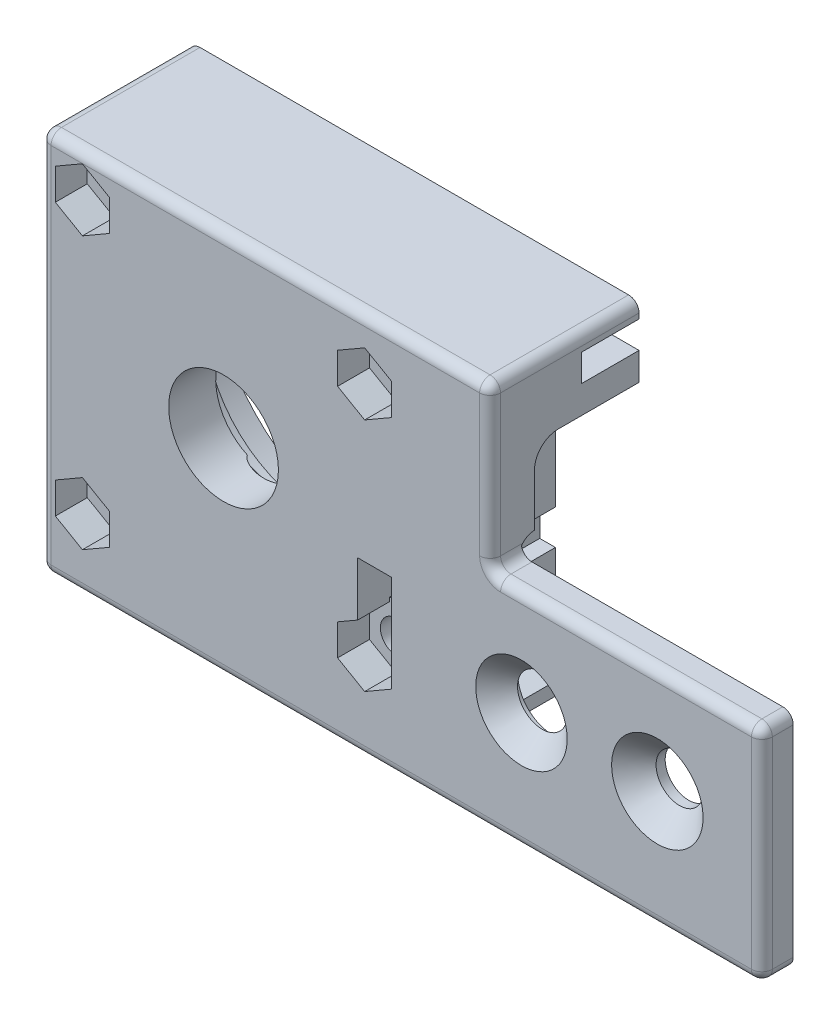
ISO-10303-21;
HEADER;
FILE_DESCRIPTION(('STEP AP214'),'2;1');
FILE_NAME('part.step','',(''),(''),'','','');
FILE_SCHEMA(('AUTOMOTIVE_DESIGN { 1 0 10303 214 1 1 1 1 }'));
ENDSEC;
DATA;
#1=APPLICATION_CONTEXT('core data for automotive mechanical design processes');
#2=APPLICATION_PROTOCOL_DEFINITION('international standard','automotive_design',2000,#1);
#3=PRODUCT_CONTEXT('',#1,'mechanical');
#4=PRODUCT('Part','Part','',(#3));
#5=PRODUCT_RELATED_PRODUCT_CATEGORY('part','',(#4));
#6=PRODUCT_DEFINITION_FORMATION('','',#4);
#7=PRODUCT_DEFINITION_CONTEXT('part definition',#1,'design');
#8=PRODUCT_DEFINITION('design','',#6,#7);
#9=PRODUCT_DEFINITION_SHAPE('','',#8);
#10=(LENGTH_UNIT() NAMED_UNIT(*) SI_UNIT(.MILLI.,.METRE.));
#11=(NAMED_UNIT(*) PLANE_ANGLE_UNIT() SI_UNIT($,.RADIAN.));
#12=(NAMED_UNIT(*) SI_UNIT($,.STERADIAN.) SOLID_ANGLE_UNIT());
#13=UNCERTAINTY_MEASURE_WITH_UNIT(LENGTH_MEASURE(1.E-05),#10,'distance_accuracy_value','');
#14=(GEOMETRIC_REPRESENTATION_CONTEXT(3) GLOBAL_UNCERTAINTY_ASSIGNED_CONTEXT((#13)) GLOBAL_UNIT_ASSIGNED_CONTEXT((#10,
#11,#12)) REPRESENTATION_CONTEXT('',''));
#15=CARTESIAN_POINT('',(0.,0.,0.));
#16=DIRECTION('',(0.,0.,1.));
#17=DIRECTION('',(1.,0.,0.));
#18=AXIS2_PLACEMENT_3D('',#15,#16,#17);
#19=CARTESIAN_POINT('',(0.,0.,17.5));
#20=DIRECTION('',(0.,0.,1.));
#21=DIRECTION('',(1.,0.,0.));
#22=AXIS2_PLACEMENT_3D('',#19,#20,#21);
#23=PLANE('',#22);
#24=CARTESIAN_POINT('',(0.,0.,17.5));
#25=DIRECTION('',(0.,0.,1.));
#26=DIRECTION('',(1.,0.,0.));
#27=AXIS2_PLACEMENT_3D('',#24,#25,#26);
#28=CIRCLE('',#27,14.3);
#29=CARTESIAN_POINT('',(11.8313534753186,-8.03175416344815,17.5));
#30=VERTEX_POINT('',#29);
#31=CARTESIAN_POINT('',(-10.1205648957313,-10.1026811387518,17.5));
#32=VERTEX_POINT('',#31);
#33=EDGE_CURVE('E1434',#30,#32,#28,.T.);
#34=ORIENTED_EDGE('',*,*,#33,.T.);
#35=DIRECTION('',(-1.,0.,0.));
#36=VECTOR('',#35,1.);
#37=CARTESIAN_POINT('',(-35.,-10.1026811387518,17.5));
#38=LINE('',#37,#36);
#39=CARTESIAN_POINT('',(-14.2893608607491,-10.1026811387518,17.5));
#40=VERTEX_POINT('',#39);
#41=EDGE_CURVE('E857',#32,#40,#38,.T.);
#42=ORIENTED_EDGE('',*,*,#41,.T.);
#43=CARTESIAN_POINT('',(0.,0.,17.5));
#44=DIRECTION('',(0.,0.,1.));
#45=DIRECTION('',(1.,0.,0.));
#46=AXIS2_PLACEMENT_3D('',#43,#44,#45);
#47=CIRCLE('',#46,17.5);
#48=CARTESIAN_POINT('',(15.5480199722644,-8.03175416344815,17.5));
#49=VERTEX_POINT('',#48);
#50=EDGE_CURVE('E1001',#49,#40,#47,.T.);
#51=ORIENTED_EDGE('',*,*,#50,.F.);
#52=DIRECTION('',(1.,0.,0.));
#53=VECTOR('',#52,1.);
#54=CARTESIAN_POINT('',(10.,-8.03175416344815,17.5));
#55=LINE('',#54,#53);
#56=EDGE_CURVE('E1159',#49,#30,#55,.F.);
#57=ORIENTED_EDGE('',*,*,#56,.T.);
#58=EDGE_LOOP('',(#34,#42,#51,#57));
#59=FACE_BOUND('',#58,.T.);
#60=ADVANCED_FACE('F30',(#59),#23,.F.);
#61=CARTESIAN_POINT('',(0.,0.,17.));
#62=DIRECTION('',(0.,0.,1.));
#63=DIRECTION('',(1.,0.,0.));
#64=AXIS2_PLACEMENT_3D('',#61,#62,#63);
#65=PLANE('',#64);
#66=CARTESIAN_POINT('',(0.,0.,17.));
#67=DIRECTION('',(0.,0.,1.));
#68=DIRECTION('',(1.,0.,0.));
#69=AXIS2_PLACEMENT_3D('',#66,#67,#68);
#70=CIRCLE('',#69,17.5);
#71=CARTESIAN_POINT('',(-13.5700957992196,-11.0500000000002,17.));
#72=VERTEX_POINT('',#71);
#73=CARTESIAN_POINT('',(15.5480199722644,-8.03175416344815,17.));
#74=VERTEX_POINT('',#73);
#75=EDGE_CURVE('E1155',#72,#74,#70,.F.);
#76=ORIENTED_EDGE('',*,*,#75,.F.);
#77=DIRECTION('',(-1.,0.,0.));
#78=VECTOR('',#77,1.);
#79=CARTESIAN_POINT('',(-35.,-11.0500000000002,17.));
#80=LINE('',#79,#78);
#81=CARTESIAN_POINT('',(-17.8577014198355,-11.0500000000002,17.));
#82=VERTEX_POINT('',#81);
#83=EDGE_CURVE('E1109',#72,#82,#80,.T.);
#84=ORIENTED_EDGE('',*,*,#83,.T.);
#85=CARTESIAN_POINT('',(0.,0.,17.));
#86=DIRECTION('',(0.,0.,1.));
#87=DIRECTION('',(1.,0.,0.));
#88=AXIS2_PLACEMENT_3D('',#85,#86,#87);
#89=CIRCLE('',#88,21.);
#90=CARTESIAN_POINT('',(19.4033740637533,-8.03175416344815,17.));
#91=VERTEX_POINT('',#90);
#92=EDGE_CURVE('E1406',#82,#91,#89,.F.);
#93=ORIENTED_EDGE('',*,*,#92,.T.);
#94=DIRECTION('',(1.,0.,0.));
#95=VECTOR('',#94,1.);
#96=CARTESIAN_POINT('',(10.,-8.03175416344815,17.));
#97=LINE('',#96,#95);
#98=EDGE_CURVE('E1162',#91,#74,#97,.F.);
#99=ORIENTED_EDGE('',*,*,#98,.T.);
#100=EDGE_LOOP('',(#76,#84,#93,#99));
#101=FACE_BOUND('',#100,.T.);
#102=ADVANCED_FACE('F959',(#101),#65,.F.);
#103=CARTESIAN_POINT('',(0.,0.,0.));
#104=DIRECTION('',(0.,0.,1.));
#105=DIRECTION('',(1.,0.,0.));
#106=AXIS2_PLACEMENT_3D('',#103,#104,#105);
#107=CYLINDRICAL_SURFACE('',#106,17.5);
#108=CARTESIAN_POINT('',(10.,-14.3614066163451,17.));
#109=VERTEX_POINT('',#108);
#110=CARTESIAN_POINT('',(-12.7846587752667,-11.9499999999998,17.));
#111=VERTEX_POINT('',#110);
#112=EDGE_CURVE('E1007',#109,#111,#70,.F.);
#113=ORIENTED_EDGE('',*,*,#112,.T.);
#114=CARTESIAN_POINT('',(-12.7846587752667,-11.9499999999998,17.));
#115=CARTESIAN_POINT('',(-12.7259514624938,-12.01281377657,17.0141443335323));
#116=CARTESIAN_POINT('',(-12.6671004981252,-12.0748415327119,17.0311989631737));
#117=CARTESIAN_POINT('',(-12.5494083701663,-12.1971110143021,17.0710918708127));
#118=CARTESIAN_POINT('',(-12.4905672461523,-12.2573513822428,17.0939344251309));
#119=CARTESIAN_POINT('',(-12.3741413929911,-12.3748686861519,17.1449675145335));
#120=CARTESIAN_POINT('',(-12.3165509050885,-12.4321761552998,17.1730745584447));
#121=CARTESIAN_POINT('',(-12.2021591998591,-12.544470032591,17.234868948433));
#122=CARTESIAN_POINT('',(-12.1453575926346,-12.5994576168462,17.2685534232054));
#123=CARTESIAN_POINT('',(-12.0448752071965,-12.6954610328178,17.3338685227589));
#124=CARTESIAN_POINT('',(-12.0009638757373,-12.7369690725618,17.3644226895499));
#125=CARTESIAN_POINT('',(-11.9139178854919,-12.8184301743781,17.429343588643));
#126=CARTESIAN_POINT('',(-11.8707892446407,-12.8583727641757,17.4637315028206));
#127=CARTESIAN_POINT('',(-11.8283205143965,-12.8973188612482,17.5));
#128=B_SPLINE_CURVE_WITH_KNOTS('',3,(#114,#115,#116,#117,#118,#119,#120,#121,#122,#123,#124,
#125,#126,#127),.UNSPECIFIED.,.F.,.F.,(4,2,2,2,2,2,4),(0.,0.261351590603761,0.522896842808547,
0.780599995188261,1.0381708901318,1.24117976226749,1.4453717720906),.UNSPECIFIED.);
#129=CARTESIAN_POINT('',(-11.8283205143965,-12.8973188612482,17.5));
#130=VERTEX_POINT('',#129);
#131=EDGE_CURVE('E1088',#111,#130,#128,.T.);
#132=ORIENTED_EDGE('',*,*,#131,.T.);
#133=CARTESIAN_POINT('',(10.,-14.3614066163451,17.5));
#134=VERTEX_POINT('',#133);
#135=EDGE_CURVE('E771',#130,#134,#47,.T.);
#136=ORIENTED_EDGE('',*,*,#135,.T.);
#137=DIRECTION('',(0.,0.,1.));
#138=VECTOR('',#137,1.);
#139=CARTESIAN_POINT('',(10.,-14.3614066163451,0.));
#140=LINE('',#139,#138);
#141=EDGE_CURVE('E794',#109,#134,#140,.T.);
#142=ORIENTED_EDGE('',*,*,#141,.F.);
#143=EDGE_LOOP('',(#113,#132,#136,#142));
#144=FACE_BOUND('',#143,.T.);
#145=ADVANCED_FACE('F966',(#144),#107,.F.);
#146=CARTESIAN_POINT('',(0.,0.,19.5));
#147=DIRECTION('',(0.,0.,1.));
#148=DIRECTION('',(1.,0.,0.));
#149=AXIS2_PLACEMENT_3D('',#146,#147,#148);
#150=PLANE('',#149);
#151=DIRECTION('',(0.,1.,0.));
#152=VECTOR('',#151,1.);
#153=CARTESIAN_POINT('',(10.,0.,19.5));
#154=LINE('',#153,#152);
#155=CARTESIAN_POINT('',(10.,-9.51191046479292,19.5));
#156=VERTEX_POINT('',#155);
#157=CARTESIAN_POINT('',(10.,-8.2886918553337,19.5));
#158=VERTEX_POINT('',#157);
#159=EDGE_CURVE('E915',#156,#158,#154,.T.);
#160=ORIENTED_EDGE('',*,*,#159,.F.);
#161=DIRECTION('',(-1.,0.,0.));
#162=VECTOR('',#161,1.);
#163=CARTESIAN_POINT('',(-35.,-9.51191046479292,19.5));
#164=LINE('',#163,#162);
#165=CARTESIAN_POINT('',(4.4467470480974,-9.51191046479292,19.5));
#166=VERTEX_POINT('',#165);
#167=EDGE_CURVE('E3337',#156,#166,#164,.T.);
#168=ORIENTED_EDGE('',*,*,#167,.T.);
#169=CARTESIAN_POINT('',(0.,0.,19.5));
#170=DIRECTION('',(0.,0.,1.));
#171=DIRECTION('',(1.,0.,0.));
#172=AXIS2_PLACEMENT_3D('',#169,#170,#171);
#173=CIRCLE('',#172,10.5);
#174=CARTESIAN_POINT('',(-4.4467470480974,-9.51191046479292,19.5));
#175=VERTEX_POINT('',#174);
#176=EDGE_CURVE('E881',#166,#175,#173,.T.);
#177=ORIENTED_EDGE('',*,*,#176,.T.);
#178=CARTESIAN_POINT('',(-10.6777132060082,-9.51191046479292,19.5));
#179=VERTEX_POINT('',#178);
#180=EDGE_CURVE('E1108',#175,#179,#164,.T.);
#181=ORIENTED_EDGE('',*,*,#180,.T.);
#182=CARTESIAN_POINT('',(0.,0.,19.5));
#183=DIRECTION('',(0.,0.,1.));
#184=DIRECTION('',(1.,0.,0.));
#185=AXIS2_PLACEMENT_3D('',#182,#183,#184);
#186=CIRCLE('',#185,14.3);
#187=CARTESIAN_POINT('',(11.6527931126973,-8.2886918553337,19.5));
#188=VERTEX_POINT('',#187);
#189=EDGE_CURVE('E912',#188,#179,#186,.T.);
#190=ORIENTED_EDGE('',*,*,#189,.F.);
#191=DIRECTION('',(1.,0.,0.));
#192=VECTOR('',#191,1.);
#193=CARTESIAN_POINT('',(0.,-8.28869185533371,19.5));
#194=LINE('',#193,#192);
#195=EDGE_CURVE('E1886',#158,#188,#194,.T.);
#196=ORIENTED_EDGE('',*,*,#195,.F.);
#197=EDGE_LOOP('',(#160,#168,#177,#181,#190,#196));
#198=FACE_BOUND('',#197,.T.);
#199=ADVANCED_FACE('F2677',(#198),#150,.F.);
#200=CARTESIAN_POINT('',(0.,0.,0.));
#201=DIRECTION('',(0.,0.,1.));
#202=DIRECTION('',(1.,0.,0.));
#203=AXIS2_PLACEMENT_3D('',#200,#201,#202);
#204=CYLINDRICAL_SURFACE('',#203,14.3);
#205=CARTESIAN_POINT('',(-6.17650112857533,-12.8973188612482,17.5));
#206=VERTEX_POINT('',#205);
#207=CARTESIAN_POINT('',(6.17650112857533,-12.8973188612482,17.5));
#208=VERTEX_POINT('',#207);
#209=EDGE_CURVE('E1208',#206,#208,#28,.T.);
#210=ORIENTED_EDGE('',*,*,#209,.F.);
#211=CARTESIAN_POINT('',(-6.17650112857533,-12.8973188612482,17.5));
#212=CARTESIAN_POINT('',(-6.09449149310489,-12.9365996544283,17.5366367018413));
#213=CARTESIAN_POINT('',(-6.01272140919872,-12.9747911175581,17.5750567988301));
#214=CARTESIAN_POINT('',(-5.84995523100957,-13.048984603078,17.6560480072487));
#215=CARTESIAN_POINT('',(-5.76896161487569,-13.0849808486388,17.6986293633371));
#216=CARTESIAN_POINT('',(-5.60800805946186,-13.1547707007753,17.7886012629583));
#217=CARTESIAN_POINT('',(-5.52805657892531,-13.1885506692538,17.8360176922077));
#218=CARTESIAN_POINT('',(-5.37060062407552,-13.2534475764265,17.9362821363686));
#219=CARTESIAN_POINT('',(-5.2930934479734,-13.2845675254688,17.9891238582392));
#220=CARTESIAN_POINT('',(-5.16504195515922,-13.3347489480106,18.0844987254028));
#221=CARTESIAN_POINT('',(-5.11348762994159,-13.3545921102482,18.1252565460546));
#222=CARTESIAN_POINT('',(-5.013092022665,-13.3926018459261,18.2108511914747));
#223=CARTESIAN_POINT('',(-4.96425296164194,-13.4107670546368,18.255691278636));
#224=CARTESIAN_POINT('',(-4.87037557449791,-13.4451462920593,18.3507763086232));
#225=CARTESIAN_POINT('',(-4.82537425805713,-13.4613418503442,18.4010651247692));
#226=CARTESIAN_POINT('',(-4.74231368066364,-13.4908259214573,18.5078941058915));
#227=CARTESIAN_POINT('',(-4.70423517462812,-13.5041225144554,18.5644162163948));
#228=CARTESIAN_POINT('',(-4.65239338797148,-13.5220439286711,18.6606113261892));
#229=CARTESIAN_POINT('',(-4.63498369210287,-13.5280141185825,18.6980404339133));
#230=CARTESIAN_POINT('',(-4.6056912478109,-13.5380148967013,18.7752641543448));
#231=CARTESIAN_POINT('',(-4.59380186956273,-13.5420478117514,18.81505586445));
#232=CARTESIAN_POINT('',(-4.57678749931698,-13.5478080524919,18.8967097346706));
#233=CARTESIAN_POINT('',(-4.57173386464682,-13.5495110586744,18.9385890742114));
#234=CARTESIAN_POINT('',(-4.56938051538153,-13.5503049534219,19.0225693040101));
#235=CARTESIAN_POINT('',(-4.57207448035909,-13.5493979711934,19.0646699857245));
#236=CARTESIAN_POINT('',(-4.58408115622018,-13.5453398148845,19.1430347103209));
#237=CARTESIAN_POINT('',(-4.59263945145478,-13.5424443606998,19.1794343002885));
#238=CARTESIAN_POINT('',(-4.61470445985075,-13.5349413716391,19.250595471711));
#239=CARTESIAN_POINT('',(-4.62822515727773,-13.5303289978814,19.2853521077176));
#240=CARTESIAN_POINT('',(-4.65843867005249,-13.5199552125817,19.3512011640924));
#241=CARTESIAN_POINT('',(-4.67495082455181,-13.5142586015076,19.3823891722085));
#242=CARTESIAN_POINT('',(-4.71061919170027,-13.5018676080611,19.4426747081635));
#243=CARTESIAN_POINT('',(-4.72975343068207,-13.495181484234,19.4717868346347));
#244=CARTESIAN_POINT('',(-4.74988849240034,-13.4880895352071,19.5));
#245=B_SPLINE_CURVE_WITH_KNOTS('',3,(#211,#212,#213,#214,#215,#216,#217,#218,#219,#220,#221,
#222,#223,#224,#225,#226,#227,#228,#229,#230,#231,#232,#233,#234,#235,#236,#237,#238,#239,#240,
#241,#242,#243,#244),.UNSPECIFIED.,.F.,.F.,(4,2,2,2,2,2,2,2,2,2,2,2,2,2,2,2,4),(0.,
0.2941263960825,0.588996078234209,0.885536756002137,1.18173726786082,1.38754477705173,
1.59351822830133,1.80129456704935,2.00848415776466,2.13323799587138,2.25784161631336,
2.38373616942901,2.50952804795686,2.62159176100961,2.73397373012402,2.84103069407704,
2.94723987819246),.UNSPECIFIED.);
#246=CARTESIAN_POINT('',(-4.74988849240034,-13.4880895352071,19.5));
#247=VERTEX_POINT('',#246);
#248=EDGE_CURVE('E11',#206,#247,#245,.T.);
#249=ORIENTED_EDGE('',*,*,#248,.T.);
#250=CARTESIAN_POINT('',(4.74988849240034,-13.4880895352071,19.5));
#251=VERTEX_POINT('',#250);
#252=EDGE_CURVE('E916',#247,#251,#186,.T.);
#253=ORIENTED_EDGE('',*,*,#252,.T.);
#254=CARTESIAN_POINT('',(4.74988849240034,-13.4880895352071,19.5));
#255=CARTESIAN_POINT('',(4.72310459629,-13.4975252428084,19.4624808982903));
#256=CARTESIAN_POINT('',(4.69802528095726,-13.5062630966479,19.4232444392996));
#257=CARTESIAN_POINT('',(4.6529197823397,-13.5218671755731,19.3410636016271));
#258=CARTESIAN_POINT('',(4.63295423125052,-13.5287110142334,19.298082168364));
#259=CARTESIAN_POINT('',(4.60325427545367,-13.53884259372,19.2167685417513));
#260=CARTESIAN_POINT('',(4.59234269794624,-13.542542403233,19.1789331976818));
#261=CARTESIAN_POINT('',(4.57674836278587,-13.5478206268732,19.1020122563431));
#262=CARTESIAN_POINT('',(4.57203515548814,-13.5494094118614,19.0629337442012));
#263=CARTESIAN_POINT('',(4.56934125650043,-13.5503182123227,18.9843253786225));
#264=CARTESIAN_POINT('',(4.5713919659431,-13.549627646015,18.9447942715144));
#265=CARTESIAN_POINT('',(4.58202375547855,-13.5460358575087,18.8666838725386));
#266=CARTESIAN_POINT('',(4.59061760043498,-13.5431303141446,18.8281065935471));
#267=CARTESIAN_POINT('',(4.61657234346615,-13.5343079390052,18.7422279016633));
#268=CARTESIAN_POINT('',(4.63572438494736,-13.5277721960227,18.6955416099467));
#269=CARTESIAN_POINT('',(4.68066459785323,-13.5122887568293,18.6059546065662));
#270=CARTESIAN_POINT('',(4.7064663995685,-13.5033361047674,18.5630619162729));
#271=CARTESIAN_POINT('',(4.78473983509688,-13.4758690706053,18.4484744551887));
#272=CARTESIAN_POINT('',(4.84220334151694,-13.4553799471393,18.3807244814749));
#273=CARTESIAN_POINT('',(4.96506506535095,-13.410536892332,18.253740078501));
#274=CARTESIAN_POINT('',(5.03052321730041,-13.3861532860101,18.1945782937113));
#275=CARTESIAN_POINT('',(5.18266236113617,-13.328096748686,18.0691672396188));
#276=CARTESIAN_POINT('',(5.27057727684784,-13.2936206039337,18.0048056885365));
#277=CARTESIAN_POINT('',(5.45030949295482,-13.220952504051,17.8838497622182));
#278=CARTESIAN_POINT('',(5.54213495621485,-13.1827525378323,17.8272727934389));
#279=CARTESIAN_POINT('',(5.72400263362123,-13.1047761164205,17.7227957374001));
#280=CARTESIAN_POINT('',(5.81395080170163,-13.0651388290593,17.6746265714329));
#281=CARTESIAN_POINT('',(5.94958277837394,-13.003650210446,17.6062760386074));
#282=CARTESIAN_POINT('',(5.99480606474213,-12.9828657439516,17.5841897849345));
#283=CARTESIAN_POINT('',(6.08548942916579,-12.9406074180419,17.5412137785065));
#284=CARTESIAN_POINT('',(6.13094947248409,-12.9191336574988,17.5203238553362));
#285=CARTESIAN_POINT('',(6.17650112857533,-12.8973188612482,17.5));
#286=B_SPLINE_CURVE_WITH_KNOTS('',3,(#254,#255,#256,#257,#258,#259,#260,#261,#262,#263,#264,
#265,#266,#267,#268,#269,#270,#271,#272,#273,#274,#275,#276,#277,#278,#279,#280,#281,#282,#283,
#284,#285),.UNSPECIFIED.,.F.,.F.,(4,2,2,2,2,2,2,2,2,2,2,2,2,2,2,4),(0.,0.141507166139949,
0.284621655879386,0.402771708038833,0.520339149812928,0.638453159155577,0.756798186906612,
0.908584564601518,1.06068457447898,1.33266635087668,1.60682919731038,1.94906723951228,
2.29205850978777,2.62024851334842,2.78358788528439,2.94690393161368),.UNSPECIFIED.);
#287=EDGE_CURVE('E1064',#251,#208,#286,.T.);
#288=ORIENTED_EDGE('',*,*,#287,.T.);
#289=EDGE_LOOP('',(#210,#249,#253,#288));
#290=FACE_BOUND('',#289,.T.);
#291=ADVANCED_FACE('F2736',(#290),#204,.F.);
#292=CARTESIAN_POINT('',(9.08050895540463,21.9222878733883,18.5));
#293=DIRECTION('',(0.,0.,1.));
#294=DIRECTION('',(1.,0.,0.));
#295=AXIS2_PLACEMENT_3D('',#292,#293,#294);
#296=PLANE('',#295);
#297=CARTESIAN_POINT('',(0.,0.,18.5));
#298=DIRECTION('',(0.,0.,1.));
#299=DIRECTION('',(1.,0.,0.));
#300=AXIS2_PLACEMENT_3D('',#297,#298,#299);
#301=CIRCLE('',#300,22.5);
#302=CARTESIAN_POINT('',(-3.86852510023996,22.1649388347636,18.5));
#303=VERTEX_POINT('',#302);
#304=CARTESIAN_POINT('',(18.4084388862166,12.9375182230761,18.5));
#305=VERTEX_POINT('',#304);
#306=EDGE_CURVE('E723',#303,#305,#301,.F.);
#307=ORIENTED_EDGE('',*,*,#306,.F.);
#308=DIRECTION('',(0.258819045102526,-0.965925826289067,0.));
#309=VECTOR('',#308,1.);
#310=CARTESIAN_POINT('',(-3.86852510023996,22.1649388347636,18.5));
#311=LINE('',#310,#309);
#312=CARTESIAN_POINT('',(-5.42630597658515,27.9786562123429,18.5));
#313=VERTEX_POINT('',#312);
#314=EDGE_CURVE('E758',#303,#313,#311,.F.);
#315=ORIENTED_EDGE('',*,*,#314,.T.);
#316=CARTESIAN_POINT('',(0.,0.,18.5));
#317=DIRECTION('',(0.,0.,1.));
#318=DIRECTION('',(1.,0.,0.));
#319=AXIS2_PLACEMENT_3D('',#316,#317,#318);
#320=CIRCLE('',#319,28.5);
#321=CARTESIAN_POINT('',(23.6208752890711,15.9469197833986,18.5));
#322=VERTEX_POINT('',#321);
#323=EDGE_CURVE('E739',#313,#322,#320,.F.);
#324=ORIENTED_EDGE('',*,*,#323,.T.);
#325=DIRECTION('',(0.866025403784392,0.50000000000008,0.));
#326=VECTOR('',#325,1.);
#327=CARTESIAN_POINT('',(23.6208752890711,15.9469197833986,18.5));
#328=LINE('',#327,#326);
#329=EDGE_CURVE('E736',#322,#305,#328,.F.);
#330=ORIENTED_EDGE('',*,*,#329,.T.);
#331=EDGE_LOOP('',(#307,#315,#324,#330));
#332=FACE_BOUND('',#331,.T.);
#333=ADVANCED_FACE('F737',(#332),#296,.F.);
#334=CARTESIAN_POINT('',(-21.3834047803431,-7.00000000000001,18.5));
#335=DIRECTION('',(0.,1.,0.));
#336=DIRECTION('',(0.,0.,1.));
#337=AXIS2_PLACEMENT_3D('',#334,#335,#336);
#338=PLANE('',#337);
#339=DIRECTION('',(1.,0.,0.));
#340=VECTOR('',#339,1.);
#341=CARTESIAN_POINT('',(-18.8250953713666,-7.00000000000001,18.5));
#342=LINE('',#341,#340);
#343=CARTESIAN_POINT('',(-27.6269795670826,-7.,18.5));
#344=VERTEX_POINT('',#343);
#345=CARTESIAN_POINT('',(-21.3834047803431,-7.,18.5));
#346=VERTEX_POINT('',#345);
#347=EDGE_CURVE('E843',#344,#346,#342,.T.);
#348=ORIENTED_EDGE('',*,*,#347,.T.);
#349=DIRECTION('',(0.,0.,1.));
#350=VECTOR('',#349,1.);
#351=CARTESIAN_POINT('',(-21.3834047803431,-7.,11.));
#352=LINE('',#351,#350);
#353=CARTESIAN_POINT('',(-21.3834047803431,-7.,14.5));
#354=VERTEX_POINT('',#353);
#355=EDGE_CURVE('E849',#354,#346,#352,.T.);
#356=ORIENTED_EDGE('',*,*,#355,.F.);
#357=DIRECTION('',(1.,0.,0.));
#358=VECTOR('',#357,1.);
#359=CARTESIAN_POINT('',(-22.0873020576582,-7.00000000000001,14.5));
#360=LINE('',#359,#358);
#361=CARTESIAN_POINT('',(-27.6269795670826,-7.,14.5));
#362=VERTEX_POINT('',#361);
#363=EDGE_CURVE('E834',#354,#362,#360,.F.);
#364=ORIENTED_EDGE('',*,*,#363,.T.);
#365=DIRECTION('',(0.,0.,1.));
#366=VECTOR('',#365,1.);
#367=CARTESIAN_POINT('',(-27.6269795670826,-7.,11.));
#368=LINE('',#367,#366);
#369=EDGE_CURVE('E862',#362,#344,#368,.T.);
#370=ORIENTED_EDGE('',*,*,#369,.T.);
#371=EDGE_LOOP('',(#348,#356,#364,#370));
#372=FACE_BOUND('',#371,.T.);
#373=ADVANCED_FACE('F1350',(#372),#338,.T.);
#374=CARTESIAN_POINT('',(-18.8250953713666,-14.4450037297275,18.5));
#375=DIRECTION('',(0.,0.,1.));
#376=DIRECTION('',(1.,0.,0.));
#377=AXIS2_PLACEMENT_3D('',#374,#375,#376);
#378=PLANE('',#377);
#379=CARTESIAN_POINT('',(0.,0.,18.5));
#380=DIRECTION('',(0.,0.,1.));
#381=DIRECTION('',(1.,0.,0.));
#382=AXIS2_PLACEMENT_3D('',#379,#380,#381);
#383=CIRCLE('',#382,28.5);
#384=CARTESIAN_POINT('',(-28.429737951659,-2.,18.5));
#385=VERTEX_POINT('',#384);
#386=EDGE_CURVE('E743',#344,#385,#383,.F.);
#387=ORIENTED_EDGE('',*,*,#386,.T.);
#388=DIRECTION('',(1.,0.,0.));
#389=VECTOR('',#388,1.);
#390=CARTESIAN_POINT('',(-28.429737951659,-2.,18.5));
#391=LINE('',#390,#389);
#392=CARTESIAN_POINT('',(-22.410934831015,-2.,18.5));
#393=VERTEX_POINT('',#392);
#394=EDGE_CURVE('E853',#385,#393,#391,.T.);
#395=ORIENTED_EDGE('',*,*,#394,.T.);
#396=CARTESIAN_POINT('',(0.,0.,18.5));
#397=DIRECTION('',(0.,0.,1.));
#398=DIRECTION('',(1.,0.,0.));
#399=AXIS2_PLACEMENT_3D('',#396,#397,#398);
#400=CIRCLE('',#399,22.5);
#401=EDGE_CURVE('E852',#346,#393,#400,.F.);
#402=ORIENTED_EDGE('',*,*,#401,.F.);
#403=ORIENTED_EDGE('',*,*,#347,.F.);
#404=EDGE_LOOP('',(#387,#395,#402,#403));
#405=FACE_BOUND('',#404,.T.);
#406=ADVANCED_FACE('F1348',(#405),#378,.F.);
#407=CARTESIAN_POINT('',(-23.5849528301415,-16.,18.5));
#408=DIRECTION('',(0.,-1.,0.));
#409=DIRECTION('',(0.,0.,-1.));
#410=AXIS2_PLACEMENT_3D('',#407,#408,#409);
#411=PLANE('',#410);
#412=DIRECTION('',(1.,0.,0.));
#413=VECTOR('',#412,1.);
#414=CARTESIAN_POINT('',(-18.8250953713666,-16.,18.5));
#415=LINE('',#414,#413);
#416=CARTESIAN_POINT('',(-15.8192920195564,-16.,18.5));
#417=VERTEX_POINT('',#416);
#418=CARTESIAN_POINT('',(-23.5849528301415,-16.,18.5));
#419=VERTEX_POINT('',#418);
#420=EDGE_CURVE('E797',#417,#419,#415,.F.);
#421=ORIENTED_EDGE('',*,*,#420,.T.);
#422=DIRECTION('',(0.,0.,1.));
#423=VECTOR('',#422,1.);
#424=CARTESIAN_POINT('',(-23.5849528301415,-16.,11.));
#425=LINE('',#424,#423);
#426=CARTESIAN_POINT('',(-23.5849528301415,-16.,14.5));
#427=VERTEX_POINT('',#426);
#428=EDGE_CURVE('E858',#419,#427,#425,.F.);
#429=ORIENTED_EDGE('',*,*,#428,.T.);
#430=DIRECTION('',(1.,0.,0.));
#431=VECTOR('',#430,1.);
#432=CARTESIAN_POINT('',(-22.0873020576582,-16.,14.5));
#433=LINE('',#432,#431);
#434=CARTESIAN_POINT('',(-15.8192920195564,-16.,14.5));
#435=VERTEX_POINT('',#434);
#436=EDGE_CURVE('E841',#427,#435,#433,.T.);
#437=ORIENTED_EDGE('',*,*,#436,.T.);
#438=DIRECTION('',(0.,0.,1.));
#439=VECTOR('',#438,1.);
#440=CARTESIAN_POINT('',(-15.8192920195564,-16.,11.));
#441=LINE('',#440,#439);
#442=EDGE_CURVE('E844',#417,#435,#441,.F.);
#443=ORIENTED_EDGE('',*,*,#442,.F.);
#444=EDGE_LOOP('',(#421,#429,#437,#443));
#445=FACE_BOUND('',#444,.T.);
#446=ADVANCED_FACE('F1359',(#445),#411,.T.);
#447=CARTESIAN_POINT('',(-22.0873020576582,-11.7895842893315,14.5));
#448=DIRECTION('',(0.,0.,1.));
#449=DIRECTION('',(1.,0.,0.));
#450=AXIS2_PLACEMENT_3D('',#447,#448,#449);
#451=PLANE('',#450);
#452=CARTESIAN_POINT('',(0.,0.,14.5));
#453=DIRECTION('',(0.,0.,1.));
#454=DIRECTION('',(1.,0.,0.));
#455=AXIS2_PLACEMENT_3D('',#452,#453,#454);
#456=CIRCLE('',#455,22.5);
#457=EDGE_CURVE('E847',#435,#354,#456,.F.);
#458=ORIENTED_EDGE('',*,*,#457,.F.);
#459=ORIENTED_EDGE('',*,*,#436,.F.);
#460=CARTESIAN_POINT('',(0.,0.,14.5));
#461=DIRECTION('',(0.,0.,1.));
#462=DIRECTION('',(1.,0.,0.));
#463=AXIS2_PLACEMENT_3D('',#460,#461,#462);
#464=CIRCLE('',#463,28.5);
#465=EDGE_CURVE('E860',#427,#362,#464,.F.);
#466=ORIENTED_EDGE('',*,*,#465,.T.);
#467=ORIENTED_EDGE('',*,*,#363,.F.);
#468=EDGE_LOOP('',(#458,#459,#466,#467));
#469=FACE_BOUND('',#468,.T.);
#470=ADVANCED_FACE('F1356',(#469),#451,.F.);
#471=CARTESIAN_POINT('',(-18.8250953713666,-14.4450037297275,18.5));
#472=DIRECTION('',(0.,0.,1.));
#473=DIRECTION('',(1.,0.,0.));
#474=AXIS2_PLACEMENT_3D('',#471,#472,#473);
#475=PLANE('',#474);
#476=CARTESIAN_POINT('',(0.,0.,18.5));
#477=DIRECTION('',(0.,0.,1.));
#478=DIRECTION('',(1.,0.,0.));
#479=AXIS2_PLACEMENT_3D('',#476,#477,#478);
#480=CIRCLE('',#479,22.5);
#481=CARTESIAN_POINT('',(-7.73222840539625,-21.1296626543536,18.5));
#482=VERTEX_POINT('',#481);
#483=EDGE_CURVE('E848',#482,#417,#480,.F.);
#484=ORIENTED_EDGE('',*,*,#483,.F.);
#485=DIRECTION('',(0.258819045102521,0.965925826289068,0.));
#486=VECTOR('',#485,1.);
#487=CARTESIAN_POINT('',(-7.73222840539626,-21.1296626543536,18.5));
#488=LINE('',#487,#486);
#489=CARTESIAN_POINT('',(-9.29000928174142,-26.9433800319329,18.5));
#490=VERTEX_POINT('',#489);
#491=EDGE_CURVE('E835',#482,#490,#488,.F.);
#492=ORIENTED_EDGE('',*,*,#491,.T.);
#493=CARTESIAN_POINT('',(0.,0.,18.5));
#494=DIRECTION('',(0.,0.,1.));
#495=DIRECTION('',(1.,0.,0.));
#496=AXIS2_PLACEMENT_3D('',#493,#494,#495);
#497=CIRCLE('',#496,28.5);
#498=EDGE_CURVE('E861',#490,#419,#497,.F.);
#499=ORIENTED_EDGE('',*,*,#498,.T.);
#500=ORIENTED_EDGE('',*,*,#420,.F.);
#501=EDGE_LOOP('',(#484,#492,#499,#500));
#502=FACE_BOUND('',#501,.T.);
#503=ADVANCED_FACE('F1361',(#502),#475,.F.);
#504=CARTESIAN_POINT('',(-18.8250953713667,14.4450037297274,18.5));
#505=DIRECTION('',(0.,0.,1.));
#506=DIRECTION('',(1.,0.,0.));
#507=AXIS2_PLACEMENT_3D('',#504,#505,#506);
#508=PLANE('',#507);
#509=CARTESIAN_POINT('',(0.,0.,18.5));
#510=DIRECTION('',(0.,0.,1.));
#511=DIRECTION('',(1.,0.,0.));
#512=AXIS2_PLACEMENT_3D('',#509,#510,#511);
#513=CIRCLE('',#512,28.5);
#514=CARTESIAN_POINT('',(-28.429737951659,2.,18.5));
#515=VERTEX_POINT('',#514);
#516=CARTESIAN_POINT('',(-9.29000928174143,26.9433800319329,18.5));
#517=VERTEX_POINT('',#516);
#518=EDGE_CURVE('E838',#515,#517,#513,.F.);
#519=ORIENTED_EDGE('',*,*,#518,.T.);
#520=DIRECTION('',(-0.258819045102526,0.965925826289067,0.));
#521=VECTOR('',#520,1.);
#522=CARTESIAN_POINT('',(-9.29000928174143,26.9433800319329,18.5));
#523=LINE('',#522,#521);
#524=CARTESIAN_POINT('',(-7.73222840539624,21.1296626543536,18.5));
#525=VERTEX_POINT('',#524);
#526=EDGE_CURVE('E829',#517,#525,#523,.F.);
#527=ORIENTED_EDGE('',*,*,#526,.T.);
#528=CARTESIAN_POINT('',(0.,0.,18.5));
#529=DIRECTION('',(0.,0.,1.));
#530=DIRECTION('',(1.,0.,0.));
#531=AXIS2_PLACEMENT_3D('',#528,#529,#530);
#532=CIRCLE('',#531,22.5);
#533=CARTESIAN_POINT('',(-22.410934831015,2.,18.5));
#534=VERTEX_POINT('',#533);
#535=EDGE_CURVE('E831',#534,#525,#532,.F.);
#536=ORIENTED_EDGE('',*,*,#535,.F.);
#537=DIRECTION('',(1.,0.,0.));
#538=VECTOR('',#537,1.);
#539=CARTESIAN_POINT('',(-22.410934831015,2.,18.5));
#540=LINE('',#539,#538);
#541=EDGE_CURVE('E824',#534,#515,#540,.F.);
#542=ORIENTED_EDGE('',*,*,#541,.T.);
#543=EDGE_LOOP('',(#519,#527,#536,#542));
#544=FACE_BOUND('',#543,.T.);
#545=ADVANCED_FACE('F2819',(#544),#508,.F.);
#546=CARTESIAN_POINT('',(7.97284054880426,-22.9867329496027,18.5));
#547=DIRECTION('',(0.,0.,1.));
#548=DIRECTION('',(1.,0.,0.));
#549=AXIS2_PLACEMENT_3D('',#546,#547,#548);
#550=PLANE('',#549);
#551=CARTESIAN_POINT('',(0.,0.,18.5));
#552=DIRECTION('',(0.,0.,1.));
#553=DIRECTION('',(1.,0.,0.));
#554=AXIS2_PLACEMENT_3D('',#551,#552,#553);
#555=CIRCLE('',#554,28.5);
#556=CARTESIAN_POINT('',(22.312214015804,-17.7317541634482,18.5));
#557=VERTEX_POINT('',#556);
#558=CARTESIAN_POINT('',(-5.42630597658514,-27.978656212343,18.5));
#559=VERTEX_POINT('',#558);
#560=EDGE_CURVE('E827',#557,#559,#555,.F.);
#561=ORIENTED_EDGE('',*,*,#560,.T.);
#562=DIRECTION('',(-0.258819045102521,-0.965925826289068,0.));
#563=VECTOR('',#562,1.);
#564=CARTESIAN_POINT('',(-5.42630597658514,-27.978656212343,18.5));
#565=LINE('',#564,#563);
#566=CARTESIAN_POINT('',(-3.86852510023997,-22.1649388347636,18.5));
#567=VERTEX_POINT('',#566);
#568=EDGE_CURVE('E820',#559,#567,#565,.F.);
#569=ORIENTED_EDGE('',*,*,#568,.T.);
#570=CARTESIAN_POINT('',(0.,0.,18.5));
#571=DIRECTION('',(0.,0.,1.));
#572=DIRECTION('',(1.,0.,0.));
#573=AXIS2_PLACEMENT_3D('',#570,#571,#572);
#574=CIRCLE('',#573,22.5);
#575=CARTESIAN_POINT('',(13.850447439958,-17.7317541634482,18.5));
#576=VERTEX_POINT('',#575);
#577=EDGE_CURVE('E822',#576,#567,#574,.F.);
#578=ORIENTED_EDGE('',*,*,#577,.F.);
#579=DIRECTION('',(1.,0.,0.));
#580=VECTOR('',#579,1.);
#581=CARTESIAN_POINT('',(13.850447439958,-17.7317541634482,18.5));
#582=LINE('',#581,#580);
#583=EDGE_CURVE('E815',#576,#557,#582,.T.);
#584=ORIENTED_EDGE('',*,*,#583,.T.);
#585=EDGE_LOOP('',(#561,#569,#578,#584));
#586=FACE_BOUND('',#585,.T.);
#587=ADVANCED_FACE('F1524',(#586),#550,.F.);
#588=CARTESIAN_POINT('',(24.7649141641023,2.92416897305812,18.5));
#589=DIRECTION('',(0.,0.,1.));
#590=DIRECTION('',(1.,0.,0.));
#591=AXIS2_PLACEMENT_3D('',#588,#589,#590);
#592=PLANE('',#591);
#593=CARTESIAN_POINT('',(0.,0.,18.5));
#594=DIRECTION('',(0.,0.,1.));
#595=DIRECTION('',(1.,0.,0.));
#596=AXIS2_PLACEMENT_3D('',#593,#594,#595);
#597=CIRCLE('',#596,22.5);
#598=CARTESIAN_POINT('',(20.4084388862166,9.47341660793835,18.5));
#599=VERTEX_POINT('',#598);
#600=CARTESIAN_POINT('',(21.8591490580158,-5.33175416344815,18.5));
#601=VERTEX_POINT('',#600);
#602=EDGE_CURVE('E818',#599,#601,#597,.F.);
#603=ORIENTED_EDGE('',*,*,#602,.F.);
#604=DIRECTION('',(-0.866025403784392,-0.50000000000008,0.));
#605=VECTOR('',#604,1.);
#606=CARTESIAN_POINT('',(20.4084388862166,9.47341660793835,18.5));
#607=LINE('',#606,#605);
#608=CARTESIAN_POINT('',(25.6208752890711,12.4828181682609,18.5));
#609=VERTEX_POINT('',#608);
#610=EDGE_CURVE('E811',#599,#609,#607,.F.);
#611=ORIENTED_EDGE('',*,*,#610,.T.);
#612=CARTESIAN_POINT('',(0.,0.,18.5));
#613=DIRECTION('',(0.,0.,1.));
#614=DIRECTION('',(1.,0.,0.));
#615=AXIS2_PLACEMENT_3D('',#612,#613,#614);
#616=CIRCLE('',#615,28.5);
#617=CARTESIAN_POINT('',(27.9968283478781,-5.33175416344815,18.5));
#618=VERTEX_POINT('',#617);
#619=EDGE_CURVE('E1039',#609,#618,#616,.F.);
#620=ORIENTED_EDGE('',*,*,#619,.T.);
#621=DIRECTION('',(1.,0.,0.));
#622=VECTOR('',#621,1.);
#623=CARTESIAN_POINT('',(27.9968283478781,-5.33175416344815,18.5));
#624=LINE('',#623,#622);
#625=EDGE_CURVE('E766',#618,#601,#624,.F.);
#626=ORIENTED_EDGE('',*,*,#625,.T.);
#627=EDGE_LOOP('',(#603,#611,#620,#626));
#628=FACE_BOUND('',#627,.T.);
#629=ADVANCED_FACE('F1597',(#628),#592,.F.);
#630=ORIENTED_EDGE('',*,*,#50,.T.);
#631=CARTESIAN_POINT('',(-14.2893608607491,-10.1026811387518,17.5));
#632=CARTESIAN_POINT('',(-14.2550584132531,-10.1512027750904,17.4548055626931));
#633=CARTESIAN_POINT('',(-14.219275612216,-10.2012853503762,17.4125427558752));
#634=CARTESIAN_POINT('',(-14.145074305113,-10.3039250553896,17.3338400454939));
#635=CARTESIAN_POINT('',(-14.1066581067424,-10.3564800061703,17.2973951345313));
#636=CARTESIAN_POINT('',(-13.9893649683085,-10.5149716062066,17.1978999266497));
#637=CARTESIAN_POINT('',(-13.9071107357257,-10.6236334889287,17.1429750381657));
#638=CARTESIAN_POINT('',(-13.7812294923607,-10.7857360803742,17.0776354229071));
#639=CARTESIAN_POINT('',(-13.7401189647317,-10.8380644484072,17.0590260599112));
#640=CARTESIAN_POINT('',(-13.6562375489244,-10.9435711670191,17.0261829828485));
#641=CARTESIAN_POINT('',(-13.6134551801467,-10.9967529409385,17.0119894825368));
#642=CARTESIAN_POINT('',(-13.5700957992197,-11.0500000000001,16.9999999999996));
#643=B_SPLINE_CURVE_WITH_KNOTS('',3,(#631,#632,#633,#634,#635,#636,#637,#638,#639,#640,#641,
#642),.UNSPECIFIED.,.F.,.F.,(4,2,2,2,2,4),(0.,0.223742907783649,0.44729219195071,
0.885855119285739,1.09303431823,1.30204845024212),.UNSPECIFIED.);
#644=EDGE_CURVE('E1424',#40,#72,#643,.T.);
#645=ORIENTED_EDGE('',*,*,#644,.T.);
#646=ORIENTED_EDGE('',*,*,#75,.T.);
#647=DIRECTION('',(0.,0.,1.));
#648=VECTOR('',#647,1.);
#649=CARTESIAN_POINT('',(15.5480199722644,-8.03175416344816,0.));
#650=LINE('',#649,#648);
#651=EDGE_CURVE('E789',#49,#74,#650,.F.);
#652=ORIENTED_EDGE('',*,*,#651,.F.);
#653=EDGE_LOOP('',(#630,#645,#646,#652));
#654=FACE_BOUND('',#653,.T.);
#655=ADVANCED_FACE('F1420',(#654),#107,.F.);
#656=CARTESIAN_POINT('',(0.,0.,0.));
#657=DIRECTION('',(0.,0.,1.));
#658=DIRECTION('',(1.,0.,0.));
#659=AXIS2_PLACEMENT_3D('',#656,#657,#658);
#660=CYLINDRICAL_SURFACE('',#659,31.);
#661=DIRECTION('',(0.,0.,-1.));
#662=VECTOR('',#661,1.);
#663=CARTESIAN_POINT('',(0.,-31.,0.));
#664=LINE('',#663,#662);
#665=CARTESIAN_POINT('',(0.,-31.,11.));
#666=VERTEX_POINT('',#665);
#667=CARTESIAN_POINT('',(0.,-31.,0.));
#668=VERTEX_POINT('',#667);
#669=EDGE_CURVE('E787',#666,#668,#664,.T.);
#670=ORIENTED_EDGE('',*,*,#669,.T.);
#671=CARTESIAN_POINT('',(0.,0.,0.));
#672=DIRECTION('',(0.,0.,1.));
#673=DIRECTION('',(1.,0.,0.));
#674=AXIS2_PLACEMENT_3D('',#671,#672,#673);
#675=CIRCLE('',#674,31.);
#676=CARTESIAN_POINT('',(0.,31.,0.));
#677=VERTEX_POINT('',#676);
#678=EDGE_CURVE('E1030',#668,#677,#675,.F.);
#679=ORIENTED_EDGE('',*,*,#678,.T.);
#680=DIRECTION('',(0.,0.,1.));
#681=VECTOR('',#680,1.);
#682=CARTESIAN_POINT('',(0.,31.,0.));
#683=LINE('',#682,#681);
#684=CARTESIAN_POINT('',(0.,31.,11.));
#685=VERTEX_POINT('',#684);
#686=EDGE_CURVE('E762',#677,#685,#683,.T.);
#687=ORIENTED_EDGE('',*,*,#686,.T.);
#688=CARTESIAN_POINT('',(0.,0.,11.));
#689=DIRECTION('',(0.,0.,1.));
#690=DIRECTION('',(1.,0.,0.));
#691=AXIS2_PLACEMENT_3D('',#688,#689,#690);
#692=CIRCLE('',#691,31.);
#693=EDGE_CURVE('E1402',#685,#666,#692,.T.);
#694=ORIENTED_EDGE('',*,*,#693,.T.);
#695=EDGE_LOOP('',(#670,#679,#687,#694));
#696=FACE_BOUND('',#695,.T.);
#697=ADVANCED_FACE('F1590',(#696),#660,.F.);
#698=CARTESIAN_POINT('',(12.5,-31.,0.));
#699=DIRECTION('',(0.,-1.,0.));
#700=DIRECTION('',(0.,0.,-1.));
#701=AXIS2_PLACEMENT_3D('',#698,#699,#700);
#702=PLANE('',#701);
#703=DIRECTION('',(0.,0.,1.));
#704=VECTOR('',#703,1.);
#705=CARTESIAN_POINT('',(12.5,-31.,0.));
#706=LINE('',#705,#704);
#707=CARTESIAN_POINT('',(12.5,-31.,11.));
#708=VERTEX_POINT('',#707);
#709=CARTESIAN_POINT('',(12.5,-31.,0.));
#710=VERTEX_POINT('',#709);
#711=EDGE_CURVE('E768',#708,#710,#706,.F.);
#712=ORIENTED_EDGE('',*,*,#711,.T.);
#713=DIRECTION('',(1.,0.,0.));
#714=VECTOR('',#713,1.);
#715=CARTESIAN_POINT('',(30.1891252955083,-31.,0.));
#716=LINE('',#715,#714);
#717=EDGE_CURVE('E806',#710,#668,#716,.F.);
#718=ORIENTED_EDGE('',*,*,#717,.T.);
#719=ORIENTED_EDGE('',*,*,#669,.F.);
#720=DIRECTION('',(1.,0.,0.));
#721=VECTOR('',#720,1.);
#722=CARTESIAN_POINT('',(13.1576870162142,-31.,11.));
#723=LINE('',#722,#721);
#724=EDGE_CURVE('E785',#666,#708,#723,.T.);
#725=ORIENTED_EDGE('',*,*,#724,.T.);
#726=EDGE_LOOP('',(#712,#718,#719,#725));
#727=FACE_BOUND('',#726,.T.);
#728=ADVANCED_FACE('F1586',(#727),#702,.F.);
#729=CARTESIAN_POINT('',(35.,-37.,0.));
#730=DIRECTION('',(-0.257662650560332,-0.966234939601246,0.));
#731=DIRECTION('',(0.966234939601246,-0.257662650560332,0.));
#732=AXIS2_PLACEMENT_3D('',#729,#730,#731);
#733=PLANE('',#732);
#734=DIRECTION('',(0.,0.,1.));
#735=VECTOR('',#734,1.);
#736=CARTESIAN_POINT('',(35.,-37.,0.));
#737=LINE('',#736,#735);
#738=CARTESIAN_POINT('',(35.,-37.,11.));
#739=VERTEX_POINT('',#738);
#740=CARTESIAN_POINT('',(35.,-37.,0.));
#741=VERTEX_POINT('',#740);
#742=EDGE_CURVE('E778',#739,#741,#737,.F.);
#743=ORIENTED_EDGE('',*,*,#742,.T.);
#744=DIRECTION('',(-0.966234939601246,0.257662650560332,0.));
#745=VECTOR('',#744,1.);
#746=CARTESIAN_POINT('',(35.,-37.,0.));
#747=LINE('',#746,#745);
#748=EDGE_CURVE('E803',#741,#710,#747,.T.);
#749=ORIENTED_EDGE('',*,*,#748,.T.);
#750=ORIENTED_EDGE('',*,*,#711,.F.);
#751=DIRECTION('',(0.966234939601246,-0.257662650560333,0.));
#752=VECTOR('',#751,1.);
#753=CARTESIAN_POINT('',(12.5,-31.,11.));
#754=LINE('',#753,#752);
#755=EDGE_CURVE('E782',#708,#739,#754,.T.);
#756=ORIENTED_EDGE('',*,*,#755,.T.);
#757=EDGE_LOOP('',(#743,#749,#750,#756));
#758=FACE_BOUND('',#757,.T.);
#759=ADVANCED_FACE('F1582',(#758),#733,.F.);
#760=CARTESIAN_POINT('',(35.,-23.768857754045,0.));
#761=DIRECTION('',(0.,0.,1.));
#762=DIRECTION('',(1.,0.,0.));
#763=AXIS2_PLACEMENT_3D('',#760,#761,#762);
#764=CYLINDRICAL_SURFACE('',#763,5.);
#765=CARTESIAN_POINT('',(35.,-23.768857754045,0.));
#766=DIRECTION('',(0.,0.,1.));
#767=DIRECTION('',(1.,0.,0.));
#768=AXIS2_PLACEMENT_3D('',#765,#766,#767);
#769=CIRCLE('',#768,5.);
#770=CARTESIAN_POINT('',(30.0617283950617,-22.9856122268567,0.));
#771=VERTEX_POINT('',#770);
#772=CARTESIAN_POINT('',(35.,-28.768857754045,0.));
#773=VERTEX_POINT('',#772);
#774=EDGE_CURVE('E1017',#771,#773,#769,.T.);
#775=ORIENTED_EDGE('',*,*,#774,.T.);
#776=DIRECTION('',(0.,0.,1.));
#777=VECTOR('',#776,1.);
#778=CARTESIAN_POINT('',(35.,-28.768857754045,0.));
#779=LINE('',#778,#777);
#780=CARTESIAN_POINT('',(35.,-28.768857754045,11.));
#781=VERTEX_POINT('',#780);
#782=EDGE_CURVE('E776',#773,#781,#779,.T.);
#783=ORIENTED_EDGE('',*,*,#782,.T.);
#784=CARTESIAN_POINT('',(35.,-23.768857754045,11.));
#785=DIRECTION('',(0.,0.,1.));
#786=DIRECTION('',(1.,0.,0.));
#787=AXIS2_PLACEMENT_3D('',#784,#785,#786);
#788=CIRCLE('',#787,5.);
#789=CARTESIAN_POINT('',(30.0617283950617,-22.9856122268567,11.));
#790=VERTEX_POINT('',#789);
#791=EDGE_CURVE('E1400',#781,#790,#788,.F.);
#792=ORIENTED_EDGE('',*,*,#791,.T.);
#793=DIRECTION('',(0.,0.,1.));
#794=VECTOR('',#793,1.);
#795=CARTESIAN_POINT('',(30.0617283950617,-22.9856122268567,0.));
#796=LINE('',#795,#794);
#797=EDGE_CURVE('E773',#790,#771,#796,.F.);
#798=ORIENTED_EDGE('',*,*,#797,.T.);
#799=EDGE_LOOP('',(#775,#783,#792,#798));
#800=FACE_BOUND('',#799,.T.);
#801=ADVANCED_FACE('F1578',(#800),#764,.T.);
#802=CARTESIAN_POINT('',(29.4855384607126,-16.9293538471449,0.));
#803=DIRECTION('',(0.,0.,1.));
#804=DIRECTION('',(1.,0.,0.));
#805=AXIS2_PLACEMENT_3D('',#802,#803,#804);
#806=CYLINDRICAL_SURFACE('',#805,3.);
#807=CARTESIAN_POINT('',(29.4855384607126,-16.9293538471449,0.));
#808=DIRECTION('',(0.,0.,1.));
#809=DIRECTION('',(1.,0.,0.));
#810=AXIS2_PLACEMENT_3D('',#807,#808,#809);
#811=CIRCLE('',#810,3.);
#812=CARTESIAN_POINT('',(26.8838733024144,-15.4355873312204,0.));
#813=VERTEX_POINT('',#812);
#814=CARTESIAN_POINT('',(28.2631424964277,-19.6690158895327,0.));
#815=VERTEX_POINT('',#814);
#816=EDGE_CURVE('E1019',#813,#815,#811,.T.);
#817=ORIENTED_EDGE('',*,*,#816,.T.);
#818=DIRECTION('',(0.,0.,1.));
#819=VECTOR('',#818,1.);
#820=CARTESIAN_POINT('',(28.2631424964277,-19.6690158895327,0.));
#821=LINE('',#820,#819);
#822=CARTESIAN_POINT('',(28.2631424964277,-19.6690158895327,11.));
#823=VERTEX_POINT('',#822);
#824=EDGE_CURVE('E769',#815,#823,#821,.T.);
#825=ORIENTED_EDGE('',*,*,#824,.T.);
#826=CARTESIAN_POINT('',(29.4855384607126,-16.9293538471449,11.));
#827=DIRECTION('',(0.,0.,1.));
#828=DIRECTION('',(1.,0.,0.));
#829=AXIS2_PLACEMENT_3D('',#826,#827,#828);
#830=CIRCLE('',#829,3.);
#831=CARTESIAN_POINT('',(26.8838733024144,-15.4355873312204,11.));
#832=VERTEX_POINT('',#831);
#833=EDGE_CURVE('E1395',#823,#832,#830,.F.);
#834=ORIENTED_EDGE('',*,*,#833,.T.);
#835=DIRECTION('',(0.,0.,1.));
#836=VECTOR('',#835,1.);
#837=CARTESIAN_POINT('',(26.8838733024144,-15.4355873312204,0.));
#838=LINE('',#837,#836);
#839=EDGE_CURVE('E733',#832,#813,#838,.F.);
#840=ORIENTED_EDGE('',*,*,#839,.T.);
#841=EDGE_LOOP('',(#817,#825,#834,#840));
#842=FACE_BOUND('',#841,.T.);
#843=ADVANCED_FACE('F1574',(#842),#806,.T.);
#844=CARTESIAN_POINT('',(0.,0.,0.));
#845=DIRECTION('',(0.,0.,1.));
#846=DIRECTION('',(1.,0.,0.));
#847=AXIS2_PLACEMENT_3D('',#844,#845,#846);
#848=CYLINDRICAL_SURFACE('',#847,31.);
#849=DIRECTION('',(0.,0.,1.));
#850=VECTOR('',#849,1.);
#851=CARTESIAN_POINT('',(26.8838733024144,15.4355873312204,0.));
#852=LINE('',#851,#850);
#853=CARTESIAN_POINT('',(26.8838733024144,15.4355873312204,0.));
#854=VERTEX_POINT('',#853);
#855=CARTESIAN_POINT('',(26.8838733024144,15.4355873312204,11.));
#856=VERTEX_POINT('',#855);
#857=EDGE_CURVE('E763',#854,#856,#852,.T.);
#858=ORIENTED_EDGE('',*,*,#857,.F.);
#859=CARTESIAN_POINT('',(0.,0.,0.));
#860=DIRECTION('',(0.,0.,1.));
#861=DIRECTION('',(1.,0.,0.));
#862=AXIS2_PLACEMENT_3D('',#859,#860,#861);
#863=CIRCLE('',#862,31.);
#864=EDGE_CURVE('E1021',#854,#813,#863,.F.);
#865=ORIENTED_EDGE('',*,*,#864,.T.);
#866=ORIENTED_EDGE('',*,*,#839,.F.);
#867=CARTESIAN_POINT('',(0.,0.,11.));
#868=DIRECTION('',(0.,0.,1.));
#869=DIRECTION('',(1.,0.,0.));
#870=AXIS2_PLACEMENT_3D('',#867,#868,#869);
#871=CIRCLE('',#870,31.);
#872=EDGE_CURVE('E1393',#832,#856,#871,.T.);
#873=ORIENTED_EDGE('',*,*,#872,.T.);
#874=EDGE_LOOP('',(#858,#865,#866,#873));
#875=FACE_BOUND('',#874,.T.);
#876=ADVANCED_FACE('F1571',(#875),#848,.F.);
#877=CARTESIAN_POINT('',(0.,0.,11.));
#878=DIRECTION('',(0.,0.,1.));
#879=DIRECTION('',(1.,0.,0.));
#880=AXIS2_PLACEMENT_3D('',#877,#878,#879);
#881=CYLINDRICAL_SURFACE('',#880,22.5);
#882=CARTESIAN_POINT('',(0.,0.,11.));
#883=DIRECTION('',(0.,0.,1.));
#884=DIRECTION('',(1.,0.,0.));
#885=AXIS2_PLACEMENT_3D('',#882,#883,#884);
#886=CIRCLE('',#885,22.5);
#887=CARTESIAN_POINT('',(18.4084388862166,12.9375182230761,11.));
#888=VERTEX_POINT('',#887);
#889=CARTESIAN_POINT('',(-3.86852510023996,22.1649388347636,11.));
#890=VERTEX_POINT('',#889);
#891=EDGE_CURVE('E1386',#888,#890,#886,.T.);
#892=ORIENTED_EDGE('',*,*,#891,.T.);
#893=DIRECTION('',(0.,0.,1.));
#894=VECTOR('',#893,1.);
#895=CARTESIAN_POINT('',(-3.86852510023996,22.1649388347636,11.));
#896=LINE('',#895,#894);
#897=EDGE_CURVE('E730',#890,#303,#896,.T.);
#898=ORIENTED_EDGE('',*,*,#897,.T.);
#899=ORIENTED_EDGE('',*,*,#306,.T.);
#900=DIRECTION('',(0.,0.,1.));
#901=VECTOR('',#900,1.);
#902=CARTESIAN_POINT('',(18.4084388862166,12.9375182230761,11.));
#903=LINE('',#902,#901);
#904=EDGE_CURVE('E727',#305,#888,#903,.F.);
#905=ORIENTED_EDGE('',*,*,#904,.T.);
#906=EDGE_LOOP('',(#892,#898,#899,#905));
#907=FACE_BOUND('',#906,.T.);
#908=ADVANCED_FACE('F725',(#907),#881,.T.);
#909=CARTESIAN_POINT('',(-3.86852510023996,22.1649388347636,11.));
#910=DIRECTION('',(-0.965925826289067,-0.258819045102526,0.));
#911=DIRECTION('',(0.258819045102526,-0.965925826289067,0.));
#912=AXIS2_PLACEMENT_3D('',#909,#910,#911);
#913=PLANE('',#912);
#914=ORIENTED_EDGE('',*,*,#897,.F.);
#915=DIRECTION('',(-0.258819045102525,0.965925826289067,0.));
#916=VECTOR('',#915,1.);
#917=CARTESIAN_POINT('',(-3.86852510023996,22.1649388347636,11.));
#918=LINE('',#917,#916);
#919=CARTESIAN_POINT('',(-5.42630597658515,27.9786562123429,11.));
#920=VERTEX_POINT('',#919);
#921=EDGE_CURVE('E1385',#890,#920,#918,.T.);
#922=ORIENTED_EDGE('',*,*,#921,.T.);
#923=DIRECTION('',(0.,0.,1.));
#924=VECTOR('',#923,1.);
#925=CARTESIAN_POINT('',(-5.42630597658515,27.9786562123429,11.));
#926=LINE('',#925,#924);
#927=EDGE_CURVE('E752',#920,#313,#926,.T.);
#928=ORIENTED_EDGE('',*,*,#927,.T.);
#929=ORIENTED_EDGE('',*,*,#314,.F.);
#930=EDGE_LOOP('',(#914,#922,#928,#929));
#931=FACE_BOUND('',#930,.T.);
#932=ADVANCED_FACE('F1564',(#931),#913,.F.);
#933=CARTESIAN_POINT('',(0.,0.,11.));
#934=DIRECTION('',(0.,0.,1.));
#935=DIRECTION('',(1.,0.,0.));
#936=AXIS2_PLACEMENT_3D('',#933,#934,#935);
#937=CYLINDRICAL_SURFACE('',#936,28.5);
#938=ORIENTED_EDGE('',*,*,#927,.F.);
#939=CARTESIAN_POINT('',(0.,0.,11.));
#940=DIRECTION('',(0.,0.,1.));
#941=DIRECTION('',(1.,0.,0.));
#942=AXIS2_PLACEMENT_3D('',#939,#940,#941);
#943=CIRCLE('',#942,28.5);
#944=CARTESIAN_POINT('',(23.6208752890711,15.9469197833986,11.));
#945=VERTEX_POINT('',#944);
#946=EDGE_CURVE('E1379',#920,#945,#943,.F.);
#947=ORIENTED_EDGE('',*,*,#946,.T.);
#948=DIRECTION('',(0.,0.,1.));
#949=VECTOR('',#948,1.);
#950=CARTESIAN_POINT('',(23.6208752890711,15.9469197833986,11.));
#951=LINE('',#950,#949);
#952=EDGE_CURVE('E744',#945,#322,#951,.T.);
#953=ORIENTED_EDGE('',*,*,#952,.T.);
#954=ORIENTED_EDGE('',*,*,#323,.F.);
#955=EDGE_LOOP('',(#938,#947,#953,#954));
#956=FACE_BOUND('',#955,.T.);
#957=ADVANCED_FACE('F1561',(#956),#937,.F.);
#958=CARTESIAN_POINT('',(23.6208752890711,15.9469197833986,11.));
#959=DIRECTION('',(0.50000000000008,-0.866025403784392,0.));
#960=DIRECTION('',(0.866025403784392,0.50000000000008,0.));
#961=AXIS2_PLACEMENT_3D('',#958,#959,#960);
#962=PLANE('',#961);
#963=ORIENTED_EDGE('',*,*,#952,.F.);
#964=DIRECTION('',(-0.866025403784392,-0.500000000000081,0.));
#965=VECTOR('',#964,1.);
#966=CARTESIAN_POINT('',(23.6208752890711,15.9469197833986,11.));
#967=LINE('',#966,#965);
#968=EDGE_CURVE('E748',#945,#888,#967,.T.);
#969=ORIENTED_EDGE('',*,*,#968,.T.);
#970=ORIENTED_EDGE('',*,*,#904,.F.);
#971=ORIENTED_EDGE('',*,*,#329,.F.);
#972=EDGE_LOOP('',(#963,#969,#970,#971));
#973=FACE_BOUND('',#972,.T.);
#974=ADVANCED_FACE('F746',(#973),#962,.F.);
#975=CARTESIAN_POINT('',(0.,0.,11.));
#976=DIRECTION('',(0.,0.,1.));
#977=DIRECTION('',(1.,0.,0.));
#978=AXIS2_PLACEMENT_3D('',#975,#976,#977);
#979=CYLINDRICAL_SURFACE('',#978,28.5);
#980=ORIENTED_EDGE('',*,*,#465,.F.);
#981=ORIENTED_EDGE('',*,*,#428,.F.);
#982=ORIENTED_EDGE('',*,*,#498,.F.);
#983=DIRECTION('',(0.,0.,1.));
#984=VECTOR('',#983,1.);
#985=CARTESIAN_POINT('',(-9.29000928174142,-26.9433800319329,11.));
#986=LINE('',#985,#984);
#987=CARTESIAN_POINT('',(-9.29000928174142,-26.9433800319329,11.));
#988=VERTEX_POINT('',#987);
#989=EDGE_CURVE('E1053',#490,#988,#986,.F.);
#990=ORIENTED_EDGE('',*,*,#989,.T.);
#991=CARTESIAN_POINT('',(0.,0.,11.));
#992=DIRECTION('',(0.,0.,1.));
#993=DIRECTION('',(1.,0.,0.));
#994=AXIS2_PLACEMENT_3D('',#991,#992,#993);
#995=CIRCLE('',#994,28.5);
#996=CARTESIAN_POINT('',(-28.429737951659,-2.,11.));
#997=VERTEX_POINT('',#996);
#998=EDGE_CURVE('E1341',#988,#997,#995,.F.);
#999=ORIENTED_EDGE('',*,*,#998,.T.);
#1000=DIRECTION('',(0.,0.,1.));
#1001=VECTOR('',#1000,1.);
#1002=CARTESIAN_POINT('',(-28.429737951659,-2.,11.));
#1003=LINE('',#1002,#1001);
#1004=EDGE_CURVE('E855',#997,#385,#1003,.T.);
#1005=ORIENTED_EDGE('',*,*,#1004,.T.);
#1006=ORIENTED_EDGE('',*,*,#386,.F.);
#1007=ORIENTED_EDGE('',*,*,#369,.F.);
#1008=EDGE_LOOP('',(#980,#981,#982,#990,#999,#1005,#1006,#1007));
#1009=FACE_BOUND('',#1008,.T.);
#1010=ADVANCED_FACE('F1338',(#1009),#979,.F.);
#1011=CARTESIAN_POINT('',(-28.429737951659,-2.,11.));
#1012=DIRECTION('',(0.,1.,0.));
#1013=DIRECTION('',(0.,0.,1.));
#1014=AXIS2_PLACEMENT_3D('',#1011,#1012,#1013);
#1015=PLANE('',#1014);
#1016=ORIENTED_EDGE('',*,*,#1004,.F.);
#1017=DIRECTION('',(1.,0.,0.));
#1018=VECTOR('',#1017,1.);
#1019=CARTESIAN_POINT('',(13.1576870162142,-2.,11.));
#1020=LINE('',#1019,#1018);
#1021=CARTESIAN_POINT('',(-22.410934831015,-2.,11.));
#1022=VERTEX_POINT('',#1021);
#1023=EDGE_CURVE('E1376',#997,#1022,#1020,.T.);
#1024=ORIENTED_EDGE('',*,*,#1023,.T.);
#1025=DIRECTION('',(0.,0.,1.));
#1026=VECTOR('',#1025,1.);
#1027=CARTESIAN_POINT('',(-22.410934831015,-2.,11.));
#1028=LINE('',#1027,#1026);
#1029=EDGE_CURVE('E1056',#393,#1022,#1028,.F.);
#1030=ORIENTED_EDGE('',*,*,#1029,.F.);
#1031=ORIENTED_EDGE('',*,*,#394,.F.);
#1032=EDGE_LOOP('',(#1016,#1024,#1030,#1031));
#1033=FACE_BOUND('',#1032,.T.);
#1034=ADVANCED_FACE('F1345',(#1033),#1015,.F.);
#1035=CARTESIAN_POINT('',(0.,0.,11.));
#1036=DIRECTION('',(0.,0.,1.));
#1037=DIRECTION('',(1.,0.,0.));
#1038=AXIS2_PLACEMENT_3D('',#1035,#1036,#1037);
#1039=CYLINDRICAL_SURFACE('',#1038,22.5);
#1040=ORIENTED_EDGE('',*,*,#442,.T.);
#1041=ORIENTED_EDGE('',*,*,#457,.T.);
#1042=ORIENTED_EDGE('',*,*,#355,.T.);
#1043=ORIENTED_EDGE('',*,*,#401,.T.);
#1044=ORIENTED_EDGE('',*,*,#1029,.T.);
#1045=CARTESIAN_POINT('',(0.,0.,11.));
#1046=DIRECTION('',(0.,0.,1.));
#1047=DIRECTION('',(1.,0.,0.));
#1048=AXIS2_PLACEMENT_3D('',#1045,#1046,#1047);
#1049=CIRCLE('',#1048,22.5);
#1050=CARTESIAN_POINT('',(-7.73222840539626,-21.1296626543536,11.));
#1051=VERTEX_POINT('',#1050);
#1052=EDGE_CURVE('E1373',#1022,#1051,#1049,.T.);
#1053=ORIENTED_EDGE('',*,*,#1052,.T.);
#1054=DIRECTION('',(0.,0.,1.));
#1055=VECTOR('',#1054,1.);
#1056=CARTESIAN_POINT('',(-7.73222840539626,-21.1296626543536,11.));
#1057=LINE('',#1056,#1055);
#1058=EDGE_CURVE('E839',#1051,#482,#1057,.T.);
#1059=ORIENTED_EDGE('',*,*,#1058,.T.);
#1060=ORIENTED_EDGE('',*,*,#483,.T.);
#1061=EDGE_LOOP('',(#1040,#1041,#1042,#1043,#1044,#1053,#1059,#1060));
#1062=FACE_BOUND('',#1061,.T.);
#1063=ADVANCED_FACE('F1551',(#1062),#1039,.T.);
#1064=CARTESIAN_POINT('',(-7.73222840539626,-21.1296626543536,11.));
#1065=DIRECTION('',(0.965925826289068,-0.258819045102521,0.));
#1066=DIRECTION('',(0.258819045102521,0.965925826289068,0.));
#1067=AXIS2_PLACEMENT_3D('',#1064,#1065,#1066);
#1068=PLANE('',#1067);
#1069=ORIENTED_EDGE('',*,*,#1058,.F.);
#1070=DIRECTION('',(-0.258819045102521,-0.965925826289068,0.));
#1071=VECTOR('',#1070,1.);
#1072=CARTESIAN_POINT('',(-7.73222840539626,-21.1296626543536,11.));
#1073=LINE('',#1072,#1071);
#1074=EDGE_CURVE('E1368',#1051,#988,#1073,.T.);
#1075=ORIENTED_EDGE('',*,*,#1074,.T.);
#1076=ORIENTED_EDGE('',*,*,#989,.F.);
#1077=ORIENTED_EDGE('',*,*,#491,.F.);
#1078=EDGE_LOOP('',(#1069,#1075,#1076,#1077));
#1079=FACE_BOUND('',#1078,.T.);
#1080=ADVANCED_FACE('F1369',(#1079),#1068,.F.);
#1081=CARTESIAN_POINT('',(0.,0.,11.));
#1082=DIRECTION('',(0.,0.,1.));
#1083=DIRECTION('',(1.,0.,0.));
#1084=AXIS2_PLACEMENT_3D('',#1081,#1082,#1083);
#1085=CYLINDRICAL_SURFACE('',#1084,28.5);
#1086=DIRECTION('',(0.,0.,-1.));
#1087=VECTOR('',#1086,1.);
#1088=CARTESIAN_POINT('',(-28.429737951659,2.,11.));
#1089=LINE('',#1088,#1087);
#1090=CARTESIAN_POINT('',(-28.429737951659,2.,11.));
#1091=VERTEX_POINT('',#1090);
#1092=EDGE_CURVE('E1322',#515,#1091,#1089,.T.);
#1093=ORIENTED_EDGE('',*,*,#1092,.T.);
#1094=CARTESIAN_POINT('',(0.,0.,11.));
#1095=DIRECTION('',(0.,0.,1.));
#1096=DIRECTION('',(1.,0.,0.));
#1097=AXIS2_PLACEMENT_3D('',#1094,#1095,#1096);
#1098=CIRCLE('',#1097,28.5);
#1099=CARTESIAN_POINT('',(-9.29000928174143,26.9433800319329,11.));
#1100=VERTEX_POINT('',#1099);
#1101=EDGE_CURVE('E1372',#1091,#1100,#1098,.F.);
#1102=ORIENTED_EDGE('',*,*,#1101,.T.);
#1103=DIRECTION('',(0.,0.,1.));
#1104=VECTOR('',#1103,1.);
#1105=CARTESIAN_POINT('',(-9.29000928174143,26.9433800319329,11.));
#1106=LINE('',#1105,#1104);
#1107=EDGE_CURVE('E832',#1100,#517,#1106,.T.);
#1108=ORIENTED_EDGE('',*,*,#1107,.T.);
#1109=ORIENTED_EDGE('',*,*,#518,.F.);
#1110=EDGE_LOOP('',(#1093,#1102,#1108,#1109));
#1111=FACE_BOUND('',#1110,.T.);
#1112=ADVANCED_FACE('F1546',(#1111),#1085,.F.);
#1113=CARTESIAN_POINT('',(-9.29000928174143,26.9433800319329,11.));
#1114=DIRECTION('',(0.965925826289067,0.258819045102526,0.));
#1115=DIRECTION('',(-0.258819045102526,0.965925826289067,0.));
#1116=AXIS2_PLACEMENT_3D('',#1113,#1114,#1115);
#1117=PLANE('',#1116);
#1118=ORIENTED_EDGE('',*,*,#1107,.F.);
#1119=DIRECTION('',(0.258819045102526,-0.965925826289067,0.));
#1120=VECTOR('',#1119,1.);
#1121=CARTESIAN_POINT('',(-9.29000928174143,26.9433800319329,11.));
#1122=LINE('',#1121,#1120);
#1123=CARTESIAN_POINT('',(-7.73222840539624,21.1296626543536,11.));
#1124=VERTEX_POINT('',#1123);
#1125=EDGE_CURVE('E1459',#1100,#1124,#1122,.T.);
#1126=ORIENTED_EDGE('',*,*,#1125,.T.);
#1127=DIRECTION('',(0.,0.,1.));
#1128=VECTOR('',#1127,1.);
#1129=CARTESIAN_POINT('',(-7.73222840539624,21.1296626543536,11.));
#1130=LINE('',#1129,#1128);
#1131=EDGE_CURVE('E1049',#525,#1124,#1130,.F.);
#1132=ORIENTED_EDGE('',*,*,#1131,.F.);
#1133=ORIENTED_EDGE('',*,*,#526,.F.);
#1134=EDGE_LOOP('',(#1118,#1126,#1132,#1133));
#1135=FACE_BOUND('',#1134,.T.);
#1136=ADVANCED_FACE('F1542',(#1135),#1117,.F.);
#1137=CARTESIAN_POINT('',(0.,0.,11.));
#1138=DIRECTION('',(0.,0.,1.));
#1139=DIRECTION('',(1.,0.,0.));
#1140=AXIS2_PLACEMENT_3D('',#1137,#1138,#1139);
#1141=CYLINDRICAL_SURFACE('',#1140,22.5);
#1142=CARTESIAN_POINT('',(0.,0.,11.));
#1143=DIRECTION('',(0.,0.,1.));
#1144=DIRECTION('',(1.,0.,0.));
#1145=AXIS2_PLACEMENT_3D('',#1142,#1143,#1144);
#1146=CIRCLE('',#1145,22.5);
#1147=CARTESIAN_POINT('',(-22.410934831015,2.,11.));
#1148=VERTEX_POINT('',#1147);
#1149=EDGE_CURVE('E1458',#1124,#1148,#1146,.T.);
#1150=ORIENTED_EDGE('',*,*,#1149,.T.);
#1151=DIRECTION('',(0.,0.,-1.));
#1152=VECTOR('',#1151,1.);
#1153=CARTESIAN_POINT('',(-22.410934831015,2.,11.));
#1154=LINE('',#1153,#1152);
#1155=EDGE_CURVE('E828',#1148,#534,#1154,.F.);
#1156=ORIENTED_EDGE('',*,*,#1155,.T.);
#1157=ORIENTED_EDGE('',*,*,#535,.T.);
#1158=ORIENTED_EDGE('',*,*,#1131,.T.);
#1159=EDGE_LOOP('',(#1150,#1156,#1157,#1158));
#1160=FACE_BOUND('',#1159,.T.);
#1161=ADVANCED_FACE('F1535',(#1160),#1141,.T.);
#1162=CARTESIAN_POINT('',(-22.410934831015,2.,11.));
#1163=DIRECTION('',(0.,-1.,0.));
#1164=DIRECTION('',(0.,0.,-1.));
#1165=AXIS2_PLACEMENT_3D('',#1162,#1163,#1164);
#1166=PLANE('',#1165);
#1167=ORIENTED_EDGE('',*,*,#1155,.F.);
#1168=DIRECTION('',(1.,0.,0.));
#1169=VECTOR('',#1168,1.);
#1170=CARTESIAN_POINT('',(13.1576870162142,2.,11.));
#1171=LINE('',#1170,#1169);
#1172=EDGE_CURVE('E1457',#1148,#1091,#1171,.F.);
#1173=ORIENTED_EDGE('',*,*,#1172,.T.);
#1174=ORIENTED_EDGE('',*,*,#1092,.F.);
#1175=ORIENTED_EDGE('',*,*,#541,.F.);
#1176=EDGE_LOOP('',(#1167,#1173,#1174,#1175));
#1177=FACE_BOUND('',#1176,.T.);
#1178=ADVANCED_FACE('F1528',(#1177),#1166,.F.);
#1179=CARTESIAN_POINT('',(0.,0.,11.));
#1180=DIRECTION('',(0.,0.,1.));
#1181=DIRECTION('',(1.,0.,0.));
#1182=AXIS2_PLACEMENT_3D('',#1179,#1180,#1181);
#1183=CYLINDRICAL_SURFACE('',#1182,28.5);
#1184=DIRECTION('',(0.,0.,1.));
#1185=VECTOR('',#1184,1.);
#1186=CARTESIAN_POINT('',(22.312214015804,-17.7317541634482,11.));
#1187=LINE('',#1186,#1185);
#1188=CARTESIAN_POINT('',(22.312214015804,-17.7317541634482,11.));
#1189=VERTEX_POINT('',#1188);
#1190=EDGE_CURVE('E1314',#557,#1189,#1187,.F.);
#1191=ORIENTED_EDGE('',*,*,#1190,.T.);
#1192=CARTESIAN_POINT('',(0.,0.,11.));
#1193=DIRECTION('',(0.,0.,1.));
#1194=DIRECTION('',(1.,0.,0.));
#1195=AXIS2_PLACEMENT_3D('',#1192,#1193,#1194);
#1196=CIRCLE('',#1195,28.5);
#1197=CARTESIAN_POINT('',(-5.42630597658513,-27.978656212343,11.));
#1198=VERTEX_POINT('',#1197);
#1199=EDGE_CURVE('E1455',#1189,#1198,#1196,.F.);
#1200=ORIENTED_EDGE('',*,*,#1199,.T.);
#1201=DIRECTION('',(0.,0.,1.));
#1202=VECTOR('',#1201,1.);
#1203=CARTESIAN_POINT('',(-5.42630597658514,-27.978656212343,11.));
#1204=LINE('',#1203,#1202);
#1205=EDGE_CURVE('E823',#1198,#559,#1204,.T.);
#1206=ORIENTED_EDGE('',*,*,#1205,.T.);
#1207=ORIENTED_EDGE('',*,*,#560,.F.);
#1208=EDGE_LOOP('',(#1191,#1200,#1206,#1207));
#1209=FACE_BOUND('',#1208,.T.);
#1210=ADVANCED_FACE('F1526',(#1209),#1183,.F.);
#1211=CARTESIAN_POINT('',(-5.42630597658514,-27.978656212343,11.));
#1212=DIRECTION('',(-0.965925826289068,0.258819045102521,0.));
#1213=DIRECTION('',(-0.258819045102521,-0.965925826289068,0.));
#1214=AXIS2_PLACEMENT_3D('',#1211,#1212,#1213);
#1215=PLANE('',#1214);
#1216=ORIENTED_EDGE('',*,*,#1205,.F.);
#1217=DIRECTION('',(0.258819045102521,0.965925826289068,0.));
#1218=VECTOR('',#1217,1.);
#1219=CARTESIAN_POINT('',(-5.42630597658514,-27.978656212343,11.));
#1220=LINE('',#1219,#1218);
#1221=CARTESIAN_POINT('',(-3.86852510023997,-22.1649388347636,11.));
#1222=VERTEX_POINT('',#1221);
#1223=EDGE_CURVE('E1454',#1198,#1222,#1220,.T.);
#1224=ORIENTED_EDGE('',*,*,#1223,.T.);
#1225=DIRECTION('',(0.,0.,1.));
#1226=VECTOR('',#1225,1.);
#1227=CARTESIAN_POINT('',(-3.86852510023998,-22.1649388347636,11.));
#1228=LINE('',#1227,#1226);
#1229=EDGE_CURVE('E1045',#567,#1222,#1228,.F.);
#1230=ORIENTED_EDGE('',*,*,#1229,.F.);
#1231=ORIENTED_EDGE('',*,*,#568,.F.);
#1232=EDGE_LOOP('',(#1216,#1224,#1230,#1231));
#1233=FACE_BOUND('',#1232,.T.);
#1234=ADVANCED_FACE('F1509',(#1233),#1215,.F.);
#1235=CARTESIAN_POINT('',(0.,0.,11.));
#1236=DIRECTION('',(0.,0.,1.));
#1237=DIRECTION('',(1.,0.,0.));
#1238=AXIS2_PLACEMENT_3D('',#1235,#1236,#1237);
#1239=CYLINDRICAL_SURFACE('',#1238,22.5);
#1240=CARTESIAN_POINT('',(0.,0.,11.));
#1241=DIRECTION('',(0.,0.,1.));
#1242=DIRECTION('',(1.,0.,0.));
#1243=AXIS2_PLACEMENT_3D('',#1240,#1241,#1242);
#1244=CIRCLE('',#1243,22.5);
#1245=CARTESIAN_POINT('',(13.850447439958,-17.7317541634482,11.));
#1246=VERTEX_POINT('',#1245);
#1247=EDGE_CURVE('E1452',#1222,#1246,#1244,.T.);
#1248=ORIENTED_EDGE('',*,*,#1247,.T.);
#1249=DIRECTION('',(0.,0.,1.));
#1250=VECTOR('',#1249,1.);
#1251=CARTESIAN_POINT('',(13.850447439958,-17.7317541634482,11.));
#1252=LINE('',#1251,#1250);
#1253=EDGE_CURVE('E819',#1246,#576,#1252,.T.);
#1254=ORIENTED_EDGE('',*,*,#1253,.T.);
#1255=ORIENTED_EDGE('',*,*,#577,.T.);
#1256=ORIENTED_EDGE('',*,*,#1229,.T.);
#1257=EDGE_LOOP('',(#1248,#1254,#1255,#1256));
#1258=FACE_BOUND('',#1257,.T.);
#1259=ADVANCED_FACE('F1515',(#1258),#1239,.T.);
#1260=CARTESIAN_POINT('',(13.850447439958,-17.7317541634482,11.));
#1261=DIRECTION('',(0.,1.,0.));
#1262=DIRECTION('',(0.,0.,1.));
#1263=AXIS2_PLACEMENT_3D('',#1260,#1261,#1262);
#1264=PLANE('',#1263);
#1265=ORIENTED_EDGE('',*,*,#1253,.F.);
#1266=DIRECTION('',(1.,0.,0.));
#1267=VECTOR('',#1266,1.);
#1268=CARTESIAN_POINT('',(13.1576870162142,-17.7317541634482,11.));
#1269=LINE('',#1268,#1267);
#1270=EDGE_CURVE('E1451',#1246,#1189,#1269,.T.);
#1271=ORIENTED_EDGE('',*,*,#1270,.T.);
#1272=ORIENTED_EDGE('',*,*,#1190,.F.);
#1273=ORIENTED_EDGE('',*,*,#583,.F.);
#1274=EDGE_LOOP('',(#1265,#1271,#1272,#1273));
#1275=FACE_BOUND('',#1274,.T.);
#1276=ADVANCED_FACE('F1521',(#1275),#1264,.F.);
#1277=CARTESIAN_POINT('',(0.,0.,11.));
#1278=DIRECTION('',(0.,0.,1.));
#1279=DIRECTION('',(1.,0.,0.));
#1280=AXIS2_PLACEMENT_3D('',#1277,#1278,#1279);
#1281=CYLINDRICAL_SURFACE('',#1280,22.5);
#1282=CARTESIAN_POINT('',(0.,0.,11.));
#1283=DIRECTION('',(0.,0.,1.));
#1284=DIRECTION('',(1.,0.,0.));
#1285=AXIS2_PLACEMENT_3D('',#1282,#1283,#1284);
#1286=CIRCLE('',#1285,22.5);
#1287=CARTESIAN_POINT('',(21.8591490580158,-5.33175416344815,11.));
#1288=VERTEX_POINT('',#1287);
#1289=CARTESIAN_POINT('',(20.4084388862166,9.47341660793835,11.));
#1290=VERTEX_POINT('',#1289);
#1291=EDGE_CURVE('E1449',#1288,#1290,#1286,.T.);
#1292=ORIENTED_EDGE('',*,*,#1291,.T.);
#1293=DIRECTION('',(0.,0.,1.));
#1294=VECTOR('',#1293,1.);
#1295=CARTESIAN_POINT('',(20.4084388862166,9.47341660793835,11.));
#1296=LINE('',#1295,#1294);
#1297=EDGE_CURVE('E814',#1290,#599,#1296,.T.);
#1298=ORIENTED_EDGE('',*,*,#1297,.T.);
#1299=ORIENTED_EDGE('',*,*,#602,.T.);
#1300=DIRECTION('',(0.,0.,-1.));
#1301=VECTOR('',#1300,1.);
#1302=CARTESIAN_POINT('',(21.8591490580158,-5.33175416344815,11.));
#1303=LINE('',#1302,#1301);
#1304=EDGE_CURVE('E1041',#601,#1288,#1303,.T.);
#1305=ORIENTED_EDGE('',*,*,#1304,.T.);
#1306=EDGE_LOOP('',(#1292,#1298,#1299,#1305));
#1307=FACE_BOUND('',#1306,.T.);
#1308=ADVANCED_FACE('F2315',(#1307),#1281,.T.);
#1309=CARTESIAN_POINT('',(20.4084388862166,9.47341660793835,11.));
#1310=DIRECTION('',(-0.50000000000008,0.866025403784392,0.));
#1311=DIRECTION('',(-0.866025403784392,-0.50000000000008,0.));
#1312=AXIS2_PLACEMENT_3D('',#1309,#1310,#1311);
#1313=PLANE('',#1312);
#1314=ORIENTED_EDGE('',*,*,#1297,.F.);
#1315=DIRECTION('',(0.866025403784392,0.50000000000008,0.));
#1316=VECTOR('',#1315,1.);
#1317=CARTESIAN_POINT('',(20.4084388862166,9.47341660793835,11.));
#1318=LINE('',#1317,#1316);
#1319=CARTESIAN_POINT('',(25.6208752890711,12.4828181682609,11.));
#1320=VERTEX_POINT('',#1319);
#1321=EDGE_CURVE('E1448',#1290,#1320,#1318,.T.);
#1322=ORIENTED_EDGE('',*,*,#1321,.T.);
#1323=DIRECTION('',(0.,0.,1.));
#1324=VECTOR('',#1323,1.);
#1325=CARTESIAN_POINT('',(25.6208752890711,12.4828181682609,11.));
#1326=LINE('',#1325,#1324);
#1327=EDGE_CURVE('E813',#1320,#609,#1326,.T.);
#1328=ORIENTED_EDGE('',*,*,#1327,.T.);
#1329=ORIENTED_EDGE('',*,*,#610,.F.);
#1330=EDGE_LOOP('',(#1314,#1322,#1328,#1329));
#1331=FACE_BOUND('',#1330,.T.);
#1332=ADVANCED_FACE('F2311',(#1331),#1313,.F.);
#1333=CARTESIAN_POINT('',(0.,0.,11.));
#1334=DIRECTION('',(0.,0.,1.));
#1335=DIRECTION('',(1.,0.,0.));
#1336=AXIS2_PLACEMENT_3D('',#1333,#1334,#1335);
#1337=CYLINDRICAL_SURFACE('',#1336,28.5);
#1338=ORIENTED_EDGE('',*,*,#1327,.F.);
#1339=CARTESIAN_POINT('',(0.,0.,11.));
#1340=DIRECTION('',(0.,0.,1.));
#1341=DIRECTION('',(1.,0.,0.));
#1342=AXIS2_PLACEMENT_3D('',#1339,#1340,#1341);
#1343=CIRCLE('',#1342,28.5);
#1344=CARTESIAN_POINT('',(27.9968283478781,-5.33175416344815,11.));
#1345=VERTEX_POINT('',#1344);
#1346=EDGE_CURVE('E1446',#1320,#1345,#1343,.F.);
#1347=ORIENTED_EDGE('',*,*,#1346,.T.);
#1348=DIRECTION('',(0.,0.,-1.));
#1349=VECTOR('',#1348,1.);
#1350=CARTESIAN_POINT('',(27.9968283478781,-5.33175416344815,11.));
#1351=LINE('',#1350,#1349);
#1352=EDGE_CURVE('E810',#1345,#618,#1351,.F.);
#1353=ORIENTED_EDGE('',*,*,#1352,.T.);
#1354=ORIENTED_EDGE('',*,*,#619,.F.);
#1355=EDGE_LOOP('',(#1338,#1347,#1353,#1354));
#1356=FACE_BOUND('',#1355,.T.);
#1357=ADVANCED_FACE('F2307',(#1356),#1337,.F.);
#1358=CARTESIAN_POINT('',(27.9968283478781,-5.33175416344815,11.));
#1359=DIRECTION('',(0.,-1.,0.));
#1360=DIRECTION('',(0.,0.,-1.));
#1361=AXIS2_PLACEMENT_3D('',#1358,#1359,#1360);
#1362=PLANE('',#1361);
#1363=ORIENTED_EDGE('',*,*,#1352,.F.);
#1364=DIRECTION('',(1.,0.,0.));
#1365=VECTOR('',#1364,1.);
#1366=CARTESIAN_POINT('',(13.1576870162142,-5.33175416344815,11.));
#1367=LINE('',#1366,#1365);
#1368=EDGE_CURVE('E1445',#1345,#1288,#1367,.F.);
#1369=ORIENTED_EDGE('',*,*,#1368,.T.);
#1370=ORIENTED_EDGE('',*,*,#1304,.F.);
#1371=ORIENTED_EDGE('',*,*,#625,.F.);
#1372=EDGE_LOOP('',(#1363,#1369,#1370,#1371));
#1373=FACE_BOUND('',#1372,.T.);
#1374=ADVANCED_FACE('F2304',(#1373),#1362,.F.);
#1375=CARTESIAN_POINT('',(29.4855384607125,16.929353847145,0.));
#1376=DIRECTION('',(0.,0.,1.));
#1377=DIRECTION('',(1.,0.,0.));
#1378=AXIS2_PLACEMENT_3D('',#1375,#1376,#1377);
#1379=CYLINDRICAL_SURFACE('',#1378,3.);
#1380=CARTESIAN_POINT('',(29.4855384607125,16.929353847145,0.));
#1381=DIRECTION('',(0.,0.,1.));
#1382=DIRECTION('',(1.,0.,0.));
#1383=AXIS2_PLACEMENT_3D('',#1380,#1381,#1382);
#1384=CIRCLE('',#1383,3.);
#1385=CARTESIAN_POINT('',(28.2631424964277,19.6690158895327,0.));
#1386=VERTEX_POINT('',#1385);
#1387=EDGE_CURVE('E1024',#1386,#854,#1384,.T.);
#1388=ORIENTED_EDGE('',*,*,#1387,.T.);
#1389=ORIENTED_EDGE('',*,*,#857,.T.);
#1390=CARTESIAN_POINT('',(29.4855384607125,16.929353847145,11.));
#1391=DIRECTION('',(0.,0.,1.));
#1392=DIRECTION('',(1.,0.,0.));
#1393=AXIS2_PLACEMENT_3D('',#1390,#1391,#1392);
#1394=CIRCLE('',#1393,3.);
#1395=CARTESIAN_POINT('',(28.2631424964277,19.6690158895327,11.));
#1396=VERTEX_POINT('',#1395);
#1397=EDGE_CURVE('E1391',#856,#1396,#1394,.F.);
#1398=ORIENTED_EDGE('',*,*,#1397,.T.);
#1399=DIRECTION('',(0.,0.,1.));
#1400=VECTOR('',#1399,1.);
#1401=CARTESIAN_POINT('',(28.2631424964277,19.6690158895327,0.));
#1402=LINE('',#1401,#1400);
#1403=EDGE_CURVE('E1294',#1396,#1386,#1402,.F.);
#1404=ORIENTED_EDGE('',*,*,#1403,.T.);
#1405=EDGE_LOOP('',(#1388,#1389,#1398,#1404));
#1406=FACE_BOUND('',#1405,.T.);
#1407=ADVANCED_FACE('F2300',(#1406),#1379,.T.);
#1408=CARTESIAN_POINT('',(33.0926184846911,22.8,0.));
#1409=DIRECTION('',(0.,0.,1.));
#1410=DIRECTION('',(1.,0.,0.));
#1411=AXIS2_PLACEMENT_3D('',#1408,#1409,#1410);
#1412=CYLINDRICAL_SURFACE('',#1411,3.);
#1413=CARTESIAN_POINT('',(33.0926184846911,22.8,0.));
#1414=DIRECTION('',(0.,0.,1.));
#1415=DIRECTION('',(1.,0.,0.));
#1416=AXIS2_PLACEMENT_3D('',#1413,#1414,#1415);
#1417=CIRCLE('',#1416,3.);
#1418=CARTESIAN_POINT('',(33.0926184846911,25.8,0.));
#1419=VERTEX_POINT('',#1418);
#1420=CARTESIAN_POINT('',(30.0962487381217,22.6524590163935,0.));
#1421=VERTEX_POINT('',#1420);
#1422=EDGE_CURVE('E1027',#1419,#1421,#1417,.T.);
#1423=ORIENTED_EDGE('',*,*,#1422,.T.);
#1424=DIRECTION('',(0.,0.,1.));
#1425=VECTOR('',#1424,1.);
#1426=CARTESIAN_POINT('',(30.0962487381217,22.6524590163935,0.));
#1427=LINE('',#1426,#1425);
#1428=CARTESIAN_POINT('',(30.0962487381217,22.6524590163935,11.));
#1429=VERTEX_POINT('',#1428);
#1430=EDGE_CURVE('E1298',#1421,#1429,#1427,.T.);
#1431=ORIENTED_EDGE('',*,*,#1430,.T.);
#1432=CARTESIAN_POINT('',(33.0926184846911,22.8,11.));
#1433=DIRECTION('',(0.,0.,1.));
#1434=DIRECTION('',(1.,0.,0.));
#1435=AXIS2_PLACEMENT_3D('',#1432,#1433,#1434);
#1436=CIRCLE('',#1435,3.);
#1437=CARTESIAN_POINT('',(33.0926184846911,25.8,11.));
#1438=VERTEX_POINT('',#1437);
#1439=EDGE_CURVE('E1389',#1429,#1438,#1436,.F.);
#1440=ORIENTED_EDGE('',*,*,#1439,.T.);
#1441=DIRECTION('',(0.,0.,-1.));
#1442=VECTOR('',#1441,1.);
#1443=CARTESIAN_POINT('',(33.0926184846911,25.8,0.));
#1444=LINE('',#1443,#1442);
#1445=EDGE_CURVE('E760',#1438,#1419,#1444,.T.);
#1446=ORIENTED_EDGE('',*,*,#1445,.T.);
#1447=EDGE_LOOP('',(#1423,#1431,#1440,#1446));
#1448=FACE_BOUND('',#1447,.T.);
#1449=ADVANCED_FACE('F2296',(#1448),#1412,.T.);
#1450=CARTESIAN_POINT('',(101.,1.00000000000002,0.));
#1451=DIRECTION('',(0.,0.,1.));
#1452=DIRECTION('',(1.,0.,0.));
#1453=AXIS2_PLACEMENT_3D('',#1450,#1451,#1452);
#1454=CYLINDRICAL_SURFACE('',#1453,2.);
#1455=CARTESIAN_POINT('',(101.,1.00000000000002,26.5));
#1456=DIRECTION('',(0.,0.,1.));
#1457=DIRECTION('',(1.,0.,0.));
#1458=AXIS2_PLACEMENT_3D('',#1455,#1456,#1457);
#1459=CIRCLE('',#1458,2.);
#1460=CARTESIAN_POINT('',(103.,1.00000000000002,26.5));
#1461=VERTEX_POINT('',#1460);
#1462=CARTESIAN_POINT('',(101.,3.00000000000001,26.5));
#1463=VERTEX_POINT('',#1462);
#1464=EDGE_CURVE('E2010',#1461,#1463,#1459,.T.);
#1465=ORIENTED_EDGE('',*,*,#1464,.F.);
#1466=DIRECTION('',(0.,0.,-1.));
#1467=VECTOR('',#1466,1.);
#1468=CARTESIAN_POINT('',(103.,1.00000000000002,0.));
#1469=LINE('',#1468,#1467);
#1470=CARTESIAN_POINT('',(103.,1.00000000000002,22.5));
#1471=VERTEX_POINT('',#1470);
#1472=EDGE_CURVE('E1292',#1471,#1461,#1469,.F.);
#1473=ORIENTED_EDGE('',*,*,#1472,.F.);
#1474=CARTESIAN_POINT('',(101.,1.00000000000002,22.5));
#1475=DIRECTION('',(0.,0.,1.));
#1476=DIRECTION('',(1.,0.,0.));
#1477=AXIS2_PLACEMENT_3D('',#1474,#1475,#1476);
#1478=CIRCLE('',#1477,2.);
#1479=CARTESIAN_POINT('',(101.,3.00000000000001,22.5));
#1480=VERTEX_POINT('',#1479);
#1481=EDGE_CURVE('E2086',#1471,#1480,#1478,.T.);
#1482=ORIENTED_EDGE('',*,*,#1481,.T.);
#1483=DIRECTION('',(0.,0.,1.));
#1484=VECTOR('',#1483,1.);
#1485=CARTESIAN_POINT('',(101.,3.00000000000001,0.));
#1486=LINE('',#1485,#1484);
#1487=EDGE_CURVE('E1288',#1463,#1480,#1486,.F.);
#1488=ORIENTED_EDGE('',*,*,#1487,.F.);
#1489=EDGE_LOOP('',(#1465,#1473,#1482,#1488));
#1490=FACE_BOUND('',#1489,.T.);
#1491=ADVANCED_FACE('F2293',(#1490),#1454,.T.);
#1492=CARTESIAN_POINT('',(51.,25.8,0.));
#1493=DIRECTION('',(0.,-1.,0.));
#1494=DIRECTION('',(0.,0.,-1.));
#1495=AXIS2_PLACEMENT_3D('',#1492,#1493,#1494);
#1496=PLANE('',#1495);
#1497=DIRECTION('',(0.,0.,-1.));
#1498=VECTOR('',#1497,1.);
#1499=CARTESIAN_POINT('',(51.,25.8,0.));
#1500=LINE('',#1499,#1498);
#1501=CARTESIAN_POINT('',(51.,25.8,0.));
#1502=VERTEX_POINT('',#1501);
#1503=CARTESIAN_POINT('',(51.,25.8,11.));
#1504=VERTEX_POINT('',#1503);
#1505=EDGE_CURVE('E1281',#1502,#1504,#1500,.F.);
#1506=ORIENTED_EDGE('',*,*,#1505,.F.);
#1507=DIRECTION('',(1.,0.,0.));
#1508=VECTOR('',#1507,1.);
#1509=CARTESIAN_POINT('',(30.1891252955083,25.8,0.));
#1510=LINE('',#1509,#1508);
#1511=EDGE_CURVE('E1029',#1502,#1419,#1510,.F.);
#1512=ORIENTED_EDGE('',*,*,#1511,.T.);
#1513=ORIENTED_EDGE('',*,*,#1445,.F.);
#1514=DIRECTION('',(1.,0.,0.));
#1515=VECTOR('',#1514,1.);
#1516=CARTESIAN_POINT('',(13.1576870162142,25.8,11.));
#1517=LINE('',#1516,#1515);
#1518=EDGE_CURVE('E1388',#1438,#1504,#1517,.T.);
#1519=ORIENTED_EDGE('',*,*,#1518,.T.);
#1520=EDGE_LOOP('',(#1506,#1512,#1513,#1519));
#1521=FACE_BOUND('',#1520,.T.);
#1522=ADVANCED_FACE('F2190',(#1521),#1496,.F.);
#1523=CARTESIAN_POINT('',(0.,31.,0.));
#1524=DIRECTION('',(0.,1.,0.));
#1525=DIRECTION('',(0.,0.,1.));
#1526=AXIS2_PLACEMENT_3D('',#1523,#1524,#1525);
#1527=PLANE('',#1526);
#1528=ORIENTED_EDGE('',*,*,#686,.F.);
#1529=DIRECTION('',(1.,0.,0.));
#1530=VECTOR('',#1529,1.);
#1531=CARTESIAN_POINT('',(30.1891252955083,31.,0.));
#1532=LINE('',#1531,#1530);
#1533=CARTESIAN_POINT('',(51.,31.,0.));
#1534=VERTEX_POINT('',#1533);
#1535=EDGE_CURVE('E1032',#677,#1534,#1532,.T.);
#1536=ORIENTED_EDGE('',*,*,#1535,.T.);
#1537=DIRECTION('',(0.,0.,-1.));
#1538=VECTOR('',#1537,1.);
#1539=CARTESIAN_POINT('',(51.,31.,0.));
#1540=LINE('',#1539,#1538);
#1541=CARTESIAN_POINT('',(51.,31.,11.));
#1542=VERTEX_POINT('',#1541);
#1543=EDGE_CURVE('E1275',#1542,#1534,#1540,.T.);
#1544=ORIENTED_EDGE('',*,*,#1543,.F.);
#1545=DIRECTION('',(1.,0.,0.));
#1546=VECTOR('',#1545,1.);
#1547=CARTESIAN_POINT('',(13.1576870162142,31.,11.));
#1548=LINE('',#1547,#1546);
#1549=EDGE_CURVE('E1403',#1542,#685,#1548,.F.);
#1550=ORIENTED_EDGE('',*,*,#1549,.T.);
#1551=EDGE_LOOP('',(#1528,#1536,#1544,#1550));
#1552=FACE_BOUND('',#1551,.T.);
#1553=ADVANCED_FACE('F2197',(#1552),#1527,.F.);
#1554=CARTESIAN_POINT('',(51.,3.00000000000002,20.));
#1555=DIRECTION('',(-1.,0.,0.));
#1556=DIRECTION('',(0.,0.,1.));
#1557=AXIS2_PLACEMENT_3D('',#1554,#1555,#1556);
#1558=CYLINDRICAL_SURFACE('',#1557,3.);
#1559=DIRECTION('',(-1.,0.,0.));
#1560=VECTOR('',#1559,1.);
#1561=CARTESIAN_POINT('',(51.,6.00000000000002,20.));
#1562=LINE('',#1561,#1560);
#1563=CARTESIAN_POINT('',(51.,6.00000000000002,20.));
#1564=VERTEX_POINT('',#1563);
#1565=CARTESIAN_POINT('',(35.,6.00000000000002,20.));
#1566=VERTEX_POINT('',#1565);
#1567=EDGE_CURVE('E791',#1564,#1566,#1562,.T.);
#1568=ORIENTED_EDGE('',*,*,#1567,.F.);
#1569=CARTESIAN_POINT('',(51.,3.00000000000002,20.));
#1570=DIRECTION('',(-1.,0.,0.));
#1571=DIRECTION('',(0.,0.,1.));
#1572=AXIS2_PLACEMENT_3D('',#1569,#1570,#1571);
#1573=CIRCLE('',#1572,3.);
#1574=CARTESIAN_POINT('',(51.,4.65831239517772,22.5));
#1575=VERTEX_POINT('',#1574);
#1576=EDGE_CURVE('E1994',#1575,#1564,#1573,.T.);
#1577=ORIENTED_EDGE('',*,*,#1576,.F.);
#1578=DIRECTION('',(1.,0.,0.));
#1579=VECTOR('',#1578,1.);
#1580=CARTESIAN_POINT('',(65.4453125,4.65831239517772,22.5));
#1581=LINE('',#1580,#1579);
#1582=CARTESIAN_POINT('',(35.,4.65831239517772,22.5));
#1583=VERTEX_POINT('',#1582);
#1584=EDGE_CURVE('E1237',#1575,#1583,#1581,.F.);
#1585=ORIENTED_EDGE('',*,*,#1584,.T.);
#1586=CARTESIAN_POINT('',(35.,3.00000000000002,20.));
#1587=DIRECTION('',(-1.,0.,0.));
#1588=DIRECTION('',(0.,0.,1.));
#1589=AXIS2_PLACEMENT_3D('',#1586,#1587,#1588);
#1590=CIRCLE('',#1589,3.);
#1591=EDGE_CURVE('E1015',#1583,#1566,#1590,.T.);
#1592=ORIENTED_EDGE('',*,*,#1591,.T.);
#1593=EDGE_LOOP('',(#1568,#1577,#1585,#1592));
#1594=FACE_BOUND('',#1593,.T.);
#1595=ADVANCED_FACE('F2169',(#1594),#1558,.F.);
#1596=CARTESIAN_POINT('',(51.,6.00000000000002,20.));
#1597=DIRECTION('',(0.,0.,-1.));
#1598=DIRECTION('',(-1.,0.,0.));
#1599=AXIS2_PLACEMENT_3D('',#1596,#1597,#1598);
#1600=PLANE('',#1599);
#1601=DIRECTION('',(0.,1.,0.));
#1602=VECTOR('',#1601,1.);
#1603=CARTESIAN_POINT('',(51.,34.,20.));
#1604=LINE('',#1603,#1602);
#1605=CARTESIAN_POINT('',(51.,16.,20.));
#1606=VERTEX_POINT('',#1605);
#1607=EDGE_CURVE('E1991',#1564,#1606,#1604,.T.);
#1608=ORIENTED_EDGE('',*,*,#1607,.F.);
#1609=ORIENTED_EDGE('',*,*,#1567,.T.);
#1610=DIRECTION('',(0.,1.,0.));
#1611=VECTOR('',#1610,1.);
#1612=CARTESIAN_POINT('',(35.,-39.5,20.));
#1613=LINE('',#1612,#1611);
#1614=CARTESIAN_POINT('',(35.,16.,20.));
#1615=VERTEX_POINT('',#1614);
#1616=EDGE_CURVE('E1014',#1566,#1615,#1613,.T.);
#1617=ORIENTED_EDGE('',*,*,#1616,.T.);
#1618=DIRECTION('',(-1.,0.,0.));
#1619=VECTOR('',#1618,1.);
#1620=CARTESIAN_POINT('',(51.,16.,20.));
#1621=LINE('',#1620,#1619);
#1622=EDGE_CURVE('E1259',#1615,#1606,#1621,.F.);
#1623=ORIENTED_EDGE('',*,*,#1622,.T.);
#1624=EDGE_LOOP('',(#1608,#1609,#1617,#1623));
#1625=FACE_BOUND('',#1624,.T.);
#1626=ADVANCED_FACE('F2173',(#1625),#1600,.T.);
#1627=CARTESIAN_POINT('',(51.,16.,15.5));
#1628=DIRECTION('',(-1.,0.,0.));
#1629=DIRECTION('',(0.,0.,1.));
#1630=AXIS2_PLACEMENT_3D('',#1627,#1628,#1629);
#1631=CYLINDRICAL_SURFACE('',#1630,4.5);
#1632=DIRECTION('',(1.,0.,0.));
#1633=VECTOR('',#1632,1.);
#1634=CARTESIAN_POINT('',(35.,20.5,15.5));
#1635=LINE('',#1634,#1633);
#1636=CARTESIAN_POINT('',(35.,20.5,15.5));
#1637=VERTEX_POINT('',#1636);
#1638=CARTESIAN_POINT('',(51.,20.5,15.5));
#1639=VERTEX_POINT('',#1638);
#1640=EDGE_CURVE('E1038',#1637,#1639,#1635,.T.);
#1641=ORIENTED_EDGE('',*,*,#1640,.T.);
#1642=CARTESIAN_POINT('',(51.,16.,15.5));
#1643=DIRECTION('',(-1.,0.,0.));
#1644=DIRECTION('',(0.,0.,1.));
#1645=AXIS2_PLACEMENT_3D('',#1642,#1643,#1644);
#1646=CIRCLE('',#1645,4.5);
#1647=EDGE_CURVE('E1990',#1606,#1639,#1646,.T.);
#1648=ORIENTED_EDGE('',*,*,#1647,.F.);
#1649=ORIENTED_EDGE('',*,*,#1622,.F.);
#1650=CARTESIAN_POINT('',(35.,16.,15.5));
#1651=DIRECTION('',(-1.,0.,0.));
#1652=DIRECTION('',(0.,0.,1.));
#1653=AXIS2_PLACEMENT_3D('',#1650,#1651,#1652);
#1654=CIRCLE('',#1653,4.5);
#1655=EDGE_CURVE('E1011',#1615,#1637,#1654,.T.);
#1656=ORIENTED_EDGE('',*,*,#1655,.T.);
#1657=EDGE_LOOP('',(#1641,#1648,#1649,#1656));
#1658=FACE_BOUND('',#1657,.T.);
#1659=ADVANCED_FACE('F2178',(#1658),#1631,.F.);
#1660=CARTESIAN_POINT('',(35.,20.5,0.));
#1661=DIRECTION('',(0.,1.,0.));
#1662=DIRECTION('',(0.,0.,1.));
#1663=AXIS2_PLACEMENT_3D('',#1660,#1661,#1662);
#1664=PLANE('',#1663);
#1665=DIRECTION('',(0.,0.,1.));
#1666=VECTOR('',#1665,1.);
#1667=CARTESIAN_POINT('',(35.,20.5,0.));
#1668=LINE('',#1667,#1666);
#1669=CARTESIAN_POINT('',(35.,20.5,0.));
#1670=VERTEX_POINT('',#1669);
#1671=EDGE_CURVE('E1013',#1637,#1670,#1668,.F.);
#1672=ORIENTED_EDGE('',*,*,#1671,.T.);
#1673=DIRECTION('',(1.,0.,0.));
#1674=VECTOR('',#1673,1.);
#1675=CARTESIAN_POINT('',(30.1891252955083,20.5,0.));
#1676=LINE('',#1675,#1674);
#1677=CARTESIAN_POINT('',(51.,20.5,0.));
#1678=VERTEX_POINT('',#1677);
#1679=EDGE_CURVE('E1201',#1670,#1678,#1676,.T.);
#1680=ORIENTED_EDGE('',*,*,#1679,.T.);
#1681=DIRECTION('',(0.,0.,-1.));
#1682=VECTOR('',#1681,1.);
#1683=CARTESIAN_POINT('',(51.,20.5,0.));
#1684=LINE('',#1683,#1682);
#1685=EDGE_CURVE('E1264',#1639,#1678,#1684,.T.);
#1686=ORIENTED_EDGE('',*,*,#1685,.F.);
#1687=ORIENTED_EDGE('',*,*,#1640,.F.);
#1688=EDGE_LOOP('',(#1672,#1680,#1686,#1687));
#1689=FACE_BOUND('',#1688,.T.);
#1690=ADVANCED_FACE('F2183',(#1689),#1664,.F.);
#1691=CARTESIAN_POINT('',(49.,32.,0.));
#1692=DIRECTION('',(0.,0.,1.));
#1693=DIRECTION('',(1.,0.,0.));
#1694=AXIS2_PLACEMENT_3D('',#1691,#1692,#1693);
#1695=CYLINDRICAL_SURFACE('',#1694,2.);
#1696=CARTESIAN_POINT('',(49.,32.,26.5));
#1697=DIRECTION('',(0.,0.,1.));
#1698=DIRECTION('',(1.,0.,0.));
#1699=AXIS2_PLACEMENT_3D('',#1696,#1697,#1698);
#1700=CIRCLE('',#1699,2.);
#1701=CARTESIAN_POINT('',(51.,32.,26.5));
#1702=VERTEX_POINT('',#1701);
#1703=CARTESIAN_POINT('',(49.,34.,26.5));
#1704=VERTEX_POINT('',#1703);
#1705=EDGE_CURVE('E1263',#1702,#1704,#1700,.T.);
#1706=ORIENTED_EDGE('',*,*,#1705,.F.);
#1707=DIRECTION('',(0.,0.,-1.));
#1708=VECTOR('',#1707,1.);
#1709=CARTESIAN_POINT('',(51.,32.,0.));
#1710=LINE('',#1709,#1708);
#1711=CARTESIAN_POINT('',(51.,32.,0.));
#1712=VERTEX_POINT('',#1711);
#1713=EDGE_CURVE('E1274',#1712,#1702,#1710,.F.);
#1714=ORIENTED_EDGE('',*,*,#1713,.F.);
#1715=CARTESIAN_POINT('',(49.,32.,0.));
#1716=DIRECTION('',(0.,0.,1.));
#1717=DIRECTION('',(1.,0.,0.));
#1718=AXIS2_PLACEMENT_3D('',#1715,#1716,#1717);
#1719=CIRCLE('',#1718,2.);
#1720=CARTESIAN_POINT('',(49.,34.,0.));
#1721=VERTEX_POINT('',#1720);
#1722=EDGE_CURVE('E1036',#1712,#1721,#1719,.T.);
#1723=ORIENTED_EDGE('',*,*,#1722,.T.);
#1724=DIRECTION('',(0.,0.,1.));
#1725=VECTOR('',#1724,1.);
#1726=CARTESIAN_POINT('',(49.,34.,0.));
#1727=LINE('',#1726,#1725);
#1728=EDGE_CURVE('E1257',#1704,#1721,#1727,.F.);
#1729=ORIENTED_EDGE('',*,*,#1728,.F.);
#1730=EDGE_LOOP('',(#1706,#1714,#1723,#1729));
#1731=FACE_BOUND('',#1730,.T.);
#1732=ADVANCED_FACE('F2274',(#1731),#1695,.T.);
#1733=CARTESIAN_POINT('',(-33.,32.,0.));
#1734=DIRECTION('',(0.,0.,1.));
#1735=DIRECTION('',(1.,0.,0.));
#1736=AXIS2_PLACEMENT_3D('',#1733,#1734,#1735);
#1737=CYLINDRICAL_SURFACE('',#1736,2.);
#1738=CARTESIAN_POINT('',(-33.,32.,26.5));
#1739=DIRECTION('',(0.,0.,1.));
#1740=DIRECTION('',(1.,0.,0.));
#1741=AXIS2_PLACEMENT_3D('',#1738,#1739,#1740);
#1742=CIRCLE('',#1741,2.);
#1743=CARTESIAN_POINT('',(-33.,34.,26.5));
#1744=VERTEX_POINT('',#1743);
#1745=CARTESIAN_POINT('',(-35.,32.,26.5));
#1746=VERTEX_POINT('',#1745);
#1747=EDGE_CURVE('E1256',#1744,#1746,#1742,.T.);
#1748=ORIENTED_EDGE('',*,*,#1747,.F.);
#1749=DIRECTION('',(0.,0.,1.));
#1750=VECTOR('',#1749,1.);
#1751=CARTESIAN_POINT('',(-33.,34.,0.));
#1752=LINE('',#1751,#1750);
#1753=CARTESIAN_POINT('',(-33.,34.,0.));
#1754=VERTEX_POINT('',#1753);
#1755=EDGE_CURVE('E1985',#1754,#1744,#1752,.T.);
#1756=ORIENTED_EDGE('',*,*,#1755,.F.);
#1757=CARTESIAN_POINT('',(-33.,32.,0.));
#1758=DIRECTION('',(0.,0.,1.));
#1759=DIRECTION('',(1.,0.,0.));
#1760=AXIS2_PLACEMENT_3D('',#1757,#1758,#1759);
#1761=CIRCLE('',#1760,2.);
#1762=CARTESIAN_POINT('',(-35.,32.,0.));
#1763=VERTEX_POINT('',#1762);
#1764=EDGE_CURVE('E1034',#1754,#1763,#1761,.T.);
#1765=ORIENTED_EDGE('',*,*,#1764,.T.);
#1766=DIRECTION('',(0.,0.,1.));
#1767=VECTOR('',#1766,1.);
#1768=CARTESIAN_POINT('',(-35.,32.,0.));
#1769=LINE('',#1768,#1767);
#1770=EDGE_CURVE('E1252',#1746,#1763,#1769,.F.);
#1771=ORIENTED_EDGE('',*,*,#1770,.F.);
#1772=EDGE_LOOP('',(#1748,#1756,#1765,#1771));
#1773=FACE_BOUND('',#1772,.T.);
#1774=ADVANCED_FACE('F2266',(#1773),#1737,.T.);
#1775=CARTESIAN_POINT('',(-33.,-37.5,0.));
#1776=DIRECTION('',(0.,0.,1.));
#1777=DIRECTION('',(1.,0.,0.));
#1778=AXIS2_PLACEMENT_3D('',#1775,#1776,#1777);
#1779=CYLINDRICAL_SURFACE('',#1778,2.);
#1780=CARTESIAN_POINT('',(-33.,-37.5,26.5));
#1781=DIRECTION('',(0.,4.90646297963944E-11,-1.));
#1782=DIRECTION('',(1.,0.,0.));
#1783=AXIS2_PLACEMENT_3D('',#1780,#1781,#1782);
#1784=CIRCLE('',#1783,2.);
#1785=CARTESIAN_POINT('',(-35.,-37.5,26.5));
#1786=VERTEX_POINT('',#1785);
#1787=CARTESIAN_POINT('',(-33.,-39.5,26.4999999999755));
#1788=VERTEX_POINT('',#1787);
#1789=EDGE_CURVE('E1251',#1786,#1788,#1784,.F.);
#1790=ORIENTED_EDGE('',*,*,#1789,.F.);
#1791=DIRECTION('',(0.,0.,1.));
#1792=VECTOR('',#1791,1.);
#1793=CARTESIAN_POINT('',(-35.,-37.5,0.));
#1794=LINE('',#1793,#1792);
#1795=CARTESIAN_POINT('',(-35.,-37.5,0.));
#1796=VERTEX_POINT('',#1795);
#1797=EDGE_CURVE('E1953',#1796,#1786,#1794,.T.);
#1798=ORIENTED_EDGE('',*,*,#1797,.F.);
#1799=CARTESIAN_POINT('',(-33.,-37.5,0.));
#1800=DIRECTION('',(0.,0.,1.));
#1801=DIRECTION('',(1.,0.,0.));
#1802=AXIS2_PLACEMENT_3D('',#1799,#1800,#1801);
#1803=CIRCLE('',#1802,2.);
#1804=CARTESIAN_POINT('',(-33.,-39.5,0.));
#1805=VERTEX_POINT('',#1804);
#1806=EDGE_CURVE('E807',#1796,#1805,#1803,.T.);
#1807=ORIENTED_EDGE('',*,*,#1806,.T.);
#1808=DIRECTION('',(0.,0.,-1.));
#1809=VECTOR('',#1808,1.);
#1810=CARTESIAN_POINT('',(-33.,-39.5,0.));
#1811=LINE('',#1810,#1809);
#1812=EDGE_CURVE('E1244',#1788,#1805,#1811,.T.);
#1813=ORIENTED_EDGE('',*,*,#1812,.F.);
#1814=EDGE_LOOP('',(#1790,#1798,#1807,#1813));
#1815=FACE_BOUND('',#1814,.T.);
#1816=ADVANCED_FACE('F2264',(#1815),#1779,.T.);
#1817=CARTESIAN_POINT('',(30.1891252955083,-6.56087470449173,0.));
#1818=DIRECTION('',(0.,0.,1.));
#1819=DIRECTION('',(1.,0.,0.));
#1820=AXIS2_PLACEMENT_3D('',#1817,#1818,#1819);
#1821=PLANE('',#1820);
#1822=CARTESIAN_POINT('',(-27.,-26.,0.));
#1823=DIRECTION('',(0.,0.,1.));
#1824=DIRECTION('',(1.,0.,0.));
#1825=AXIS2_PLACEMENT_3D('',#1822,#1823,#1824);
#1826=CIRCLE('',#1825,3.1);
#1827=CARTESIAN_POINT('',(-23.9,-26.,0.));
#1828=VERTEX_POINT('',#1827);
#1829=EDGE_CURVE('E2134',#1828,#1828,#1826,.T.);
#1830=ORIENTED_EDGE('',*,*,#1829,.T.);
#1831=EDGE_LOOP('',(#1830));
#1832=FACE_BOUND('',#1831,.T.);
#1833=CARTESIAN_POINT('',(-27.,26.,0.));
#1834=DIRECTION('',(0.,0.,1.));
#1835=DIRECTION('',(1.,0.,0.));
#1836=AXIS2_PLACEMENT_3D('',#1833,#1834,#1835);
#1837=CIRCLE('',#1836,3.1);
#1838=CARTESIAN_POINT('',(-23.9,26.,0.));
#1839=VERTEX_POINT('',#1838);
#1840=EDGE_CURVE('E2080',#1839,#1839,#1837,.T.);
#1841=ORIENTED_EDGE('',*,*,#1840,.T.);
#1842=EDGE_LOOP('',(#1841));
#1843=FACE_BOUND('',#1842,.T.);
#1844=ORIENTED_EDGE('',*,*,#678,.F.);
#1845=ORIENTED_EDGE('',*,*,#717,.F.);
#1846=ORIENTED_EDGE('',*,*,#748,.F.);
#1847=DIRECTION('',(0.,1.,0.));
#1848=VECTOR('',#1847,1.);
#1849=CARTESIAN_POINT('',(35.,-39.5,0.));
#1850=LINE('',#1849,#1848);
#1851=CARTESIAN_POINT('',(35.,-39.5,0.));
#1852=VERTEX_POINT('',#1851);
#1853=EDGE_CURVE('E781',#741,#1852,#1850,.F.);
#1854=ORIENTED_EDGE('',*,*,#1853,.T.);
#1855=DIRECTION('',(1.,0.,0.));
#1856=VECTOR('',#1855,1.);
#1857=CARTESIAN_POINT('',(103.,-39.5,0.));
#1858=LINE('',#1857,#1856);
#1859=EDGE_CURVE('E1240',#1805,#1852,#1858,.T.);
#1860=ORIENTED_EDGE('',*,*,#1859,.F.);
#1861=ORIENTED_EDGE('',*,*,#1806,.F.);
#1862=DIRECTION('',(0.,1.,0.));
#1863=VECTOR('',#1862,1.);
#1864=CARTESIAN_POINT('',(-35.,-39.5,0.));
#1865=LINE('',#1864,#1863);
#1866=EDGE_CURVE('E1248',#1763,#1796,#1865,.F.);
#1867=ORIENTED_EDGE('',*,*,#1866,.F.);
#1868=ORIENTED_EDGE('',*,*,#1764,.F.);
#1869=DIRECTION('',(1.,0.,0.));
#1870=VECTOR('',#1869,1.);
#1871=CARTESIAN_POINT('',(-35.,34.,0.));
#1872=LINE('',#1871,#1870);
#1873=EDGE_CURVE('E1253',#1721,#1754,#1872,.F.);
#1874=ORIENTED_EDGE('',*,*,#1873,.F.);
#1875=ORIENTED_EDGE('',*,*,#1722,.F.);
#1876=DIRECTION('',(0.,1.,0.));
#1877=VECTOR('',#1876,1.);
#1878=CARTESIAN_POINT('',(51.,34.,0.));
#1879=LINE('',#1878,#1877);
#1880=EDGE_CURVE('E1271',#1534,#1712,#1879,.T.);
#1881=ORIENTED_EDGE('',*,*,#1880,.F.);
#1882=ORIENTED_EDGE('',*,*,#1535,.F.);
#1883=EDGE_LOOP('',(#1844,#1845,#1846,#1854,#1860,#1861,#1867,#1868,#1874,#1875,#1881,#1882));
#1884=FACE_BOUND('',#1883,.T.);
#1885=ADVANCED_FACE('F2202',(#1832,#1843,#1884),#1821,.F.);
#1886=CARTESIAN_POINT('',(101.,-37.5,0.));
#1887=DIRECTION('',(0.,0.,1.));
#1888=DIRECTION('',(1.,0.,0.));
#1889=AXIS2_PLACEMENT_3D('',#1886,#1887,#1888);
#1890=CYLINDRICAL_SURFACE('',#1889,2.);
#1891=CARTESIAN_POINT('',(101.,-37.5,26.5));
#1892=DIRECTION('',(0.,0.,-1.));
#1893=DIRECTION('',(1.,0.,0.));
#1894=AXIS2_PLACEMENT_3D('',#1891,#1892,#1893);
#1895=CIRCLE('',#1894,2.);
#1896=CARTESIAN_POINT('',(101.,-39.5,26.5));
#1897=VERTEX_POINT('',#1896);
#1898=CARTESIAN_POINT('',(103.,-37.5,26.5));
#1899=VERTEX_POINT('',#1898);
#1900=EDGE_CURVE('E1232',#1897,#1899,#1895,.F.);
#1901=ORIENTED_EDGE('',*,*,#1900,.F.);
#1902=DIRECTION('',(0.,0.,-1.));
#1903=VECTOR('',#1902,1.);
#1904=CARTESIAN_POINT('',(101.,-39.5,0.));
#1905=LINE('',#1904,#1903);
#1906=CARTESIAN_POINT('',(101.,-39.5,22.5));
#1907=VERTEX_POINT('',#1906);
#1908=EDGE_CURVE('E1943',#1907,#1897,#1905,.F.);
#1909=ORIENTED_EDGE('',*,*,#1908,.F.);
#1910=CARTESIAN_POINT('',(101.,-37.5,22.5));
#1911=DIRECTION('',(0.,0.,1.));
#1912=DIRECTION('',(1.,0.,0.));
#1913=AXIS2_PLACEMENT_3D('',#1910,#1911,#1912);
#1914=CIRCLE('',#1913,2.);
#1915=CARTESIAN_POINT('',(103.,-37.5,22.5));
#1916=VERTEX_POINT('',#1915);
#1917=EDGE_CURVE('E1236',#1907,#1916,#1914,.T.);
#1918=ORIENTED_EDGE('',*,*,#1917,.T.);
#1919=DIRECTION('',(0.,0.,-1.));
#1920=VECTOR('',#1919,1.);
#1921=CARTESIAN_POINT('',(103.,-37.5,0.));
#1922=LINE('',#1921,#1920);
#1923=EDGE_CURVE('E1293',#1899,#1916,#1922,.T.);
#1924=ORIENTED_EDGE('',*,*,#1923,.F.);
#1925=EDGE_LOOP('',(#1901,#1909,#1918,#1924));
#1926=FACE_BOUND('',#1925,.T.);
#1927=ADVANCED_FACE('F2142',(#1926),#1890,.T.);
#1928=CARTESIAN_POINT('',(30.1891252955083,-6.56087470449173,0.));
#1929=DIRECTION('',(0.,0.,1.));
#1930=DIRECTION('',(1.,0.,0.));
#1931=AXIS2_PLACEMENT_3D('',#1928,#1929,#1930);
#1932=PLANE('',#1931);
#1933=DIRECTION('',(0.,1.,0.));
#1934=VECTOR('',#1933,1.);
#1935=CARTESIAN_POINT('',(32.,-11.5,0.));
#1936=LINE('',#1935,#1934);
#1937=CARTESIAN_POINT('',(32.,-14.85,0.));
#1938=VERTEX_POINT('',#1937);
#1939=CARTESIAN_POINT('',(32.,-8.15,0.));
#1940=VERTEX_POINT('',#1939);
#1941=EDGE_CURVE('E1205',#1938,#1940,#1936,.T.);
#1942=ORIENTED_EDGE('',*,*,#1941,.F.);
#1943=DIRECTION('',(1.,0.,0.));
#1944=VECTOR('',#1943,1.);
#1945=CARTESIAN_POINT('',(35.,-14.85,0.));
#1946=LINE('',#1945,#1944);
#1947=CARTESIAN_POINT('',(35.,-14.85,0.));
#1948=VERTEX_POINT('',#1947);
#1949=EDGE_CURVE('E1192',#1938,#1948,#1946,.T.);
#1950=ORIENTED_EDGE('',*,*,#1949,.T.);
#1951=DIRECTION('',(0.,1.,0.));
#1952=VECTOR('',#1951,1.);
#1953=CARTESIAN_POINT('',(35.,-39.5,0.));
#1954=LINE('',#1953,#1952);
#1955=EDGE_CURVE('E779',#1948,#773,#1954,.F.);
#1956=ORIENTED_EDGE('',*,*,#1955,.T.);
#1957=ORIENTED_EDGE('',*,*,#774,.F.);
#1958=CARTESIAN_POINT('',(27.,-22.5,0.));
#1959=DIRECTION('',(0.,0.,1.));
#1960=DIRECTION('',(1.,0.,0.));
#1961=AXIS2_PLACEMENT_3D('',#1958,#1959,#1960);
#1962=CIRCLE('',#1961,3.1);
#1963=EDGE_CURVE('E772',#771,#815,#1962,.T.);
#1964=ORIENTED_EDGE('',*,*,#1963,.T.);
#1965=ORIENTED_EDGE('',*,*,#816,.F.);
#1966=ORIENTED_EDGE('',*,*,#864,.F.);
#1967=ORIENTED_EDGE('',*,*,#1387,.F.);
#1968=CARTESIAN_POINT('',(27.,22.5,0.));
#1969=DIRECTION('',(0.,0.,1.));
#1970=DIRECTION('',(1.,0.,0.));
#1971=AXIS2_PLACEMENT_3D('',#1968,#1969,#1970);
#1972=CIRCLE('',#1971,3.1);
#1973=EDGE_CURVE('E1296',#1386,#1421,#1972,.T.);
#1974=ORIENTED_EDGE('',*,*,#1973,.T.);
#1975=ORIENTED_EDGE('',*,*,#1422,.F.);
#1976=ORIENTED_EDGE('',*,*,#1511,.F.);
#1977=DIRECTION('',(0.,1.,0.));
#1978=VECTOR('',#1977,1.);
#1979=CARTESIAN_POINT('',(51.,34.,0.));
#1980=LINE('',#1979,#1978);
#1981=EDGE_CURVE('E1260',#1678,#1502,#1980,.T.);
#1982=ORIENTED_EDGE('',*,*,#1981,.F.);
#1983=ORIENTED_EDGE('',*,*,#1679,.F.);
#1984=DIRECTION('',(0.,1.,0.));
#1985=VECTOR('',#1984,1.);
#1986=CARTESIAN_POINT('',(35.,-39.5,0.));
#1987=LINE('',#1986,#1985);
#1988=CARTESIAN_POINT('',(35.,-8.15,0.));
#1989=VERTEX_POINT('',#1988);
#1990=EDGE_CURVE('E775',#1670,#1989,#1987,.F.);
#1991=ORIENTED_EDGE('',*,*,#1990,.T.);
#1992=DIRECTION('',(1.,0.,0.));
#1993=VECTOR('',#1992,1.);
#1994=CARTESIAN_POINT('',(35.,-8.15,0.));
#1995=LINE('',#1994,#1993);
#1996=EDGE_CURVE('E1221',#1989,#1940,#1995,.F.);
#1997=ORIENTED_EDGE('',*,*,#1996,.T.);
#1998=EDGE_LOOP('',(#1942,#1950,#1956,#1957,#1964,#1965,#1966,#1967,#1974,#1975,#1976,#1982,
#1983,#1991,#1997));
#1999=FACE_BOUND('',#1998,.T.);
#2000=ADVANCED_FACE('F2106',(#1999),#1932,.F.);
#2001=CARTESIAN_POINT('',(35.,-39.5,0.));
#2002=DIRECTION('',(-1.,0.,0.));
#2003=DIRECTION('',(0.,0.,1.));
#2004=AXIS2_PLACEMENT_3D('',#2001,#2002,#2003);
#2005=PLANE('',#2004);
#2006=ORIENTED_EDGE('',*,*,#1990,.F.);
#2007=ORIENTED_EDGE('',*,*,#1671,.F.);
#2008=ORIENTED_EDGE('',*,*,#1655,.F.);
#2009=ORIENTED_EDGE('',*,*,#1616,.F.);
#2010=ORIENTED_EDGE('',*,*,#1591,.F.);
#2011=DIRECTION('',(0.,1.,0.));
#2012=VECTOR('',#2011,1.);
#2013=CARTESIAN_POINT('',(35.,-13.0546875,22.5));
#2014=LINE('',#2013,#2012);
#2015=CARTESIAN_POINT('',(35.,-39.5,22.5));
#2016=VERTEX_POINT('',#2015);
#2017=EDGE_CURVE('E1234',#1583,#2016,#2014,.F.);
#2018=ORIENTED_EDGE('',*,*,#2017,.T.);
#2019=DIRECTION('',(0.,0.,-1.));
#2020=VECTOR('',#2019,1.);
#2021=CARTESIAN_POINT('',(35.,-39.5,0.));
#2022=LINE('',#2021,#2020);
#2023=EDGE_CURVE('E1233',#1852,#2016,#2022,.F.);
#2024=ORIENTED_EDGE('',*,*,#2023,.F.);
#2025=ORIENTED_EDGE('',*,*,#1853,.F.);
#2026=ORIENTED_EDGE('',*,*,#742,.F.);
#2027=DIRECTION('',(0.,1.,0.));
#2028=VECTOR('',#2027,1.);
#2029=CARTESIAN_POINT('',(35.,2.1098186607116,11.));
#2030=LINE('',#2029,#2028);
#2031=EDGE_CURVE('E784',#739,#781,#2030,.T.);
#2032=ORIENTED_EDGE('',*,*,#2031,.T.);
#2033=ORIENTED_EDGE('',*,*,#782,.F.);
#2034=ORIENTED_EDGE('',*,*,#1955,.F.);
#2035=DIRECTION('',(0.,0.,-1.));
#2036=VECTOR('',#2035,1.);
#2037=CARTESIAN_POINT('',(35.,-14.85,19.));
#2038=LINE('',#2037,#2036);
#2039=CARTESIAN_POINT('',(35.,-14.85,19.));
#2040=VERTEX_POINT('',#2039);
#2041=EDGE_CURVE('E1189',#1948,#2040,#2038,.F.);
#2042=ORIENTED_EDGE('',*,*,#2041,.T.);
#2043=CARTESIAN_POINT('',(35.,-11.5,19.));
#2044=DIRECTION('',(-1.,0.,0.));
#2045=DIRECTION('',(0.,0.,1.));
#2046=AXIS2_PLACEMENT_3D('',#2043,#2044,#2045);
#2047=CIRCLE('',#2046,3.35);
#2048=CARTESIAN_POINT('',(35.,-8.15,19.));
#2049=VERTEX_POINT('',#2048);
#2050=EDGE_CURVE('E1910',#2040,#2049,#2047,.T.);
#2051=ORIENTED_EDGE('',*,*,#2050,.T.);
#2052=DIRECTION('',(0.,0.,1.));
#2053=VECTOR('',#2052,1.);
#2054=CARTESIAN_POINT('',(35.,-8.15,0.));
#2055=LINE('',#2054,#2053);
#2056=EDGE_CURVE('E1224',#2049,#1989,#2055,.F.);
#2057=ORIENTED_EDGE('',*,*,#2056,.T.);
#2058=EDGE_LOOP('',(#2006,#2007,#2008,#2009,#2010,#2018,#2024,#2025,#2026,#2032,#2033,#2034,
#2042,#2051,#2057));
#2059=FACE_BOUND('',#2058,.T.);
#2060=ADVANCED_FACE('F983',(#2059),#2005,.F.);
#2061=CARTESIAN_POINT('',(27.,-22.5,0.));
#2062=DIRECTION('',(0.,0.,1.));
#2063=DIRECTION('',(1.,0.,0.));
#2064=AXIS2_PLACEMENT_3D('',#2061,#2062,#2063);
#2065=CYLINDRICAL_SURFACE('',#2064,3.1);
#2066=CARTESIAN_POINT('',(27.,-22.5,22.4));
#2067=DIRECTION('',(0.,0.,1.));
#2068=DIRECTION('',(1.,0.,0.));
#2069=AXIS2_PLACEMENT_3D('',#2066,#2067,#2068);
#2070=CIRCLE('',#2069,3.1);
#2071=CARTESIAN_POINT('',(30.1,-22.5,22.4));
#2072=VERTEX_POINT('',#2071);
#2073=EDGE_CURVE('E928',#2072,#2072,#2070,.F.);
#2074=ORIENTED_EDGE('',*,*,#2073,.F.);
#2075=EDGE_LOOP('',(#2074));
#2076=FACE_BOUND('',#2075,.T.);
#2077=ORIENTED_EDGE('',*,*,#1963,.F.);
#2078=ORIENTED_EDGE('',*,*,#797,.F.);
#2079=CARTESIAN_POINT('',(27.,-22.5,11.));
#2080=DIRECTION('',(0.,0.,1.));
#2081=DIRECTION('',(1.,0.,0.));
#2082=AXIS2_PLACEMENT_3D('',#2079,#2080,#2081);
#2083=CIRCLE('',#2082,3.1);
#2084=EDGE_CURVE('E1397',#790,#823,#2083,.F.);
#2085=ORIENTED_EDGE('',*,*,#2084,.T.);
#2086=ORIENTED_EDGE('',*,*,#824,.F.);
#2087=EDGE_LOOP('',(#2077,#2078,#2085,#2086));
#2088=FACE_BOUND('',#2087,.T.);
#2089=ADVANCED_FACE('F975',(#2076,#2088),#2065,.F.);
#2090=ORIENTED_EDGE('',*,*,#135,.F.);
#2091=DIRECTION('',(-1.,0.,0.));
#2092=VECTOR('',#2091,1.);
#2093=CARTESIAN_POINT('',(-35.,-12.8973188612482,17.5));
#2094=LINE('',#2093,#2092);
#2095=EDGE_CURVE('E992',#130,#206,#2094,.F.);
#2096=ORIENTED_EDGE('',*,*,#2095,.T.);
#2097=ORIENTED_EDGE('',*,*,#209,.T.);
#2098=CARTESIAN_POINT('',(10.,-12.8973188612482,17.5));
#2099=VERTEX_POINT('',#2098);
#2100=EDGE_CURVE('E50',#208,#2099,#2094,.F.);
#2101=ORIENTED_EDGE('',*,*,#2100,.T.);
#2102=DIRECTION('',(0.,-1.,0.));
#2103=VECTOR('',#2102,1.);
#2104=CARTESIAN_POINT('',(10.,-11.6602230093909,17.5));
#2105=LINE('',#2104,#2103);
#2106=EDGE_CURVE('E995',#2099,#134,#2105,.T.);
#2107=ORIENTED_EDGE('',*,*,#2106,.T.);
#2108=EDGE_LOOP('',(#2090,#2096,#2097,#2101,#2107));
#2109=FACE_BOUND('',#2108,.T.);
#2110=ADVANCED_FACE('F962',(#2109),#23,.F.);
#2111=CARTESIAN_POINT('',(18.,-11.5317541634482,19.));
#2112=DIRECTION('',(0.,0.,1.));
#2113=DIRECTION('',(1.,0.,0.));
#2114=AXIS2_PLACEMENT_3D('',#2111,#2112,#2113);
#2115=PLANE('',#2114);
#2116=DIRECTION('',(-1.,0.,0.));
#2117=VECTOR('',#2116,1.);
#2118=CARTESIAN_POINT('',(17.8375,-8.24999999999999,19.));
#2119=LINE('',#2118,#2117);
#2120=CARTESIAN_POINT('',(25.675,-8.24999999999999,19.));
#2121=VERTEX_POINT('',#2120);
#2122=CARTESIAN_POINT('',(11.6802183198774,-8.24999999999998,19.));
#2123=VERTEX_POINT('',#2122);
#2124=EDGE_CURVE('E927',#2121,#2123,#2119,.T.);
#2125=ORIENTED_EDGE('',*,*,#2124,.T.);
#2126=CARTESIAN_POINT('',(0.,0.,19.));
#2127=DIRECTION('',(0.,0.,1.));
#2128=DIRECTION('',(1.,0.,0.));
#2129=AXIS2_PLACEMENT_3D('',#2126,#2127,#2128);
#2130=CIRCLE('',#2129,14.3);
#2131=CARTESIAN_POINT('',(11.8313534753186,-8.03175416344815,19.));
#2132=VERTEX_POINT('',#2131);
#2133=EDGE_CURVE('E1302',#2123,#2132,#2130,.T.);
#2134=ORIENTED_EDGE('',*,*,#2133,.T.);
#2135=DIRECTION('',(1.,0.,0.));
#2136=VECTOR('',#2135,1.);
#2137=CARTESIAN_POINT('',(10.,-8.03175416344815,19.));
#2138=LINE('',#2137,#2136);
#2139=CARTESIAN_POINT('',(25.675,-8.03175416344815,19.));
#2140=VERTEX_POINT('',#2139);
#2141=EDGE_CURVE('E1165',#2132,#2140,#2138,.T.);
#2142=ORIENTED_EDGE('',*,*,#2141,.T.);
#2143=DIRECTION('',(0.,1.,0.));
#2144=VECTOR('',#2143,1.);
#2145=CARTESIAN_POINT('',(25.675,-11.5317541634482,19.));
#2146=LINE('',#2145,#2144);
#2147=EDGE_CURVE('E1004',#2121,#2140,#2146,.T.);
#2148=ORIENTED_EDGE('',*,*,#2147,.F.);
#2149=EDGE_LOOP('',(#2125,#2134,#2142,#2148));
#2150=FACE_BOUND('',#2149,.T.);
#2151=ADVANCED_FACE('F974',(#2150),#2115,.F.);
#2152=CARTESIAN_POINT('',(18.,-11.5317541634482,19.));
#2153=DIRECTION('',(0.,0.,1.));
#2154=DIRECTION('',(1.,0.,0.));
#2155=AXIS2_PLACEMENT_3D('',#2152,#2153,#2154);
#2156=PLANE('',#2155);
#2157=DIRECTION('',(1.,0.,0.));
#2158=VECTOR('',#2157,1.);
#2159=CARTESIAN_POINT('',(26.,-15.0317541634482,19.));
#2160=LINE('',#2159,#2158);
#2161=CARTESIAN_POINT('',(25.675,-15.0317541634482,19.));
#2162=VERTEX_POINT('',#2161);
#2163=CARTESIAN_POINT('',(10.,-15.0317541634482,19.));
#2164=VERTEX_POINT('',#2163);
#2165=EDGE_CURVE('E1125',#2162,#2164,#2160,.F.);
#2166=ORIENTED_EDGE('',*,*,#2165,.T.);
#2167=DIRECTION('',(0.,1.,0.));
#2168=VECTOR('',#2167,1.);
#2169=CARTESIAN_POINT('',(10.,-11.6602230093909,19.));
#2170=LINE('',#2169,#2168);
#2171=CARTESIAN_POINT('',(10.,-14.75,19.));
#2172=VERTEX_POINT('',#2171);
#2173=EDGE_CURVE('E1128',#2164,#2172,#2170,.T.);
#2174=ORIENTED_EDGE('',*,*,#2173,.T.);
#2175=DIRECTION('',(1.,0.,0.));
#2176=VECTOR('',#2175,1.);
#2177=CARTESIAN_POINT('',(17.8375,-14.75,19.));
#2178=LINE('',#2177,#2176);
#2179=CARTESIAN_POINT('',(25.675,-14.75,19.));
#2180=VERTEX_POINT('',#2179);
#2181=EDGE_CURVE('E920',#2172,#2180,#2178,.T.);
#2182=ORIENTED_EDGE('',*,*,#2181,.T.);
#2183=DIRECTION('',(0.,1.,0.));
#2184=VECTOR('',#2183,1.);
#2185=CARTESIAN_POINT('',(25.675,-11.5317541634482,19.));
#2186=LINE('',#2185,#2184);
#2187=EDGE_CURVE('E1129',#2162,#2180,#2186,.T.);
#2188=ORIENTED_EDGE('',*,*,#2187,.F.);
#2189=EDGE_LOOP('',(#2166,#2174,#2182,#2188));
#2190=FACE_BOUND('',#2189,.T.);
#2191=ADVANCED_FACE('F981',(#2190),#2156,.F.);
#2192=CARTESIAN_POINT('',(14.6644593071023,-15.0317541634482,17.));
#2193=VERTEX_POINT('',#2192);
#2194=CARTESIAN_POINT('',(-17.2683959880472,-11.9499999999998,17.));
#2195=VERTEX_POINT('',#2194);
#2196=EDGE_CURVE('E1404',#2193,#2195,#89,.F.);
#2197=ORIENTED_EDGE('',*,*,#2196,.T.);
#2198=DIRECTION('',(-1.,0.,0.));
#2199=VECTOR('',#2198,1.);
#2200=CARTESIAN_POINT('',(-35.,-11.9499999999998,17.));
#2201=LINE('',#2200,#2199);
#2202=EDGE_CURVE('E3332',#2195,#111,#2201,.F.);
#2203=ORIENTED_EDGE('',*,*,#2202,.T.);
#2204=ORIENTED_EDGE('',*,*,#112,.F.);
#2205=DIRECTION('',(0.,-1.,0.));
#2206=VECTOR('',#2205,1.);
#2207=CARTESIAN_POINT('',(10.,-11.6602230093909,17.));
#2208=LINE('',#2207,#2206);
#2209=CARTESIAN_POINT('',(10.,-15.0317541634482,17.));
#2210=VERTEX_POINT('',#2209);
#2211=EDGE_CURVE('E1143',#109,#2210,#2208,.T.);
#2212=ORIENTED_EDGE('',*,*,#2211,.T.);
#2213=DIRECTION('',(1.,0.,0.));
#2214=VECTOR('',#2213,1.);
#2215=CARTESIAN_POINT('',(26.,-15.0317541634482,17.));
#2216=LINE('',#2215,#2214);
#2217=EDGE_CURVE('E1147',#2210,#2193,#2216,.T.);
#2218=ORIENTED_EDGE('',*,*,#2217,.T.);
#2219=EDGE_LOOP('',(#2197,#2203,#2204,#2212,#2218));
#2220=FACE_BOUND('',#2219,.T.);
#2221=ADVANCED_FACE('F969',(#2220),#65,.F.);
#2222=CARTESIAN_POINT('',(0.,0.,0.));
#2223=DIRECTION('',(0.,0.,1.));
#2224=DIRECTION('',(1.,0.,0.));
#2225=AXIS2_PLACEMENT_3D('',#2222,#2223,#2224);
#2226=CYLINDRICAL_SURFACE('',#2225,21.);
#2227=ORIENTED_EDGE('',*,*,#92,.F.);
#2228=CARTESIAN_POINT('',(-17.8577014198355,-11.0500000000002,17.));
#2229=CARTESIAN_POINT('',(-17.8108885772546,-11.1256669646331,16.9829769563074));
#2230=CARTESIAN_POINT('',(-17.7631551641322,-11.201719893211,16.970373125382));
#2231=CARTESIAN_POINT('',(-17.6667033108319,-11.3532159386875,16.9538547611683));
#2232=CARTESIAN_POINT('',(-17.617997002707,-11.4286586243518,16.9498658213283));
#2233=CARTESIAN_POINT('',(-17.5196336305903,-11.578881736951,16.9501411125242));
#2234=CARTESIAN_POINT('',(-17.469976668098,-11.6536622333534,16.9544044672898));
#2235=CARTESIAN_POINT('',(-17.3696979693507,-11.8026177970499,16.9710637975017));
#2236=CARTESIAN_POINT('',(-17.3190715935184,-11.8767818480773,16.9835305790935));
#2237=CARTESIAN_POINT('',(-17.2683959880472,-11.9499999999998,17.));
#2238=B_SPLINE_CURVE_WITH_KNOTS('',3,(#2228,#2229,#2230,#2231,#2232,#2233,#2234,#2235,#2236,
#2237),.UNSPECIFIED.,.F.,.F.,(4,2,2,2,4),(0.,0.271613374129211,0.540871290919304,
0.810100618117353,1.08168477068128),.UNSPECIFIED.);
#2239=EDGE_CURVE('E1101',#82,#2195,#2238,.T.);
#2240=ORIENTED_EDGE('',*,*,#2239,.T.);
#2241=ORIENTED_EDGE('',*,*,#2196,.F.);
#2242=DIRECTION('',(0.,0.,-1.));
#2243=VECTOR('',#2242,1.);
#2244=CARTESIAN_POINT('',(14.6644593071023,-15.0317541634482,11.));
#2245=LINE('',#2244,#2243);
#2246=CARTESIAN_POINT('',(14.6644593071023,-15.0317541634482,11.));
#2247=VERTEX_POINT('',#2246);
#2248=EDGE_CURVE('E1149',#2193,#2247,#2245,.T.);
#2249=ORIENTED_EDGE('',*,*,#2248,.T.);
#2250=CARTESIAN_POINT('',(0.,0.,11.));
#2251=DIRECTION('',(0.,0.,1.));
#2252=DIRECTION('',(1.,0.,0.));
#2253=AXIS2_PLACEMENT_3D('',#2250,#2251,#2252);
#2254=CIRCLE('',#2253,21.);
#2255=CARTESIAN_POINT('',(19.4033740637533,-8.03175416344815,11.));
#2256=VERTEX_POINT('',#2255);
#2257=EDGE_CURVE('E1443',#2247,#2256,#2254,.F.);
#2258=ORIENTED_EDGE('',*,*,#2257,.T.);
#2259=DIRECTION('',(0.,0.,1.));
#2260=VECTOR('',#2259,1.);
#2261=CARTESIAN_POINT('',(19.4033740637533,-8.03175416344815,11.));
#2262=LINE('',#2261,#2260);
#2263=EDGE_CURVE('E1166',#2256,#91,#2262,.T.);
#2264=ORIENTED_EDGE('',*,*,#2263,.T.);
#2265=EDGE_LOOP('',(#2227,#2240,#2241,#2249,#2258,#2264));
#2266=FACE_BOUND('',#2265,.T.);
#2267=ADVANCED_FACE('F1110',(#2266),#2226,.F.);
#2268=CARTESIAN_POINT('',(13.1576870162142,2.1098186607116,11.));
#2269=DIRECTION('',(0.,0.,1.));
#2270=DIRECTION('',(1.,0.,0.));
#2271=AXIS2_PLACEMENT_3D('',#2268,#2269,#2270);
#2272=PLANE('',#2271);
#2273=ORIENTED_EDGE('',*,*,#2257,.F.);
#2274=DIRECTION('',(1.,0.,0.));
#2275=VECTOR('',#2274,1.);
#2276=CARTESIAN_POINT('',(26.,-15.0317541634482,11.));
#2277=LINE('',#2276,#2275);
#2278=CARTESIAN_POINT('',(26.,-15.0317541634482,11.));
#2279=VERTEX_POINT('',#2278);
#2280=EDGE_CURVE('E1476',#2247,#2279,#2277,.T.);
#2281=ORIENTED_EDGE('',*,*,#2280,.T.);
#2282=DIRECTION('',(0.,1.,0.));
#2283=VECTOR('',#2282,1.);
#2284=CARTESIAN_POINT('',(26.,-8.03175416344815,11.));
#2285=LINE('',#2284,#2283);
#2286=CARTESIAN_POINT('',(26.,-8.03175416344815,11.));
#2287=VERTEX_POINT('',#2286);
#2288=EDGE_CURVE('E1209',#2279,#2287,#2285,.T.);
#2289=ORIENTED_EDGE('',*,*,#2288,.T.);
#2290=DIRECTION('',(1.,0.,0.));
#2291=VECTOR('',#2290,1.);
#2292=CARTESIAN_POINT('',(10.,-8.03175416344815,11.));
#2293=LINE('',#2292,#2291);
#2294=EDGE_CURVE('E1169',#2287,#2256,#2293,.F.);
#2295=ORIENTED_EDGE('',*,*,#2294,.T.);
#2296=EDGE_LOOP('',(#2273,#2281,#2289,#2295));
#2297=FACE_BOUND('',#2296,.T.);
#2298=ORIENTED_EDGE('',*,*,#1346,.F.);
#2299=ORIENTED_EDGE('',*,*,#1321,.F.);
#2300=ORIENTED_EDGE('',*,*,#1291,.F.);
#2301=ORIENTED_EDGE('',*,*,#1368,.F.);
#2302=EDGE_LOOP('',(#2298,#2299,#2300,#2301));
#2303=FACE_BOUND('',#2302,.T.);
#2304=ORIENTED_EDGE('',*,*,#1247,.F.);
#2305=ORIENTED_EDGE('',*,*,#1223,.F.);
#2306=ORIENTED_EDGE('',*,*,#1199,.F.);
#2307=ORIENTED_EDGE('',*,*,#1270,.F.);
#2308=EDGE_LOOP('',(#2304,#2305,#2306,#2307));
#2309=FACE_BOUND('',#2308,.T.);
#2310=ORIENTED_EDGE('',*,*,#1149,.F.);
#2311=ORIENTED_EDGE('',*,*,#1125,.F.);
#2312=ORIENTED_EDGE('',*,*,#1101,.F.);
#2313=ORIENTED_EDGE('',*,*,#1172,.F.);
#2314=EDGE_LOOP('',(#2310,#2311,#2312,#2313));
#2315=FACE_BOUND('',#2314,.T.);
#2316=ORIENTED_EDGE('',*,*,#1052,.F.);
#2317=ORIENTED_EDGE('',*,*,#1023,.F.);
#2318=ORIENTED_EDGE('',*,*,#998,.F.);
#2319=ORIENTED_EDGE('',*,*,#1074,.F.);
#2320=EDGE_LOOP('',(#2316,#2317,#2318,#2319));
#2321=FACE_BOUND('',#2320,.T.);
#2322=ORIENTED_EDGE('',*,*,#946,.F.);
#2323=ORIENTED_EDGE('',*,*,#921,.F.);
#2324=ORIENTED_EDGE('',*,*,#891,.F.);
#2325=ORIENTED_EDGE('',*,*,#968,.F.);
#2326=EDGE_LOOP('',(#2322,#2323,#2324,#2325));
#2327=FACE_BOUND('',#2326,.T.);
#2328=ORIENTED_EDGE('',*,*,#1518,.F.);
#2329=ORIENTED_EDGE('',*,*,#1439,.F.);
#2330=CARTESIAN_POINT('',(27.,22.5,11.));
#2331=DIRECTION('',(0.,0.,1.));
#2332=DIRECTION('',(1.,0.,0.));
#2333=AXIS2_PLACEMENT_3D('',#2330,#2331,#2332);
#2334=CIRCLE('',#2333,3.1);
#2335=EDGE_CURVE('E1297',#1429,#1396,#2334,.T.);
#2336=ORIENTED_EDGE('',*,*,#2335,.T.);
#2337=ORIENTED_EDGE('',*,*,#1397,.F.);
#2338=ORIENTED_EDGE('',*,*,#872,.F.);
#2339=ORIENTED_EDGE('',*,*,#833,.F.);
#2340=ORIENTED_EDGE('',*,*,#2084,.F.);
#2341=ORIENTED_EDGE('',*,*,#791,.F.);
#2342=ORIENTED_EDGE('',*,*,#2031,.F.);
#2343=ORIENTED_EDGE('',*,*,#755,.F.);
#2344=ORIENTED_EDGE('',*,*,#724,.F.);
#2345=ORIENTED_EDGE('',*,*,#693,.F.);
#2346=ORIENTED_EDGE('',*,*,#1549,.F.);
#2347=DIRECTION('',(0.,1.,0.));
#2348=VECTOR('',#2347,1.);
#2349=CARTESIAN_POINT('',(51.,34.,11.));
#2350=LINE('',#2349,#2348);
#2351=EDGE_CURVE('E1278',#1504,#1542,#2350,.T.);
#2352=ORIENTED_EDGE('',*,*,#2351,.F.);
#2353=EDGE_LOOP('',(#2328,#2329,#2336,#2337,#2338,#2339,#2340,#2341,#2342,#2343,#2344,#2345,
#2346,#2352));
#2354=FACE_BOUND('',#2353,.T.);
#2355=ADVANCED_FACE('F1114',(#2297,#2303,#2309,#2315,#2321,#2327,#2354),#2272,.F.);
#2356=CARTESIAN_POINT('',(26.,-8.03175416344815,11.));
#2357=DIRECTION('',(1.,0.,0.));
#2358=DIRECTION('',(0.,0.,-1.));
#2359=AXIS2_PLACEMENT_3D('',#2356,#2357,#2358);
#2360=PLANE('',#2359);
#2361=DIRECTION('',(0.,0.,1.));
#2362=VECTOR('',#2361,1.);
#2363=CARTESIAN_POINT('',(26.,-8.03175416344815,11.));
#2364=LINE('',#2363,#2362);
#2365=CARTESIAN_POINT('',(26.,-8.03175416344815,15.6467302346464));
#2366=VERTEX_POINT('',#2365);
#2367=EDGE_CURVE('E1174',#2366,#2287,#2364,.F.);
#2368=ORIENTED_EDGE('',*,*,#2367,.T.);
#2369=ORIENTED_EDGE('',*,*,#2288,.F.);
#2370=DIRECTION('',(0.,0.,-1.));
#2371=VECTOR('',#2370,1.);
#2372=CARTESIAN_POINT('',(26.,-15.0317541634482,11.));
#2373=LINE('',#2372,#2371);
#2374=CARTESIAN_POINT('',(26.,-15.0317541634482,15.394721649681));
#2375=VERTEX_POINT('',#2374);
#2376=EDGE_CURVE('E1220',#2279,#2375,#2373,.F.);
#2377=ORIENTED_EDGE('',*,*,#2376,.T.);
#2378=DIRECTION('',(0.,0.866025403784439,-0.5));
#2379=VECTOR('',#2378,1.);
#2380=CARTESIAN_POINT('',(26.,-16.5244247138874,16.2565153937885));
#2381=LINE('',#2380,#2379);
#2382=CARTESIAN_POINT('',(26.,-11.75,13.5));
#2383=VERTEX_POINT('',#2382);
#2384=EDGE_CURVE('E1212',#2375,#2383,#2381,.T.);
#2385=ORIENTED_EDGE('',*,*,#2384,.T.);
#2386=DIRECTION('',(0.,0.866025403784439,0.5));
#2387=VECTOR('',#2386,1.);
#2388=CARTESIAN_POINT('',(26.,-11.75,13.5));
#2389=LINE('',#2388,#2387);
#2390=EDGE_CURVE('E1177',#2383,#2366,#2389,.T.);
#2391=ORIENTED_EDGE('',*,*,#2390,.T.);
#2392=EDGE_LOOP('',(#2368,#2369,#2377,#2385,#2391));
#2393=FACE_BOUND('',#2392,.T.);
#2394=ADVANCED_FACE('F1481',(#2393),#2360,.F.);
#2395=CARTESIAN_POINT('',(32.,-11.5,10.5243244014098));
#2396=DIRECTION('',(1.,0.,0.));
#2397=DIRECTION('',(0.,0.,-1.));
#2398=AXIS2_PLACEMENT_3D('',#2395,#2396,#2397);
#2399=PLANE('',#2398);
#2400=DIRECTION('',(0.,0.,1.));
#2401=VECTOR('',#2400,1.);
#2402=CARTESIAN_POINT('',(32.,-8.15,0.));
#2403=LINE('',#2402,#2401);
#2404=CARTESIAN_POINT('',(32.,-8.15,15.5784609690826));
#2405=VERTEX_POINT('',#2404);
#2406=EDGE_CURVE('E1223',#1940,#2405,#2403,.T.);
#2407=ORIENTED_EDGE('',*,*,#2406,.T.);
#2408=DIRECTION('',(0.,0.866025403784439,0.5));
#2409=VECTOR('',#2408,1.);
#2410=CARTESIAN_POINT('',(32.,-11.75,13.5));
#2411=LINE('',#2410,#2409);
#2412=CARTESIAN_POINT('',(32.,-11.75,13.5));
#2413=VERTEX_POINT('',#2412);
#2414=EDGE_CURVE('E1889',#2405,#2413,#2411,.F.);
#2415=ORIENTED_EDGE('',*,*,#2414,.T.);
#2416=DIRECTION('',(0.,0.866025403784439,-0.5));
#2417=VECTOR('',#2416,1.);
#2418=CARTESIAN_POINT('',(32.,-16.5244247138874,16.2565153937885));
#2419=LINE('',#2418,#2417);
#2420=CARTESIAN_POINT('',(32.,-14.85,15.2897858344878));
#2421=VERTEX_POINT('',#2420);
#2422=EDGE_CURVE('E1210',#2413,#2421,#2419,.F.);
#2423=ORIENTED_EDGE('',*,*,#2422,.T.);
#2424=DIRECTION('',(0.,0.,-1.));
#2425=VECTOR('',#2424,1.);
#2426=CARTESIAN_POINT('',(32.,-14.85,19.));
#2427=LINE('',#2426,#2425);
#2428=EDGE_CURVE('E1198',#2421,#1938,#2427,.T.);
#2429=ORIENTED_EDGE('',*,*,#2428,.T.);
#2430=ORIENTED_EDGE('',*,*,#1941,.T.);
#2431=EDGE_LOOP('',(#2407,#2415,#2423,#2429,#2430));
#2432=FACE_BOUND('',#2431,.T.);
#2433=ADVANCED_FACE('F2224',(#2432),#2399,.T.);
#2434=ORIENTED_EDGE('',*,*,#189,.T.);
#2435=CARTESIAN_POINT('',(-10.6777132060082,-9.51191046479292,19.5));
#2436=CARTESIAN_POINT('',(-10.687106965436,-9.50136358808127,19.4580934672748));
#2437=CARTESIAN_POINT('',(-10.6953388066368,-9.49209308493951,19.4156005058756));
#2438=CARTESIAN_POINT('',(-10.709405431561,-9.47622060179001,19.3297218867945));
#2439=CARTESIAN_POINT('',(-10.7152398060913,-9.46961907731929,19.2863360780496));
#2440=CARTESIAN_POINT('',(-10.7244262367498,-9.45921395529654,19.1990498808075));
#2441=CARTESIAN_POINT('',(-10.7277830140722,-9.45540503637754,19.1551506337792));
#2442=CARTESIAN_POINT('',(-10.7319958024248,-9.45062292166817,19.0670945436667));
#2443=CARTESIAN_POINT('',(-10.7328520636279,-9.44964944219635,19.0229377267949));
#2444=CARTESIAN_POINT('',(-10.7316372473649,-9.45103106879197,18.8904200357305));
#2445=CARTESIAN_POINT('',(-10.7257765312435,-9.45769510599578,18.8020693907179));
#2446=CARTESIAN_POINT('',(-10.7042269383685,-9.48207657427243,18.6282412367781));
#2447=CARTESIAN_POINT('',(-10.6885409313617,-9.49979077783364,18.5427628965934));
#2448=CARTESIAN_POINT('',(-10.6481297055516,-9.54506380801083,18.3770404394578));
#2449=CARTESIAN_POINT('',(-10.6234339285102,-9.57259056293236,18.2967802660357));
#2450=CARTESIAN_POINT('',(-10.5659534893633,-9.63599764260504,18.1427080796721));
#2451=CARTESIAN_POINT('',(-10.5331626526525,-9.67188434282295,18.0689010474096));
#2452=CARTESIAN_POINT('',(-10.4563725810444,-9.75488707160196,17.9205955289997));
#2453=CARTESIAN_POINT('',(-10.4115156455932,-9.80282180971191,17.8470043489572));
#2454=CARTESIAN_POINT('',(-10.3145624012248,-9.90478303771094,17.7096098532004));
#2455=CARTESIAN_POINT('',(-10.2624687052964,-9.95880732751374,17.6458030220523));
#2456=CARTESIAN_POINT('',(-10.1792105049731,-10.0436712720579,17.5566195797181));
#2457=CARTESIAN_POINT('',(-10.1502319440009,-10.0729658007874,17.5276791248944));
#2458=CARTESIAN_POINT('',(-10.1205648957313,-10.1026811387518,17.5));
#2459=B_SPLINE_CURVE_WITH_KNOTS('',3,(#2435,#2436,#2437,#2438,#2439,#2440,#2441,#2442,#2443,
#2444,#2445,#2446,#2447,#2448,#2449,#2450,#2451,#2452,#2453,#2454,#2455,#2456,#2457,#2458),
.UNSPECIFIED.,.F.,.F.,(4,2,2,2,2,2,2,2,2,2,2,4),(0.,0.132636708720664,0.265296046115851,
0.397701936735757,0.530094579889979,0.795052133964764,1.05993233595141,1.32395461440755,
1.5881789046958,1.88296249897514,2.17763993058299,2.32857796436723),.UNSPECIFIED.);
#2460=EDGE_CURVE('E43',#179,#32,#2459,.T.);
#2461=ORIENTED_EDGE('',*,*,#2460,.T.);
#2462=ORIENTED_EDGE('',*,*,#33,.F.);
#2463=DIRECTION('',(0.,0.,1.));
#2464=VECTOR('',#2463,1.);
#2465=CARTESIAN_POINT('',(11.8313534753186,-8.03175416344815,11.));
#2466=LINE('',#2465,#2464);
#2467=EDGE_CURVE('E1161',#30,#2132,#2466,.T.);
#2468=ORIENTED_EDGE('',*,*,#2467,.T.);
#2469=ORIENTED_EDGE('',*,*,#2133,.F.);
#2470=CARTESIAN_POINT('',(11.6802183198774,-8.24999999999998,19.));
#2471=CARTESIAN_POINT('',(11.680209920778,-8.25002888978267,19.0840803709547));
#2472=CARTESIAN_POINT('',(11.6779202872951,-8.25326765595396,19.1677872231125));
#2473=CARTESIAN_POINT('',(11.6687785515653,-8.26616494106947,19.3344538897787));
#2474=CARTESIAN_POINT('',(11.6619264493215,-8.27582346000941,19.4174137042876));
#2475=CARTESIAN_POINT('',(11.6527931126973,-8.2886918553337,19.5));
#2476=B_SPLINE_CURVE_WITH_KNOTS('',3,(#2470,#2471,#2472,#2473,#2474,#2475),.UNSPECIFIED.,.F.,
.F.,(4,2,4),(0.,0.251402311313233,0.502804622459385),.UNSPECIFIED.);
#2477=EDGE_CURVE('E921',#2123,#188,#2476,.T.);
#2478=ORIENTED_EDGE('',*,*,#2477,.T.);
#2479=EDGE_LOOP('',(#2434,#2461,#2462,#2468,#2469,#2478));
#2480=FACE_BOUND('',#2479,.T.);
#2481=ADVANCED_FACE('F930',(#2480),#204,.F.);
#2482=CARTESIAN_POINT('',(10.,-15.0317541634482,22.3025));
#2483=DIRECTION('',(-1.,0.,0.));
#2484=DIRECTION('',(0.,1.,0.));
#2485=AXIS2_PLACEMENT_3D('',#2482,#2483,#2484);
#2486=PLANE('',#2485);
#2487=ORIENTED_EDGE('',*,*,#2106,.F.);
#2488=CARTESIAN_POINT('',(10.,-11.5,19.));
#2489=DIRECTION('',(-1.,0.,0.));
#2490=DIRECTION('',(0.,0.,1.));
#2491=AXIS2_PLACEMENT_3D('',#2488,#2489,#2490);
#2492=CIRCLE('',#2491,2.04999999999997);
#2493=EDGE_CURVE('E3326',#2099,#156,#2492,.T.);
#2494=ORIENTED_EDGE('',*,*,#2493,.T.);
#2495=ORIENTED_EDGE('',*,*,#159,.T.);
#2496=CARTESIAN_POINT('',(10.,-11.5,19.));
#2497=DIRECTION('',(-1.,0.,0.));
#2498=DIRECTION('',(0.,0.,1.));
#2499=AXIS2_PLACEMENT_3D('',#2496,#2497,#2498);
#2500=CIRCLE('',#2499,3.25);
#2501=EDGE_CURVE('E917',#158,#2172,#2500,.F.);
#2502=ORIENTED_EDGE('',*,*,#2501,.T.);
#2503=ORIENTED_EDGE('',*,*,#2173,.F.);
#2504=DIRECTION('',(0.,0.,-1.));
#2505=VECTOR('',#2504,1.);
#2506=CARTESIAN_POINT('',(10.,-15.0317541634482,11.));
#2507=LINE('',#2506,#2505);
#2508=EDGE_CURVE('E1134',#2164,#2210,#2507,.T.);
#2509=ORIENTED_EDGE('',*,*,#2508,.T.);
#2510=ORIENTED_EDGE('',*,*,#2211,.F.);
#2511=ORIENTED_EDGE('',*,*,#141,.T.);
#2512=EDGE_LOOP('',(#2487,#2494,#2495,#2502,#2503,#2509,#2510,#2511));
#2513=FACE_BOUND('',#2512,.T.);
#2514=ADVANCED_FACE('F941',(#2513),#2486,.F.);
#2515=CARTESIAN_POINT('',(66.9822,-23.6929,22.5));
#2516=DIRECTION('',(0.,-1.,0.));
#2517=DIRECTION('',(0.,0.,-1.));
#2518=AXIS2_PLACEMENT_3D('',#2515,#2516,#2517);
#2519=PLANE('',#2518);
#2520=DIRECTION('',(0.,0.,1.));
#2521=VECTOR('',#2520,1.);
#2522=CARTESIAN_POINT('',(66.9822,-23.6929,22.5));
#2523=LINE('',#2522,#2521);
#2524=CARTESIAN_POINT('',(66.9822,-23.6929,24.5));
#2525=VERTEX_POINT('',#2524);
#2526=CARTESIAN_POINT('',(66.9822,-23.6929,22.5));
#2527=VERTEX_POINT('',#2526);
#2528=EDGE_CURVE('E1142',#2525,#2527,#2523,.F.);
#2529=ORIENTED_EDGE('',*,*,#2528,.T.);
#2530=DIRECTION('',(1.,0.,0.));
#2531=VECTOR('',#2530,1.);
#2532=CARTESIAN_POINT('',(65.4453125,-23.6929,22.5));
#2533=LINE('',#2532,#2531);
#2534=CARTESIAN_POINT('',(57.,-23.6929,22.5));
#2535=VERTEX_POINT('',#2534);
#2536=EDGE_CURVE('E2061',#2527,#2535,#2533,.F.);
#2537=ORIENTED_EDGE('',*,*,#2536,.T.);
#2538=DIRECTION('',(0.,0.,1.));
#2539=VECTOR('',#2538,1.);
#2540=CARTESIAN_POINT('',(57.,-23.6929,22.5));
#2541=LINE('',#2540,#2539);
#2542=CARTESIAN_POINT('',(57.,-23.6929,24.5));
#2543=VERTEX_POINT('',#2542);
#2544=EDGE_CURVE('E1270',#2535,#2543,#2541,.T.);
#2545=ORIENTED_EDGE('',*,*,#2544,.T.);
#2546=DIRECTION('',(1.,0.,0.));
#2547=VECTOR('',#2546,1.);
#2548=CARTESIAN_POINT('',(61.9911,-23.6929,24.5));
#2549=LINE('',#2548,#2547);
#2550=EDGE_CURVE('E911',#2543,#2525,#2549,.T.);
#2551=ORIENTED_EDGE('',*,*,#2550,.T.);
#2552=EDGE_LOOP('',(#2529,#2537,#2545,#2551));
#2553=FACE_BOUND('',#2552,.T.);
#2554=ADVANCED_FACE('F2051',(#2553),#2519,.F.);
#2555=CARTESIAN_POINT('',(66.9822,-17.,22.5));
#2556=DIRECTION('',(0.,0.,1.));
#2557=DIRECTION('',(1.,0.,0.));
#2558=AXIS2_PLACEMENT_3D('',#2555,#2556,#2557);
#2559=CYLINDRICAL_SURFACE('',#2558,6.6929);
#2560=DIRECTION('',(0.,0.,1.));
#2561=VECTOR('',#2560,1.);
#2562=CARTESIAN_POINT('',(66.9822,-10.3071,22.5));
#2563=LINE('',#2562,#2561);
#2564=CARTESIAN_POINT('',(66.9822,-10.3071,24.5));
#2565=VERTEX_POINT('',#2564);
#2566=CARTESIAN_POINT('',(66.9822,-10.3071,22.5));
#2567=VERTEX_POINT('',#2566);
#2568=EDGE_CURVE('E2065',#2565,#2567,#2563,.F.);
#2569=ORIENTED_EDGE('',*,*,#2568,.T.);
#2570=CARTESIAN_POINT('',(66.9822,-17.,22.5));
#2571=DIRECTION('',(0.,0.,1.));
#2572=DIRECTION('',(1.,0.,0.));
#2573=AXIS2_PLACEMENT_3D('',#2570,#2571,#2572);
#2574=CIRCLE('',#2573,6.6929);
#2575=EDGE_CURVE('E2068',#2567,#2527,#2574,.F.);
#2576=ORIENTED_EDGE('',*,*,#2575,.T.);
#2577=ORIENTED_EDGE('',*,*,#2528,.F.);
#2578=CARTESIAN_POINT('',(66.9822,-17.,24.5));
#2579=DIRECTION('',(0.,0.,1.));
#2580=DIRECTION('',(1.,0.,0.));
#2581=AXIS2_PLACEMENT_3D('',#2578,#2579,#2580);
#2582=CIRCLE('',#2581,6.6929);
#2583=EDGE_CURVE('E909',#2525,#2565,#2582,.T.);
#2584=ORIENTED_EDGE('',*,*,#2583,.T.);
#2585=EDGE_LOOP('',(#2569,#2576,#2577,#2584));
#2586=FACE_BOUND('',#2585,.T.);
#2587=ADVANCED_FACE('F2048',(#2586),#2559,.F.);
#2588=CARTESIAN_POINT('',(57.,-10.3071,22.5));
#2589=DIRECTION('',(0.,1.,0.));
#2590=DIRECTION('',(0.,0.,1.));
#2591=AXIS2_PLACEMENT_3D('',#2588,#2589,#2590);
#2592=PLANE('',#2591);
#2593=DIRECTION('',(0.,0.,1.));
#2594=VECTOR('',#2593,1.);
#2595=CARTESIAN_POINT('',(57.,-10.3071,22.5));
#2596=LINE('',#2595,#2594);
#2597=CARTESIAN_POINT('',(57.,-10.3071,24.5));
#2598=VERTEX_POINT('',#2597);
#2599=CARTESIAN_POINT('',(57.,-10.3071,22.5));
#2600=VERTEX_POINT('',#2599);
#2601=EDGE_CURVE('E2088',#2598,#2600,#2596,.F.);
#2602=ORIENTED_EDGE('',*,*,#2601,.T.);
#2603=DIRECTION('',(1.,0.,0.));
#2604=VECTOR('',#2603,1.);
#2605=CARTESIAN_POINT('',(65.4453125,-10.3071,22.5));
#2606=LINE('',#2605,#2604);
#2607=EDGE_CURVE('E2073',#2600,#2567,#2606,.T.);
#2608=ORIENTED_EDGE('',*,*,#2607,.T.);
#2609=ORIENTED_EDGE('',*,*,#2568,.F.);
#2610=DIRECTION('',(1.,0.,0.));
#2611=VECTOR('',#2610,1.);
#2612=CARTESIAN_POINT('',(61.9911,-10.3071,24.5));
#2613=LINE('',#2612,#2611);
#2614=EDGE_CURVE('E908',#2565,#2598,#2613,.F.);
#2615=ORIENTED_EDGE('',*,*,#2614,.T.);
#2616=EDGE_LOOP('',(#2602,#2608,#2609,#2615));
#2617=FACE_BOUND('',#2616,.T.);
#2618=ADVANCED_FACE('F2044',(#2617),#2592,.F.);
#2619=CARTESIAN_POINT('',(57.,-17.,22.5));
#2620=DIRECTION('',(0.,0.,1.));
#2621=DIRECTION('',(1.,0.,0.));
#2622=AXIS2_PLACEMENT_3D('',#2619,#2620,#2621);
#2623=CYLINDRICAL_SURFACE('',#2622,6.6929);
#2624=ORIENTED_EDGE('',*,*,#2544,.F.);
#2625=CARTESIAN_POINT('',(57.,-17.,22.5));
#2626=DIRECTION('',(0.,0.,1.));
#2627=DIRECTION('',(1.,0.,0.));
#2628=AXIS2_PLACEMENT_3D('',#2625,#2626,#2627);
#2629=CIRCLE('',#2628,6.6929);
#2630=EDGE_CURVE('E2078',#2535,#2600,#2629,.F.);
#2631=ORIENTED_EDGE('',*,*,#2630,.T.);
#2632=ORIENTED_EDGE('',*,*,#2601,.F.);
#2633=CARTESIAN_POINT('',(57.,-17.,24.5));
#2634=DIRECTION('',(0.,0.,1.));
#2635=DIRECTION('',(1.,0.,0.));
#2636=AXIS2_PLACEMENT_3D('',#2633,#2634,#2635);
#2637=CIRCLE('',#2636,6.6929);
#2638=EDGE_CURVE('E905',#2598,#2543,#2637,.T.);
#2639=ORIENTED_EDGE('',*,*,#2638,.T.);
#2640=EDGE_LOOP('',(#2624,#2631,#2632,#2639));
#2641=FACE_BOUND('',#2640,.T.);
#2642=ADVANCED_FACE('F2040',(#2641),#2623,.F.);
#2643=CARTESIAN_POINT('',(65.4453125,-13.0546875,22.5));
#2644=DIRECTION('',(0.,0.,1.));
#2645=DIRECTION('',(1.,0.,0.));
#2646=AXIS2_PLACEMENT_3D('',#2643,#2644,#2645);
#2647=PLANE('',#2646);
#2648=CARTESIAN_POINT('',(83.,-17.,22.5));
#2649=DIRECTION('',(0.,0.,1.));
#2650=DIRECTION('',(1.,0.,0.));
#2651=AXIS2_PLACEMENT_3D('',#2648,#2649,#2650);
#2652=CIRCLE('',#2651,4.5);
#2653=CARTESIAN_POINT('',(87.5,-17.,22.5));
#2654=VERTEX_POINT('',#2653);
#2655=EDGE_CURVE('E902',#2654,#2654,#2652,.T.);
#2656=ORIENTED_EDGE('',*,*,#2655,.T.);
#2657=EDGE_LOOP('',(#2656));
#2658=FACE_BOUND('',#2657,.T.);
#2659=ORIENTED_EDGE('',*,*,#2536,.F.);
#2660=ORIENTED_EDGE('',*,*,#2575,.F.);
#2661=ORIENTED_EDGE('',*,*,#2607,.F.);
#2662=ORIENTED_EDGE('',*,*,#2630,.F.);
#2663=EDGE_LOOP('',(#2659,#2660,#2661,#2662));
#2664=FACE_BOUND('',#2663,.T.);
#2665=CARTESIAN_POINT('',(53.,5.00000000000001,22.5));
#2666=DIRECTION('',(0.,0.,1.));
#2667=DIRECTION('',(1.,0.,0.));
#2668=AXIS2_PLACEMENT_3D('',#2665,#2666,#2667);
#2669=CIRCLE('',#2668,2.);
#2670=CARTESIAN_POINT('',(51.,5.00000000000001,22.5));
#2671=VERTEX_POINT('',#2670);
#2672=CARTESIAN_POINT('',(53.,3.00000000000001,22.5));
#2673=VERTEX_POINT('',#2672);
#2674=EDGE_CURVE('E1284',#2671,#2673,#2669,.T.);
#2675=ORIENTED_EDGE('',*,*,#2674,.T.);
#2676=DIRECTION('',(1.,0.,0.));
#2677=VECTOR('',#2676,1.);
#2678=CARTESIAN_POINT('',(51.,3.00000000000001,22.5));
#2679=LINE('',#2678,#2677);
#2680=EDGE_CURVE('E1285',#1480,#2673,#2679,.F.);
#2681=ORIENTED_EDGE('',*,*,#2680,.F.);
#2682=ORIENTED_EDGE('',*,*,#1481,.F.);
#2683=DIRECTION('',(0.,1.,0.));
#2684=VECTOR('',#2683,1.);
#2685=CARTESIAN_POINT('',(103.,3.00000000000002,22.5));
#2686=LINE('',#2685,#2684);
#2687=EDGE_CURVE('E1289',#1916,#1471,#2686,.T.);
#2688=ORIENTED_EDGE('',*,*,#2687,.F.);
#2689=ORIENTED_EDGE('',*,*,#1917,.F.);
#2690=DIRECTION('',(1.,0.,0.));
#2691=VECTOR('',#2690,1.);
#2692=CARTESIAN_POINT('',(103.,-39.5,22.5));
#2693=LINE('',#2692,#2691);
#2694=EDGE_CURVE('E1229',#2016,#1907,#2693,.T.);
#2695=ORIENTED_EDGE('',*,*,#2694,.F.);
#2696=ORIENTED_EDGE('',*,*,#2017,.F.);
#2697=ORIENTED_EDGE('',*,*,#1584,.F.);
#2698=DIRECTION('',(0.,1.,0.));
#2699=VECTOR('',#2698,1.);
#2700=CARTESIAN_POINT('',(51.,34.,22.5));
#2701=LINE('',#2700,#2699);
#2702=EDGE_CURVE('E1995',#2671,#1575,#2701,.F.);
#2703=ORIENTED_EDGE('',*,*,#2702,.F.);
#2704=EDGE_LOOP('',(#2675,#2681,#2682,#2688,#2689,#2695,#2696,#2697,#2703));
#2705=FACE_BOUND('',#2704,.T.);
#2706=ADVANCED_FACE('F2036',(#2658,#2664,#2705),#2647,.F.);
#2707=CARTESIAN_POINT('',(-27.,26.,0.));
#2708=DIRECTION('',(0.,0.,1.));
#2709=DIRECTION('',(1.,0.,0.));
#2710=AXIS2_PLACEMENT_3D('',#2707,#2708,#2709);
#2711=CYLINDRICAL_SURFACE('',#2710,3.1);
#2712=ORIENTED_EDGE('',*,*,#1840,.F.);
#2713=EDGE_LOOP('',(#2712));
#2714=FACE_BOUND('',#2713,.T.);
#2715=CARTESIAN_POINT('',(-27.,26.,22.4));
#2716=DIRECTION('',(0.,0.,1.));
#2717=DIRECTION('',(1.,0.,0.));
#2718=AXIS2_PLACEMENT_3D('',#2715,#2716,#2717);
#2719=CIRCLE('',#2718,3.1);
#2720=CARTESIAN_POINT('',(-23.9,26.,22.4));
#2721=VERTEX_POINT('',#2720);
#2722=EDGE_CURVE('E899',#2721,#2721,#2719,.F.);
#2723=ORIENTED_EDGE('',*,*,#2722,.F.);
#2724=EDGE_LOOP('',(#2723));
#2725=FACE_BOUND('',#2724,.T.);
#2726=ADVANCED_FACE('F2032',(#2714,#2725),#2711,.F.);
#2727=CARTESIAN_POINT('',(-27.,-26.,0.));
#2728=DIRECTION('',(0.,0.,1.));
#2729=DIRECTION('',(1.,0.,0.));
#2730=AXIS2_PLACEMENT_3D('',#2727,#2728,#2729);
#2731=CYLINDRICAL_SURFACE('',#2730,3.1);
#2732=ORIENTED_EDGE('',*,*,#1829,.F.);
#2733=EDGE_LOOP('',(#2732));
#2734=FACE_BOUND('',#2733,.T.);
#2735=CARTESIAN_POINT('',(-27.,-26.,22.4));
#2736=DIRECTION('',(0.,0.,1.));
#2737=DIRECTION('',(1.,0.,0.));
#2738=AXIS2_PLACEMENT_3D('',#2735,#2736,#2737);
#2739=CIRCLE('',#2738,3.1);
#2740=CARTESIAN_POINT('',(-23.9,-26.,22.4));
#2741=VERTEX_POINT('',#2740);
#2742=EDGE_CURVE('E896',#2741,#2741,#2739,.F.);
#2743=ORIENTED_EDGE('',*,*,#2742,.F.);
#2744=EDGE_LOOP('',(#2743));
#2745=FACE_BOUND('',#2744,.T.);
#2746=ADVANCED_FACE('F2028',(#2734,#2745),#2731,.F.);
#2747=CARTESIAN_POINT('',(27.,22.5,0.));
#2748=DIRECTION('',(0.,0.,1.));
#2749=DIRECTION('',(1.,0.,0.));
#2750=AXIS2_PLACEMENT_3D('',#2747,#2748,#2749);
#2751=CYLINDRICAL_SURFACE('',#2750,3.1);
#2752=CARTESIAN_POINT('',(27.,22.5,22.4));
#2753=DIRECTION('',(0.,0.,1.));
#2754=DIRECTION('',(1.,0.,0.));
#2755=AXIS2_PLACEMENT_3D('',#2752,#2753,#2754);
#2756=CIRCLE('',#2755,3.1);
#2757=CARTESIAN_POINT('',(30.1,22.5,22.4));
#2758=VERTEX_POINT('',#2757);
#2759=EDGE_CURVE('E892',#2758,#2758,#2756,.F.);
#2760=ORIENTED_EDGE('',*,*,#2759,.F.);
#2761=EDGE_LOOP('',(#2760));
#2762=FACE_BOUND('',#2761,.T.);
#2763=ORIENTED_EDGE('',*,*,#1973,.F.);
#2764=ORIENTED_EDGE('',*,*,#1403,.F.);
#2765=ORIENTED_EDGE('',*,*,#2335,.F.);
#2766=ORIENTED_EDGE('',*,*,#1430,.F.);
#2767=EDGE_LOOP('',(#2763,#2764,#2765,#2766));
#2768=FACE_BOUND('',#2767,.T.);
#2769=ADVANCED_FACE('F2024',(#2762,#2768),#2751,.F.);
#2770=CARTESIAN_POINT('',(103.,3.00000000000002,0.));
#2771=DIRECTION('',(1.,0.,0.));
#2772=DIRECTION('',(0.,0.,-1.));
#2773=AXIS2_PLACEMENT_3D('',#2770,#2771,#2772);
#2774=PLANE('',#2773);
#2775=ORIENTED_EDGE('',*,*,#1472,.T.);
#2776=DIRECTION('',(0.,-1.,0.));
#2777=VECTOR('',#2776,1.);
#2778=CARTESIAN_POINT('',(103.,-1.78043735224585,26.5));
#2779=LINE('',#2778,#2777);
#2780=EDGE_CURVE('E1875',#1899,#1461,#2779,.F.);
#2781=ORIENTED_EDGE('',*,*,#2780,.F.);
#2782=ORIENTED_EDGE('',*,*,#1923,.T.);
#2783=ORIENTED_EDGE('',*,*,#2687,.T.);
#2784=EDGE_LOOP('',(#2775,#2781,#2782,#2783));
#2785=FACE_BOUND('',#2784,.T.);
#2786=ADVANCED_FACE('F2020',(#2785),#2774,.T.);
#2787=CARTESIAN_POINT('',(101.,1.00000000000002,26.5));
#2788=DIRECTION('',(1.,0.,0.));
#2789=DIRECTION('',(0.,1.,0.));
#2790=AXIS2_PLACEMENT_3D('',#2787,#2788,#2789);
#2791=SPHERICAL_SURFACE('',#2790,2.);
#2792=CARTESIAN_POINT('',(101.,1.00000000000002,26.5));
#2793=DIRECTION('',(0.,-1.,0.));
#2794=DIRECTION('',(0.,0.,-1.));
#2795=AXIS2_PLACEMENT_3D('',#2792,#2793,#2794);
#2796=CIRCLE('',#2795,2.);
#2797=CARTESIAN_POINT('',(101.,1.00000000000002,28.5));
#2798=VERTEX_POINT('',#2797);
#2799=EDGE_CURVE('E1870',#1461,#2798,#2796,.T.);
#2800=ORIENTED_EDGE('',*,*,#2799,.F.);
#2801=ORIENTED_EDGE('',*,*,#1464,.T.);
#2802=CARTESIAN_POINT('',(101.,1.00000000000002,26.5));
#2803=DIRECTION('',(1.,0.,0.));
#2804=DIRECTION('',(0.,1.,0.));
#2805=AXIS2_PLACEMENT_3D('',#2802,#2803,#2804);
#2806=CIRCLE('',#2805,2.);
#2807=EDGE_CURVE('E1867',#2798,#1463,#2806,.F.);
#2808=ORIENTED_EDGE('',*,*,#2807,.F.);
#2809=EDGE_LOOP('',(#2800,#2801,#2808));
#2810=FACE_BOUND('',#2809,.T.);
#2811=ADVANCED_FACE('F2015',(#2810),#2791,.T.);
#2812=CARTESIAN_POINT('',(51.,3.00000000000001,0.));
#2813=DIRECTION('',(0.,1.,0.));
#2814=DIRECTION('',(0.,0.,1.));
#2815=AXIS2_PLACEMENT_3D('',#2812,#2813,#2814);
#2816=PLANE('',#2815);
#2817=DIRECTION('',(0.,0.,1.));
#2818=VECTOR('',#2817,1.);
#2819=CARTESIAN_POINT('',(53.,3.00000000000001,0.));
#2820=LINE('',#2819,#2818);
#2821=CARTESIAN_POINT('',(53.,3.00000000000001,26.5));
#2822=VERTEX_POINT('',#2821);
#2823=EDGE_CURVE('E1287',#2673,#2822,#2820,.T.);
#2824=ORIENTED_EDGE('',*,*,#2823,.T.);
#2825=DIRECTION('',(1.,0.,0.));
#2826=VECTOR('',#2825,1.);
#2827=CARTESIAN_POINT('',(40.5945626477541,3.00000000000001,26.5));
#2828=LINE('',#2827,#2826);
#2829=EDGE_CURVE('E1864',#1463,#2822,#2828,.F.);
#2830=ORIENTED_EDGE('',*,*,#2829,.F.);
#2831=ORIENTED_EDGE('',*,*,#1487,.T.);
#2832=ORIENTED_EDGE('',*,*,#2680,.T.);
#2833=EDGE_LOOP('',(#2824,#2830,#2831,#2832));
#2834=FACE_BOUND('',#2833,.T.);
#2835=ADVANCED_FACE('F2019',(#2834),#2816,.T.);
#2836=CARTESIAN_POINT('',(53.,5.00000000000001,0.));
#2837=DIRECTION('',(0.,0.,1.));
#2838=DIRECTION('',(1.,0.,0.));
#2839=AXIS2_PLACEMENT_3D('',#2836,#2837,#2838);
#2840=CYLINDRICAL_SURFACE('',#2839,2.);
#2841=DIRECTION('',(0.,0.,-1.));
#2842=VECTOR('',#2841,1.);
#2843=CARTESIAN_POINT('',(51.,5.00000000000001,0.));
#2844=LINE('',#2843,#2842);
#2845=CARTESIAN_POINT('',(51.,5.00000000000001,26.5));
#2846=VERTEX_POINT('',#2845);
#2847=EDGE_CURVE('E1998',#2846,#2671,#2844,.T.);
#2848=ORIENTED_EDGE('',*,*,#2847,.F.);
#2849=CARTESIAN_POINT('',(53.,5.00000000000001,26.5));
#2850=DIRECTION('',(0.,0.,-1.));
#2851=DIRECTION('',(-1.,0.,0.));
#2852=AXIS2_PLACEMENT_3D('',#2849,#2850,#2851);
#2853=CIRCLE('',#2852,2.);
#2854=EDGE_CURVE('E1826',#2822,#2846,#2853,.T.);
#2855=ORIENTED_EDGE('',*,*,#2854,.F.);
#2856=ORIENTED_EDGE('',*,*,#2823,.F.);
#2857=ORIENTED_EDGE('',*,*,#2674,.F.);
#2858=EDGE_LOOP('',(#2848,#2855,#2856,#2857));
#2859=FACE_BOUND('',#2858,.T.);
#2860=ADVANCED_FACE('F2215',(#2859),#2840,.F.);
#2861=CARTESIAN_POINT('',(51.,34.,0.));
#2862=DIRECTION('',(1.,0.,0.));
#2863=DIRECTION('',(0.,0.,-1.));
#2864=AXIS2_PLACEMENT_3D('',#2861,#2862,#2863);
#2865=PLANE('',#2864);
#2866=ORIENTED_EDGE('',*,*,#1685,.T.);
#2867=ORIENTED_EDGE('',*,*,#1981,.T.);
#2868=ORIENTED_EDGE('',*,*,#1505,.T.);
#2869=ORIENTED_EDGE('',*,*,#2351,.T.);
#2870=ORIENTED_EDGE('',*,*,#1543,.T.);
#2871=ORIENTED_EDGE('',*,*,#1880,.T.);
#2872=ORIENTED_EDGE('',*,*,#1713,.T.);
#2873=DIRECTION('',(0.,-1.,0.));
#2874=VECTOR('',#2873,1.);
#2875=CARTESIAN_POINT('',(51.,13.7195626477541,26.5));
#2876=LINE('',#2875,#2874);
#2877=EDGE_CURVE('E1825',#2846,#1702,#2876,.F.);
#2878=ORIENTED_EDGE('',*,*,#2877,.F.);
#2879=ORIENTED_EDGE('',*,*,#2847,.T.);
#2880=ORIENTED_EDGE('',*,*,#2702,.T.);
#2881=ORIENTED_EDGE('',*,*,#1576,.T.);
#2882=ORIENTED_EDGE('',*,*,#1607,.T.);
#2883=ORIENTED_EDGE('',*,*,#1647,.T.);
#2884=EDGE_LOOP('',(#2866,#2867,#2868,#2869,#2870,#2871,#2872,#2878,#2879,#2880,#2881,#2882,#2883));
#2885=FACE_BOUND('',#2884,.T.);
#2886=ADVANCED_FACE('F1976',(#2885),#2865,.T.);
#2887=CARTESIAN_POINT('',(49.,32.,26.5));
#2888=DIRECTION('',(1.,0.,0.));
#2889=DIRECTION('',(0.,1.,0.));
#2890=AXIS2_PLACEMENT_3D('',#2887,#2888,#2889);
#2891=SPHERICAL_SURFACE('',#2890,2.);
#2892=CARTESIAN_POINT('',(49.,32.,26.5));
#2893=DIRECTION('',(0.,-1.,0.));
#2894=DIRECTION('',(0.,0.,-1.));
#2895=AXIS2_PLACEMENT_3D('',#2892,#2893,#2894);
#2896=CIRCLE('',#2895,2.);
#2897=CARTESIAN_POINT('',(49.,32.,28.5));
#2898=VERTEX_POINT('',#2897);
#2899=EDGE_CURVE('E1829',#1702,#2898,#2896,.T.);
#2900=ORIENTED_EDGE('',*,*,#2899,.F.);
#2901=ORIENTED_EDGE('',*,*,#1705,.T.);
#2902=CARTESIAN_POINT('',(49.,32.,26.5));
#2903=DIRECTION('',(1.,0.,0.));
#2904=DIRECTION('',(0.,1.,0.));
#2905=AXIS2_PLACEMENT_3D('',#2902,#2903,#2904);
#2906=CIRCLE('',#2905,2.);
#2907=EDGE_CURVE('E1832',#2898,#1704,#2906,.F.);
#2908=ORIENTED_EDGE('',*,*,#2907,.F.);
#2909=EDGE_LOOP('',(#2900,#2901,#2908));
#2910=FACE_BOUND('',#2909,.T.);
#2911=ADVANCED_FACE('F1971',(#2910),#2891,.T.);
#2912=CARTESIAN_POINT('',(-35.,34.,0.));
#2913=DIRECTION('',(0.,1.,0.));
#2914=DIRECTION('',(0.,0.,1.));
#2915=AXIS2_PLACEMENT_3D('',#2912,#2913,#2914);
#2916=PLANE('',#2915);
#2917=ORIENTED_EDGE('',*,*,#1728,.T.);
#2918=ORIENTED_EDGE('',*,*,#1873,.T.);
#2919=ORIENTED_EDGE('',*,*,#1755,.T.);
#2920=DIRECTION('',(1.,0.,0.));
#2921=VECTOR('',#2920,1.);
#2922=CARTESIAN_POINT('',(-2.40543735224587,34.,26.5));
#2923=LINE('',#2922,#2921);
#2924=EDGE_CURVE('E1838',#1704,#1744,#2923,.F.);
#2925=ORIENTED_EDGE('',*,*,#2924,.F.);
#2926=EDGE_LOOP('',(#2917,#2918,#2919,#2925));
#2927=FACE_BOUND('',#2926,.T.);
#2928=ADVANCED_FACE('F1967',(#2927),#2916,.T.);
#2929=CARTESIAN_POINT('',(-33.,32.,26.5));
#2930=DIRECTION('',(1.,0.,0.));
#2931=DIRECTION('',(0.,1.,0.));
#2932=AXIS2_PLACEMENT_3D('',#2929,#2930,#2931);
#2933=SPHERICAL_SURFACE('',#2932,2.);
#2934=CARTESIAN_POINT('',(-33.,32.,26.5));
#2935=DIRECTION('',(0.,1.,0.));
#2936=DIRECTION('',(0.,0.,1.));
#2937=AXIS2_PLACEMENT_3D('',#2934,#2935,#2936);
#2938=CIRCLE('',#2937,2.);
#2939=CARTESIAN_POINT('',(-33.,32.,28.5));
#2940=VERTEX_POINT('',#2939);
#2941=EDGE_CURVE('E1952',#2940,#1746,#2938,.F.);
#2942=ORIENTED_EDGE('',*,*,#2941,.F.);
#2943=CARTESIAN_POINT('',(-33.,32.,26.5));
#2944=DIRECTION('',(1.,0.,0.));
#2945=DIRECTION('',(0.,1.,0.));
#2946=AXIS2_PLACEMENT_3D('',#2943,#2944,#2945);
#2947=CIRCLE('',#2946,2.);
#2948=EDGE_CURVE('E1960',#1744,#2940,#2947,.T.);
#2949=ORIENTED_EDGE('',*,*,#2948,.F.);
#2950=ORIENTED_EDGE('',*,*,#1747,.T.);
#2951=EDGE_LOOP('',(#2942,#2949,#2950));
#2952=FACE_BOUND('',#2951,.T.);
#2953=ADVANCED_FACE('F1964',(#2952),#2933,.T.);
#2954=CARTESIAN_POINT('',(-35.,-39.5,0.));
#2955=DIRECTION('',(-1.,0.,0.));
#2956=DIRECTION('',(0.,0.,1.));
#2957=AXIS2_PLACEMENT_3D('',#2954,#2955,#2956);
#2958=PLANE('',#2957);
#2959=CARTESIAN_POINT('',(-35.,-11.5,19.));
#2960=DIRECTION('',(-1.,0.,0.));
#2961=DIRECTION('',(0.,0.,1.));
#2962=AXIS2_PLACEMENT_3D('',#2959,#2960,#2961);
#2963=CIRCLE('',#2962,2.04999999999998);
#2964=CARTESIAN_POINT('',(-35.,-11.5,21.05));
#2965=VERTEX_POINT('',#2964);
#2966=EDGE_CURVE('E3374',#2965,#2965,#2963,.T.);
#2967=ORIENTED_EDGE('',*,*,#2966,.F.);
#2968=EDGE_LOOP('',(#2967));
#2969=FACE_BOUND('',#2968,.T.);
#2970=ORIENTED_EDGE('',*,*,#1770,.T.);
#2971=ORIENTED_EDGE('',*,*,#1866,.T.);
#2972=ORIENTED_EDGE('',*,*,#1797,.T.);
#2973=DIRECTION('',(0.,1.,0.));
#2974=VECTOR('',#2973,1.);
#2975=CARTESIAN_POINT('',(-35.,-23.0304373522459,26.5));
#2976=LINE('',#2975,#2974);
#2977=EDGE_CURVE('E1947',#1746,#1786,#2976,.F.);
#2978=ORIENTED_EDGE('',*,*,#2977,.F.);
#2979=EDGE_LOOP('',(#2970,#2971,#2972,#2978));
#2980=FACE_BOUND('',#2979,.T.);
#2981=ADVANCED_FACE('F1933',(#2969,#2980),#2958,.T.);
#2982=CARTESIAN_POINT('',(-33.,-37.5,26.5));
#2983=DIRECTION('',(1.,0.,0.));
#2984=DIRECTION('',(0.,1.,0.));
#2985=AXIS2_PLACEMENT_3D('',#2982,#2983,#2984);
#2986=SPHERICAL_SURFACE('',#2985,2.);
#2987=CARTESIAN_POINT('',(-33.,-37.5,26.5));
#2988=DIRECTION('',(-1.,0.,0.));
#2989=DIRECTION('',(0.,-1.,0.));
#2990=AXIS2_PLACEMENT_3D('',#2987,#2988,#2989);
#2991=CIRCLE('',#2990,2.);
#2992=CARTESIAN_POINT('',(-33.,-37.5,28.5));
#2993=VERTEX_POINT('',#2992);
#2994=EDGE_CURVE('E1939',#2993,#1788,#2991,.F.);
#2995=ORIENTED_EDGE('',*,*,#2994,.F.);
#2996=CARTESIAN_POINT('',(-33.,-37.5,26.5));
#2997=DIRECTION('',(0.,1.,0.));
#2998=DIRECTION('',(0.,0.,1.));
#2999=AXIS2_PLACEMENT_3D('',#2996,#2997,#2998);
#3000=CIRCLE('',#2999,2.);
#3001=EDGE_CURVE('E1944',#1786,#2993,#3000,.T.);
#3002=ORIENTED_EDGE('',*,*,#3001,.F.);
#3003=ORIENTED_EDGE('',*,*,#1789,.T.);
#3004=EDGE_LOOP('',(#2995,#3002,#3003));
#3005=FACE_BOUND('',#3004,.T.);
#3006=ADVANCED_FACE('F1928',(#3005),#2986,.T.);
#3007=CARTESIAN_POINT('',(103.,-39.5,0.));
#3008=DIRECTION('',(0.,-1.,0.));
#3009=DIRECTION('',(0.,0.,-1.));
#3010=AXIS2_PLACEMENT_3D('',#3007,#3008,#3009);
#3011=PLANE('',#3010);
#3012=ORIENTED_EDGE('',*,*,#2023,.T.);
#3013=ORIENTED_EDGE('',*,*,#2694,.T.);
#3014=ORIENTED_EDGE('',*,*,#1908,.T.);
#3015=DIRECTION('',(-1.,0.,0.));
#3016=VECTOR('',#3015,1.);
#3017=CARTESIAN_POINT('',(66.5945626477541,-39.5,26.5));
#3018=LINE('',#3017,#3016);
#3019=EDGE_CURVE('E1880',#1788,#1897,#3018,.F.);
#3020=ORIENTED_EDGE('',*,*,#3019,.F.);
#3021=ORIENTED_EDGE('',*,*,#1812,.T.);
#3022=ORIENTED_EDGE('',*,*,#1859,.T.);
#3023=EDGE_LOOP('',(#3012,#3013,#3014,#3020,#3021,#3022));
#3024=FACE_BOUND('',#3023,.T.);
#3025=ADVANCED_FACE('F1923',(#3024),#3011,.T.);
#3026=CARTESIAN_POINT('',(101.,-37.5,26.5));
#3027=DIRECTION('',(1.,0.,0.));
#3028=DIRECTION('',(0.,1.,0.));
#3029=AXIS2_PLACEMENT_3D('',#3026,#3027,#3028);
#3030=SPHERICAL_SURFACE('',#3029,2.);
#3031=CARTESIAN_POINT('',(101.,-37.5,26.5));
#3032=DIRECTION('',(0.,-1.,0.));
#3033=DIRECTION('',(0.,0.,-1.));
#3034=AXIS2_PLACEMENT_3D('',#3031,#3032,#3033);
#3035=CIRCLE('',#3034,2.);
#3036=CARTESIAN_POINT('',(101.,-37.5,28.5));
#3037=VERTEX_POINT('',#3036);
#3038=EDGE_CURVE('E895',#3037,#1899,#3035,.F.);
#3039=ORIENTED_EDGE('',*,*,#3038,.F.);
#3040=CARTESIAN_POINT('',(101.,-37.5,26.5));
#3041=DIRECTION('',(-1.,0.,0.));
#3042=DIRECTION('',(0.,-1.,0.));
#3043=AXIS2_PLACEMENT_3D('',#3040,#3041,#3042);
#3044=CIRCLE('',#3043,2.);
#3045=EDGE_CURVE('E891',#1897,#3037,#3044,.T.);
#3046=ORIENTED_EDGE('',*,*,#3045,.F.);
#3047=ORIENTED_EDGE('',*,*,#1900,.T.);
#3048=EDGE_LOOP('',(#3039,#3046,#3047));
#3049=FACE_BOUND('',#3048,.T.);
#3050=ADVANCED_FACE('F1918',(#3049),#3030,.T.);
#3051=CARTESIAN_POINT('',(35.,-11.5,19.));
#3052=DIRECTION('',(-1.,0.,0.));
#3053=DIRECTION('',(0.,0.,1.));
#3054=AXIS2_PLACEMENT_3D('',#3051,#3052,#3053);
#3055=CYLINDRICAL_SURFACE('',#3054,3.35);
#3056=DIRECTION('',(1.,0.,0.));
#3057=VECTOR('',#3056,1.);
#3058=CARTESIAN_POINT('',(35.,-8.15,19.));
#3059=LINE('',#3058,#3057);
#3060=CARTESIAN_POINT('',(32.175,-8.15,19.));
#3061=VERTEX_POINT('',#3060);
#3062=EDGE_CURVE('E1227',#3061,#2049,#3059,.T.);
#3063=ORIENTED_EDGE('',*,*,#3062,.T.);
#3064=ORIENTED_EDGE('',*,*,#2050,.F.);
#3065=DIRECTION('',(1.,0.,0.));
#3066=VECTOR('',#3065,1.);
#3067=CARTESIAN_POINT('',(35.,-14.85,19.));
#3068=LINE('',#3067,#3066);
#3069=CARTESIAN_POINT('',(32.175,-14.85,19.));
#3070=VERTEX_POINT('',#3069);
#3071=EDGE_CURVE('E1191',#2040,#3070,#3068,.F.);
#3072=ORIENTED_EDGE('',*,*,#3071,.T.);
#3073=CARTESIAN_POINT('',(32.175,-11.5,19.));
#3074=DIRECTION('',(-1.,0.,0.));
#3075=DIRECTION('',(0.,0.,1.));
#3076=AXIS2_PLACEMENT_3D('',#3073,#3074,#3075);
#3077=CIRCLE('',#3076,3.35);
#3078=EDGE_CURVE('E888',#3070,#3061,#3077,.T.);
#3079=ORIENTED_EDGE('',*,*,#3078,.T.);
#3080=EDGE_LOOP('',(#3063,#3064,#3072,#3079));
#3081=FACE_BOUND('',#3080,.T.);
#3082=ADVANCED_FACE('F1922',(#3081),#3055,.F.);
#3083=CARTESIAN_POINT('',(35.,-8.15,0.));
#3084=DIRECTION('',(0.,1.,0.));
#3085=DIRECTION('',(0.,0.,1.));
#3086=AXIS2_PLACEMENT_3D('',#3083,#3084,#3085);
#3087=PLANE('',#3086);
#3088=DIRECTION('',(1.,0.,0.));
#3089=VECTOR('',#3088,1.);
#3090=CARTESIAN_POINT('',(32.175,-8.15,15.5784609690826));
#3091=LINE('',#3090,#3089);
#3092=CARTESIAN_POINT('',(32.175,-8.15,15.5784609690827));
#3093=VERTEX_POINT('',#3092);
#3094=EDGE_CURVE('E1182',#3093,#2405,#3091,.F.);
#3095=ORIENTED_EDGE('',*,*,#3094,.T.);
#3096=ORIENTED_EDGE('',*,*,#2406,.F.);
#3097=ORIENTED_EDGE('',*,*,#1996,.F.);
#3098=ORIENTED_EDGE('',*,*,#2056,.F.);
#3099=ORIENTED_EDGE('',*,*,#3062,.F.);
#3100=DIRECTION('',(0.,0.,-1.));
#3101=VECTOR('',#3100,1.);
#3102=CARTESIAN_POINT('',(32.175,-8.15,28.5));
#3103=LINE('',#3102,#3101);
#3104=EDGE_CURVE('E890',#3061,#3093,#3103,.T.);
#3105=ORIENTED_EDGE('',*,*,#3104,.T.);
#3106=EDGE_LOOP('',(#3095,#3096,#3097,#3098,#3099,#3105));
#3107=FACE_BOUND('',#3106,.T.);
#3108=ADVANCED_FACE('F2227',(#3107),#3087,.F.);
#3109=CARTESIAN_POINT('',(32.175,-16.5244247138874,16.2565153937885));
#3110=DIRECTION('',(0.,-0.5,-0.866025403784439));
#3111=DIRECTION('',(0.,0.866025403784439,-0.5));
#3112=AXIS2_PLACEMENT_3D('',#3109,#3110,#3111);
#3113=PLANE('',#3112);
#3114=ORIENTED_EDGE('',*,*,#2422,.F.);
#3115=DIRECTION('',(1.,0.,0.));
#3116=VECTOR('',#3115,1.);
#3117=CARTESIAN_POINT('',(32.175,-11.75,13.5));
#3118=LINE('',#3117,#3116);
#3119=EDGE_CURVE('E1180',#2413,#2383,#3118,.F.);
#3120=ORIENTED_EDGE('',*,*,#3119,.T.);
#3121=ORIENTED_EDGE('',*,*,#2384,.F.);
#3122=DIRECTION('',(1.,0.,0.));
#3123=VECTOR('',#3122,1.);
#3124=CARTESIAN_POINT('',(26.,-15.0317541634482,15.394721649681));
#3125=LINE('',#3124,#3123);
#3126=CARTESIAN_POINT('',(25.675,-15.0317541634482,15.394721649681));
#3127=VERTEX_POINT('',#3126);
#3128=EDGE_CURVE('E1216',#2375,#3127,#3125,.F.);
#3129=ORIENTED_EDGE('',*,*,#3128,.T.);
#3130=DIRECTION('',(0.,0.866025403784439,-0.5));
#3131=VECTOR('',#3130,1.);
#3132=CARTESIAN_POINT('',(25.675,-16.5244247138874,16.2565153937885));
#3133=LINE('',#3132,#3131);
#3134=CARTESIAN_POINT('',(25.675,-16.5244247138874,16.2565153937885));
#3135=VERTEX_POINT('',#3134);
#3136=EDGE_CURVE('E1488',#3135,#3127,#3133,.T.);
#3137=ORIENTED_EDGE('',*,*,#3136,.F.);
#3138=DIRECTION('',(1.,0.,0.));
#3139=VECTOR('',#3138,1.);
#3140=CARTESIAN_POINT('',(32.175,-16.5244247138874,16.2565153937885));
#3141=LINE('',#3140,#3139);
#3142=CARTESIAN_POINT('',(32.175,-16.5244247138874,16.2565153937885));
#3143=VERTEX_POINT('',#3142);
#3144=EDGE_CURVE('E1219',#3135,#3143,#3141,.T.);
#3145=ORIENTED_EDGE('',*,*,#3144,.T.);
#3146=DIRECTION('',(0.,0.866025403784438,-0.500000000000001));
#3147=VECTOR('',#3146,1.);
#3148=CARTESIAN_POINT('',(32.175,-16.5244247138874,16.2565153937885));
#3149=LINE('',#3148,#3147);
#3150=CARTESIAN_POINT('',(32.175,-14.85,15.2897858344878));
#3151=VERTEX_POINT('',#3150);
#3152=EDGE_CURVE('E1819',#3143,#3151,#3149,.T.);
#3153=ORIENTED_EDGE('',*,*,#3152,.T.);
#3154=DIRECTION('',(1.,0.,0.));
#3155=VECTOR('',#3154,1.);
#3156=CARTESIAN_POINT('',(35.,-14.85,15.2897858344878));
#3157=LINE('',#3156,#3155);
#3158=EDGE_CURVE('E1204',#3151,#2421,#3157,.F.);
#3159=ORIENTED_EDGE('',*,*,#3158,.T.);
#3160=EDGE_LOOP('',(#3114,#3120,#3121,#3129,#3137,#3145,#3153,#3159));
#3161=FACE_BOUND('',#3160,.T.);
#3162=ADVANCED_FACE('F1485',(#3161),#3113,.F.);
#3163=CARTESIAN_POINT('',(35.,-14.85,19.));
#3164=DIRECTION('',(0.,-1.,0.));
#3165=DIRECTION('',(0.,0.,-1.));
#3166=AXIS2_PLACEMENT_3D('',#3163,#3164,#3165);
#3167=PLANE('',#3166);
#3168=ORIENTED_EDGE('',*,*,#3071,.F.);
#3169=ORIENTED_EDGE('',*,*,#2041,.F.);
#3170=ORIENTED_EDGE('',*,*,#1949,.F.);
#3171=ORIENTED_EDGE('',*,*,#2428,.F.);
#3172=ORIENTED_EDGE('',*,*,#3158,.F.);
#3173=DIRECTION('',(0.,0.,-1.));
#3174=VECTOR('',#3173,1.);
#3175=CARTESIAN_POINT('',(32.175,-14.85,28.5));
#3176=LINE('',#3175,#3174);
#3177=EDGE_CURVE('E1815',#3151,#3070,#3176,.F.);
#3178=ORIENTED_EDGE('',*,*,#3177,.T.);
#3179=EDGE_LOOP('',(#3168,#3169,#3170,#3171,#3172,#3178));
#3180=FACE_BOUND('',#3179,.T.);
#3181=ADVANCED_FACE('F2240',(#3180),#3167,.F.);
#3182=CARTESIAN_POINT('',(27.,-22.5,22.4));
#3183=DIRECTION('',(0.,0.,1.));
#3184=DIRECTION('',(1.,0.,0.));
#3185=AXIS2_PLACEMENT_3D('',#3182,#3183,#3184);
#3186=PLANE('',#3185);
#3187=ORIENTED_EDGE('',*,*,#2073,.T.);
#3188=EDGE_LOOP('',(#3187));
#3189=FACE_BOUND('',#3188,.T.);
#3190=DIRECTION('',(0.866025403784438,0.500000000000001,0.));
#3191=VECTOR('',#3190,1.);
#3192=CARTESIAN_POINT('',(27.,-28.4755752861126,22.4));
#3193=LINE('',#3192,#3191);
#3194=CARTESIAN_POINT('',(27.,-28.4755752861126,22.4));
#3195=VERTEX_POINT('',#3194);
#3196=CARTESIAN_POINT('',(32.175,-25.4877876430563,22.4));
#3197=VERTEX_POINT('',#3196);
#3198=EDGE_CURVE('E1814',#3195,#3197,#3193,.T.);
#3199=ORIENTED_EDGE('',*,*,#3198,.T.);
#3200=DIRECTION('',(0.,1.,0.));
#3201=VECTOR('',#3200,1.);
#3202=CARTESIAN_POINT('',(32.175,-25.4877876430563,22.4));
#3203=LINE('',#3202,#3201);
#3204=CARTESIAN_POINT('',(32.175,-16.5244247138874,22.4));
#3205=VERTEX_POINT('',#3204);
#3206=EDGE_CURVE('E1900',#3197,#3205,#3203,.T.);
#3207=ORIENTED_EDGE('',*,*,#3206,.T.);
#3208=DIRECTION('',(1.,0.,0.));
#3209=VECTOR('',#3208,1.);
#3210=CARTESIAN_POINT('',(32.175,-16.5244247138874,22.4));
#3211=LINE('',#3210,#3209);
#3212=CARTESIAN_POINT('',(25.675,-16.5244247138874,22.4));
#3213=VERTEX_POINT('',#3212);
#3214=EDGE_CURVE('E1215',#3205,#3213,#3211,.F.);
#3215=ORIENTED_EDGE('',*,*,#3214,.T.);
#3216=DIRECTION('',(0.,1.,0.));
#3217=VECTOR('',#3216,1.);
#3218=CARTESIAN_POINT('',(25.675,-22.5,22.4));
#3219=LINE('',#3218,#3217);
#3220=CARTESIAN_POINT('',(25.675,-17.2894138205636,22.4));
#3221=VERTEX_POINT('',#3220);
#3222=EDGE_CURVE('E1893',#3213,#3221,#3219,.F.);
#3223=ORIENTED_EDGE('',*,*,#3222,.T.);
#3224=DIRECTION('',(-0.866025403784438,-0.5,0.));
#3225=VECTOR('',#3224,1.);
#3226=CARTESIAN_POINT('',(27.,-16.5244247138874,22.4));
#3227=LINE('',#3226,#3225);
#3228=CARTESIAN_POINT('',(21.825,-19.5122123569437,22.4));
#3229=VERTEX_POINT('',#3228);
#3230=EDGE_CURVE('E1183',#3221,#3229,#3227,.T.);
#3231=ORIENTED_EDGE('',*,*,#3230,.T.);
#3232=DIRECTION('',(0.,1.,0.));
#3233=VECTOR('',#3232,1.);
#3234=CARTESIAN_POINT('',(21.825,-19.5122123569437,22.4));
#3235=LINE('',#3234,#3233);
#3236=CARTESIAN_POINT('',(21.825,-25.4877876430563,22.4));
#3237=VERTEX_POINT('',#3236);
#3238=EDGE_CURVE('E1186',#3229,#3237,#3235,.F.);
#3239=ORIENTED_EDGE('',*,*,#3238,.T.);
#3240=DIRECTION('',(0.866025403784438,-0.500000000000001,0.));
#3241=VECTOR('',#3240,1.);
#3242=CARTESIAN_POINT('',(21.825,-25.4877876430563,22.4));
#3243=LINE('',#3242,#3241);
#3244=EDGE_CURVE('E1809',#3237,#3195,#3243,.T.);
#3245=ORIENTED_EDGE('',*,*,#3244,.T.);
#3246=EDGE_LOOP('',(#3199,#3207,#3215,#3223,#3231,#3239,#3245));
#3247=FACE_BOUND('',#3246,.T.);
#3248=ADVANCED_FACE('F2097',(#3189,#3247),#3186,.T.);
#3249=CARTESIAN_POINT('',(10.,-8.03175416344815,11.));
#3250=DIRECTION('',(0.,1.,0.));
#3251=DIRECTION('',(0.,0.,1.));
#3252=AXIS2_PLACEMENT_3D('',#3249,#3250,#3251);
#3253=PLANE('',#3252);
#3254=DIRECTION('',(0.,0.,1.));
#3255=VECTOR('',#3254,1.);
#3256=CARTESIAN_POINT('',(25.675,-8.03175416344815,28.5));
#3257=LINE('',#3256,#3255);
#3258=CARTESIAN_POINT('',(25.675,-8.03175416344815,15.6467302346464));
#3259=VERTEX_POINT('',#3258);
#3260=EDGE_CURVE('E798',#3259,#2140,#3257,.T.);
#3261=ORIENTED_EDGE('',*,*,#3260,.T.);
#3262=ORIENTED_EDGE('',*,*,#2141,.F.);
#3263=ORIENTED_EDGE('',*,*,#2467,.F.);
#3264=ORIENTED_EDGE('',*,*,#56,.F.);
#3265=ORIENTED_EDGE('',*,*,#651,.T.);
#3266=ORIENTED_EDGE('',*,*,#98,.F.);
#3267=ORIENTED_EDGE('',*,*,#2263,.F.);
#3268=ORIENTED_EDGE('',*,*,#2294,.F.);
#3269=ORIENTED_EDGE('',*,*,#2367,.F.);
#3270=DIRECTION('',(1.,0.,0.));
#3271=VECTOR('',#3270,1.);
#3272=CARTESIAN_POINT('',(32.175,-8.03175416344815,15.6467302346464));
#3273=LINE('',#3272,#3271);
#3274=EDGE_CURVE('E1179',#2366,#3259,#3273,.F.);
#3275=ORIENTED_EDGE('',*,*,#3274,.T.);
#3276=EDGE_LOOP('',(#3261,#3262,#3263,#3264,#3265,#3266,#3267,#3268,#3269,#3275));
#3277=FACE_BOUND('',#3276,.T.);
#3278=ADVANCED_FACE('F939',(#3277),#3253,.F.);
#3279=CARTESIAN_POINT('',(25.675,-11.5,19.));
#3280=DIRECTION('',(-1.,0.,0.));
#3281=DIRECTION('',(0.,0.,1.));
#3282=AXIS2_PLACEMENT_3D('',#3279,#3280,#3281);
#3283=CYLINDRICAL_SURFACE('',#3282,3.25);
#3284=ORIENTED_EDGE('',*,*,#2181,.F.);
#3285=ORIENTED_EDGE('',*,*,#2501,.F.);
#3286=ORIENTED_EDGE('',*,*,#195,.T.);
#3287=ORIENTED_EDGE('',*,*,#2477,.F.);
#3288=ORIENTED_EDGE('',*,*,#2124,.F.);
#3289=CARTESIAN_POINT('',(25.675,-11.5,19.));
#3290=DIRECTION('',(-1.,0.,0.));
#3291=DIRECTION('',(0.,0.,1.));
#3292=AXIS2_PLACEMENT_3D('',#3289,#3290,#3291);
#3293=CIRCLE('',#3292,3.25);
#3294=EDGE_CURVE('E801',#2121,#2180,#3293,.F.);
#3295=ORIENTED_EDGE('',*,*,#3294,.T.);
#3296=EDGE_LOOP('',(#3284,#3285,#3286,#3287,#3288,#3295));
#3297=FACE_BOUND('',#3296,.T.);
#3298=ADVANCED_FACE('F934',(#3297),#3283,.F.);
#3299=CARTESIAN_POINT('',(26.,-15.0317541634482,11.));
#3300=DIRECTION('',(0.,-1.,0.));
#3301=DIRECTION('',(0.,0.,-1.));
#3302=AXIS2_PLACEMENT_3D('',#3299,#3300,#3301);
#3303=PLANE('',#3302);
#3304=ORIENTED_EDGE('',*,*,#2376,.F.);
#3305=ORIENTED_EDGE('',*,*,#2280,.F.);
#3306=ORIENTED_EDGE('',*,*,#2248,.F.);
#3307=ORIENTED_EDGE('',*,*,#2217,.F.);
#3308=ORIENTED_EDGE('',*,*,#2508,.F.);
#3309=ORIENTED_EDGE('',*,*,#2165,.F.);
#3310=DIRECTION('',(0.,0.,1.));
#3311=VECTOR('',#3310,1.);
#3312=CARTESIAN_POINT('',(25.675,-15.0317541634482,28.5));
#3313=LINE('',#3312,#3311);
#3314=EDGE_CURVE('E887',#2162,#3127,#3313,.F.);
#3315=ORIENTED_EDGE('',*,*,#3314,.T.);
#3316=ORIENTED_EDGE('',*,*,#3128,.F.);
#3317=EDGE_LOOP('',(#3304,#3305,#3306,#3307,#3308,#3309,#3315,#3316));
#3318=FACE_BOUND('',#3317,.T.);
#3319=ADVANCED_FACE('F938',(#3318),#3303,.F.);
#3320=CARTESIAN_POINT('',(32.175,-16.5244247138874,28.5));
#3321=DIRECTION('',(0.,-1.,0.));
#3322=DIRECTION('',(0.,0.,-1.));
#3323=AXIS2_PLACEMENT_3D('',#3320,#3321,#3322);
#3324=PLANE('',#3323);
#3325=DIRECTION('',(0.,0.,-1.));
#3326=VECTOR('',#3325,1.);
#3327=CARTESIAN_POINT('',(32.175,-16.5244247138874,28.5));
#3328=LINE('',#3327,#3326);
#3329=EDGE_CURVE('E1896',#3205,#3143,#3328,.T.);
#3330=ORIENTED_EDGE('',*,*,#3329,.T.);
#3331=ORIENTED_EDGE('',*,*,#3144,.F.);
#3332=DIRECTION('',(0.,0.,1.));
#3333=VECTOR('',#3332,1.);
#3334=CARTESIAN_POINT('',(25.675,-16.5244247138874,28.5));
#3335=LINE('',#3334,#3333);
#3336=EDGE_CURVE('E1157',#3135,#3213,#3335,.T.);
#3337=ORIENTED_EDGE('',*,*,#3336,.T.);
#3338=ORIENTED_EDGE('',*,*,#3214,.F.);
#3339=EDGE_LOOP('',(#3330,#3331,#3337,#3338));
#3340=FACE_BOUND('',#3339,.T.);
#3341=ADVANCED_FACE('F2494',(#3340),#3324,.F.);
#3342=CARTESIAN_POINT('',(32.175,-11.75,13.5));
#3343=DIRECTION('',(0.,0.5,-0.866025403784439));
#3344=DIRECTION('',(0.,0.866025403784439,0.5));
#3345=AXIS2_PLACEMENT_3D('',#3342,#3343,#3344);
#3346=PLANE('',#3345);
#3347=ORIENTED_EDGE('',*,*,#3094,.F.);
#3348=DIRECTION('',(0.,0.866025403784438,0.500000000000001));
#3349=VECTOR('',#3348,1.);
#3350=CARTESIAN_POINT('',(32.175,-8.15,15.5784609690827));
#3351=LINE('',#3350,#3349);
#3352=CARTESIAN_POINT('',(32.175,-6.97557528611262,16.2565153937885));
#3353=VERTEX_POINT('',#3352);
#3354=EDGE_CURVE('E1821',#3093,#3353,#3351,.T.);
#3355=ORIENTED_EDGE('',*,*,#3354,.T.);
#3356=DIRECTION('',(1.,0.,0.));
#3357=VECTOR('',#3356,1.);
#3358=CARTESIAN_POINT('',(32.175,-6.97557528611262,16.2565153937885));
#3359=LINE('',#3358,#3357);
#3360=CARTESIAN_POINT('',(25.675,-6.97557528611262,16.2565153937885));
#3361=VERTEX_POINT('',#3360);
#3362=EDGE_CURVE('E1797',#3353,#3361,#3359,.F.);
#3363=ORIENTED_EDGE('',*,*,#3362,.T.);
#3364=DIRECTION('',(0.,-0.866025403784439,-0.5));
#3365=VECTOR('',#3364,1.);
#3366=CARTESIAN_POINT('',(25.675,-6.97557528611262,16.2565153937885));
#3367=LINE('',#3366,#3365);
#3368=EDGE_CURVE('E802',#3361,#3259,#3367,.T.);
#3369=ORIENTED_EDGE('',*,*,#3368,.T.);
#3370=ORIENTED_EDGE('',*,*,#3274,.F.);
#3371=ORIENTED_EDGE('',*,*,#2390,.F.);
#3372=ORIENTED_EDGE('',*,*,#3119,.F.);
#3373=ORIENTED_EDGE('',*,*,#2414,.F.);
#3374=EDGE_LOOP('',(#3347,#3355,#3363,#3369,#3370,#3371,#3372,#3373));
#3375=FACE_BOUND('',#3374,.T.);
#3376=ADVANCED_FACE('F2234',(#3375),#3346,.F.);
#3377=ORIENTED_EDGE('',*,*,#252,.F.);
#3378=DIRECTION('',(-1.,0.,0.));
#3379=VECTOR('',#3378,1.);
#3380=CARTESIAN_POINT('',(-35.,-13.4880895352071,19.5));
#3381=LINE('',#3380,#3379);
#3382=EDGE_CURVE('E3327',#247,#251,#3381,.F.);
#3383=ORIENTED_EDGE('',*,*,#3382,.T.);
#3384=EDGE_LOOP('',(#3377,#3383));
#3385=FACE_BOUND('',#3384,.T.);
#3386=ADVANCED_FACE('F2512',(#3385),#150,.F.);
#3387=CARTESIAN_POINT('',(61.9911,-17.,24.5));
#3388=DIRECTION('',(0.,0.,1.));
#3389=DIRECTION('',(1.,0.,0.));
#3390=AXIS2_PLACEMENT_3D('',#3387,#3388,#3389);
#3391=PLANE('',#3390);
#3392=CARTESIAN_POINT('',(57.,-17.,24.5));
#3393=DIRECTION('',(0.,0.,1.));
#3394=DIRECTION('',(0.,-1.,0.));
#3395=AXIS2_PLACEMENT_3D('',#3392,#3393,#3394);
#3396=CIRCLE('',#3395,4.75);
#3397=CARTESIAN_POINT('',(57.,-21.75,24.5));
#3398=VERTEX_POINT('',#3397);
#3399=EDGE_CURVE('E877',#3398,#3398,#3396,.T.);
#3400=ORIENTED_EDGE('',*,*,#3399,.T.);
#3401=EDGE_LOOP('',(#3400));
#3402=FACE_BOUND('',#3401,.T.);
#3403=ORIENTED_EDGE('',*,*,#2614,.F.);
#3404=ORIENTED_EDGE('',*,*,#2583,.F.);
#3405=ORIENTED_EDGE('',*,*,#2550,.F.);
#3406=ORIENTED_EDGE('',*,*,#2638,.F.);
#3407=EDGE_LOOP('',(#3403,#3404,#3405,#3406));
#3408=FACE_BOUND('',#3407,.T.);
#3409=ADVANCED_FACE('F2506',(#3402,#3408),#3391,.F.);
#3410=CARTESIAN_POINT('',(83.,-17.,0.));
#3411=DIRECTION('',(0.,0.,1.));
#3412=DIRECTION('',(1.,0.,0.));
#3413=AXIS2_PLACEMENT_3D('',#3410,#3411,#3412);
#3414=CYLINDRICAL_SURFACE('',#3413,4.5);
#3415=CARTESIAN_POINT('',(83.,-17.,24.25));
#3416=DIRECTION('',(0.,0.,1.));
#3417=DIRECTION('',(1.,0.,0.));
#3418=AXIS2_PLACEMENT_3D('',#3415,#3416,#3417);
#3419=CIRCLE('',#3418,4.5);
#3420=CARTESIAN_POINT('',(87.5,-17.,24.25));
#3421=VERTEX_POINT('',#3420);
#3422=EDGE_CURVE('E880',#3421,#3421,#3419,.T.);
#3423=ORIENTED_EDGE('',*,*,#3422,.T.);
#3424=EDGE_LOOP('',(#3423));
#3425=FACE_BOUND('',#3424,.T.);
#3426=ORIENTED_EDGE('',*,*,#2655,.F.);
#3427=EDGE_LOOP('',(#3426));
#3428=FACE_BOUND('',#3427,.T.);
#3429=ADVANCED_FACE('F2511',(#3425,#3428),#3414,.F.);
#3430=CARTESIAN_POINT('',(-27.,26.,22.4));
#3431=DIRECTION('',(0.,0.,1.));
#3432=DIRECTION('',(1.,0.,0.));
#3433=AXIS2_PLACEMENT_3D('',#3430,#3431,#3432);
#3434=PLANE('',#3433);
#3435=ORIENTED_EDGE('',*,*,#2722,.T.);
#3436=EDGE_LOOP('',(#3435));
#3437=FACE_BOUND('',#3436,.T.);
#3438=DIRECTION('',(0.,1.,0.));
#3439=VECTOR('',#3438,1.);
#3440=CARTESIAN_POINT('',(-21.825,23.0122123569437,22.4));
#3441=LINE('',#3440,#3439);
#3442=CARTESIAN_POINT('',(-21.825,23.0122123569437,22.4));
#3443=VERTEX_POINT('',#3442);
#3444=CARTESIAN_POINT('',(-21.825,28.9877876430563,22.4));
#3445=VERTEX_POINT('',#3444);
#3446=EDGE_CURVE('E1780',#3443,#3445,#3441,.T.);
#3447=ORIENTED_EDGE('',*,*,#3446,.T.);
#3448=DIRECTION('',(-0.866025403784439,0.499999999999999,0.));
#3449=VECTOR('',#3448,1.);
#3450=CARTESIAN_POINT('',(-21.825,28.9877876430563,22.4));
#3451=LINE('',#3450,#3449);
#3452=CARTESIAN_POINT('',(-27.,31.9755752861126,22.4));
#3453=VERTEX_POINT('',#3452);
#3454=EDGE_CURVE('E1785',#3445,#3453,#3451,.T.);
#3455=ORIENTED_EDGE('',*,*,#3454,.T.);
#3456=DIRECTION('',(-0.866025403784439,-0.5,0.));
#3457=VECTOR('',#3456,1.);
#3458=CARTESIAN_POINT('',(-27.,31.9755752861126,22.4));
#3459=LINE('',#3458,#3457);
#3460=CARTESIAN_POINT('',(-32.175,28.9877876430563,22.4));
#3461=VERTEX_POINT('',#3460);
#3462=EDGE_CURVE('E1790',#3453,#3461,#3459,.T.);
#3463=ORIENTED_EDGE('',*,*,#3462,.T.);
#3464=DIRECTION('',(0.,1.,0.));
#3465=VECTOR('',#3464,1.);
#3466=CARTESIAN_POINT('',(-32.175,28.9877876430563,22.4));
#3467=LINE('',#3466,#3465);
#3468=CARTESIAN_POINT('',(-32.175,23.0122123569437,22.4));
#3469=VERTEX_POINT('',#3468);
#3470=EDGE_CURVE('E1762',#3461,#3469,#3467,.F.);
#3471=ORIENTED_EDGE('',*,*,#3470,.T.);
#3472=DIRECTION('',(0.866025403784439,-0.5,0.));
#3473=VECTOR('',#3472,1.);
#3474=CARTESIAN_POINT('',(-32.175,23.0122123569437,22.4));
#3475=LINE('',#3474,#3473);
#3476=CARTESIAN_POINT('',(-27.,20.0244247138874,22.4));
#3477=VERTEX_POINT('',#3476);
#3478=EDGE_CURVE('E1770',#3469,#3477,#3475,.T.);
#3479=ORIENTED_EDGE('',*,*,#3478,.T.);
#3480=DIRECTION('',(0.866025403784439,0.5,0.));
#3481=VECTOR('',#3480,1.);
#3482=CARTESIAN_POINT('',(-27.,20.0244247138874,22.4));
#3483=LINE('',#3482,#3481);
#3484=EDGE_CURVE('E1775',#3477,#3443,#3483,.T.);
#3485=ORIENTED_EDGE('',*,*,#3484,.T.);
#3486=EDGE_LOOP('',(#3447,#3455,#3463,#3471,#3479,#3485));
#3487=FACE_BOUND('',#3486,.T.);
#3488=ADVANCED_FACE('F2520',(#3437,#3487),#3434,.T.);
#3489=CARTESIAN_POINT('',(-27.,-26.,22.4));
#3490=DIRECTION('',(0.,0.,1.));
#3491=DIRECTION('',(1.,0.,0.));
#3492=AXIS2_PLACEMENT_3D('',#3489,#3490,#3491);
#3493=PLANE('',#3492);
#3494=ORIENTED_EDGE('',*,*,#2742,.T.);
#3495=EDGE_LOOP('',(#3494));
#3496=FACE_BOUND('',#3495,.T.);
#3497=DIRECTION('',(0.866025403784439,0.5,0.));
#3498=VECTOR('',#3497,1.);
#3499=CARTESIAN_POINT('',(-27.,-31.9755752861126,22.4));
#3500=LINE('',#3499,#3498);
#3501=CARTESIAN_POINT('',(-27.,-31.9755752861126,22.4));
#3502=VERTEX_POINT('',#3501);
#3503=CARTESIAN_POINT('',(-21.825,-28.9877876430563,22.4));
#3504=VERTEX_POINT('',#3503);
#3505=EDGE_CURVE('E1750',#3502,#3504,#3500,.T.);
#3506=ORIENTED_EDGE('',*,*,#3505,.T.);
#3507=DIRECTION('',(0.,1.,0.));
#3508=VECTOR('',#3507,1.);
#3509=CARTESIAN_POINT('',(-21.825,-28.9877876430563,22.4));
#3510=LINE('',#3509,#3508);
#3511=CARTESIAN_POINT('',(-21.825,-23.0122123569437,22.4));
#3512=VERTEX_POINT('',#3511);
#3513=EDGE_CURVE('E1755',#3504,#3512,#3510,.T.);
#3514=ORIENTED_EDGE('',*,*,#3513,.T.);
#3515=DIRECTION('',(-0.866025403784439,0.5,0.));
#3516=VECTOR('',#3515,1.);
#3517=CARTESIAN_POINT('',(-21.825,-23.0122123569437,22.4));
#3518=LINE('',#3517,#3516);
#3519=CARTESIAN_POINT('',(-27.,-20.0244247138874,22.4));
#3520=VERTEX_POINT('',#3519);
#3521=EDGE_CURVE('E1760',#3512,#3520,#3518,.T.);
#3522=ORIENTED_EDGE('',*,*,#3521,.T.);
#3523=DIRECTION('',(-0.866025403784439,-0.5,0.));
#3524=VECTOR('',#3523,1.);
#3525=CARTESIAN_POINT('',(-27.,-20.0244247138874,22.4));
#3526=LINE('',#3525,#3524);
#3527=CARTESIAN_POINT('',(-32.175,-23.0122123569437,22.4));
#3528=VERTEX_POINT('',#3527);
#3529=EDGE_CURVE('E1732',#3520,#3528,#3526,.T.);
#3530=ORIENTED_EDGE('',*,*,#3529,.T.);
#3531=DIRECTION('',(0.,1.,0.));
#3532=VECTOR('',#3531,1.);
#3533=CARTESIAN_POINT('',(-32.175,-23.0122123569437,22.4));
#3534=LINE('',#3533,#3532);
#3535=CARTESIAN_POINT('',(-32.175,-28.9877876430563,22.4));
#3536=VERTEX_POINT('',#3535);
#3537=EDGE_CURVE('E1740',#3528,#3536,#3534,.F.);
#3538=ORIENTED_EDGE('',*,*,#3537,.T.);
#3539=DIRECTION('',(0.866025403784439,-0.5,0.));
#3540=VECTOR('',#3539,1.);
#3541=CARTESIAN_POINT('',(-32.175,-28.9877876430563,22.4));
#3542=LINE('',#3541,#3540);
#3543=EDGE_CURVE('E1745',#3536,#3502,#3542,.T.);
#3544=ORIENTED_EDGE('',*,*,#3543,.T.);
#3545=EDGE_LOOP('',(#3506,#3514,#3522,#3530,#3538,#3544));
#3546=FACE_BOUND('',#3545,.T.);
#3547=ADVANCED_FACE('F2525',(#3496,#3546),#3493,.T.);
#3548=CARTESIAN_POINT('',(27.,22.5,22.4));
#3549=DIRECTION('',(0.,0.,1.));
#3550=DIRECTION('',(1.,0.,0.));
#3551=AXIS2_PLACEMENT_3D('',#3548,#3549,#3550);
#3552=PLANE('',#3551);
#3553=ORIENTED_EDGE('',*,*,#2759,.T.);
#3554=EDGE_LOOP('',(#3553));
#3555=FACE_BOUND('',#3554,.T.);
#3556=DIRECTION('',(0.866025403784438,0.500000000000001,0.));
#3557=VECTOR('',#3556,1.);
#3558=CARTESIAN_POINT('',(27.,16.5244247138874,22.4));
#3559=LINE('',#3558,#3557);
#3560=CARTESIAN_POINT('',(27.,16.5244247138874,22.4));
#3561=VERTEX_POINT('',#3560);
#3562=CARTESIAN_POINT('',(32.175,19.5122123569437,22.4));
#3563=VERTEX_POINT('',#3562);
#3564=EDGE_CURVE('E1720',#3561,#3563,#3559,.T.);
#3565=ORIENTED_EDGE('',*,*,#3564,.T.);
#3566=DIRECTION('',(0.,1.,0.));
#3567=VECTOR('',#3566,1.);
#3568=CARTESIAN_POINT('',(32.175,19.5122123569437,22.4));
#3569=LINE('',#3568,#3567);
#3570=CARTESIAN_POINT('',(32.175,25.4877876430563,22.4));
#3571=VERTEX_POINT('',#3570);
#3572=EDGE_CURVE('E1725',#3563,#3571,#3569,.T.);
#3573=ORIENTED_EDGE('',*,*,#3572,.T.);
#3574=DIRECTION('',(-0.866025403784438,0.500000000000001,0.));
#3575=VECTOR('',#3574,1.);
#3576=CARTESIAN_POINT('',(32.175,25.4877876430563,22.4));
#3577=LINE('',#3576,#3575);
#3578=CARTESIAN_POINT('',(27.,28.4755752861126,22.4));
#3579=VERTEX_POINT('',#3578);
#3580=EDGE_CURVE('E1730',#3571,#3579,#3577,.T.);
#3581=ORIENTED_EDGE('',*,*,#3580,.T.);
#3582=DIRECTION('',(-0.866025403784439,-0.499999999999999,0.));
#3583=VECTOR('',#3582,1.);
#3584=CARTESIAN_POINT('',(27.,28.4755752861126,22.4));
#3585=LINE('',#3584,#3583);
#3586=CARTESIAN_POINT('',(21.825,25.4877876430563,22.4));
#3587=VERTEX_POINT('',#3586);
#3588=EDGE_CURVE('E1703',#3579,#3587,#3585,.T.);
#3589=ORIENTED_EDGE('',*,*,#3588,.T.);
#3590=DIRECTION('',(0.,1.,0.));
#3591=VECTOR('',#3590,1.);
#3592=CARTESIAN_POINT('',(21.825,25.4877876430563,22.4));
#3593=LINE('',#3592,#3591);
#3594=CARTESIAN_POINT('',(21.825,19.5122123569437,22.4));
#3595=VERTEX_POINT('',#3594);
#3596=EDGE_CURVE('E1710',#3587,#3595,#3593,.F.);
#3597=ORIENTED_EDGE('',*,*,#3596,.T.);
#3598=DIRECTION('',(0.866025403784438,-0.500000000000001,0.));
#3599=VECTOR('',#3598,1.);
#3600=CARTESIAN_POINT('',(21.825,19.5122123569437,22.4));
#3601=LINE('',#3600,#3599);
#3602=EDGE_CURVE('E1715',#3595,#3561,#3601,.T.);
#3603=ORIENTED_EDGE('',*,*,#3602,.T.);
#3604=EDGE_LOOP('',(#3565,#3573,#3581,#3589,#3597,#3603));
#3605=FACE_BOUND('',#3604,.T.);
#3606=ADVANCED_FACE('F2535',(#3555,#3605),#3552,.T.);
#3607=CARTESIAN_POINT('',(101.,-1.78043735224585,26.5));
#3608=DIRECTION('',(0.,-1.,0.));
#3609=DIRECTION('',(0.,0.,-1.));
#3610=AXIS2_PLACEMENT_3D('',#3607,#3608,#3609);
#3611=CYLINDRICAL_SURFACE('',#3610,2.);
#3612=ORIENTED_EDGE('',*,*,#2799,.T.);
#3613=DIRECTION('',(0.,1.,0.));
#3614=VECTOR('',#3613,1.);
#3615=CARTESIAN_POINT('',(101.,-6.56087470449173,28.5));
#3616=LINE('',#3615,#3614);
#3617=EDGE_CURVE('E1700',#3037,#2798,#3616,.T.);
#3618=ORIENTED_EDGE('',*,*,#3617,.F.);
#3619=ORIENTED_EDGE('',*,*,#3038,.T.);
#3620=ORIENTED_EDGE('',*,*,#2780,.T.);
#3621=EDGE_LOOP('',(#3612,#3618,#3619,#3620));
#3622=FACE_BOUND('',#3621,.T.);
#3623=ADVANCED_FACE('F2156',(#3622),#3611,.T.);
#3624=CARTESIAN_POINT('',(40.5945626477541,1.00000000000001,26.5));
#3625=DIRECTION('',(1.,0.,0.));
#3626=DIRECTION('',(0.,1.,0.));
#3627=AXIS2_PLACEMENT_3D('',#3624,#3625,#3626);
#3628=CYLINDRICAL_SURFACE('',#3627,2.);
#3629=CARTESIAN_POINT('',(53.,1.00000000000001,26.5));
#3630=DIRECTION('',(-1.,0.,0.));
#3631=DIRECTION('',(0.,-1.,0.));
#3632=AXIS2_PLACEMENT_3D('',#3629,#3630,#3631);
#3633=CIRCLE('',#3632,2.);
#3634=CARTESIAN_POINT('',(53.,1.00000000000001,28.5));
#3635=VERTEX_POINT('',#3634);
#3636=EDGE_CURVE('E1856',#3635,#2822,#3633,.T.);
#3637=ORIENTED_EDGE('',*,*,#3636,.F.);
#3638=DIRECTION('',(1.,0.,0.));
#3639=VECTOR('',#3638,1.);
#3640=CARTESIAN_POINT('',(30.1891252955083,1.00000000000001,28.5));
#3641=LINE('',#3640,#3639);
#3642=EDGE_CURVE('E1698',#2798,#3635,#3641,.F.);
#3643=ORIENTED_EDGE('',*,*,#3642,.F.);
#3644=ORIENTED_EDGE('',*,*,#2807,.T.);
#3645=ORIENTED_EDGE('',*,*,#2829,.T.);
#3646=EDGE_LOOP('',(#3637,#3643,#3644,#3645));
#3647=FACE_BOUND('',#3646,.T.);
#3648=ADVANCED_FACE('F1849',(#3647),#3628,.T.);
#3649=CARTESIAN_POINT('',(53.,5.00000000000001,26.5));
#3650=DIRECTION('',(0.,0.,-1.));
#3651=DIRECTION('',(-1.,0.,0.));
#3652=AXIS2_PLACEMENT_3D('',#3649,#3650,#3651);
#3653=TOROIDAL_SURFACE('',#3652,4.,2.);
#3654=CARTESIAN_POINT('',(49.,5.00000000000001,26.5));
#3655=DIRECTION('',(0.,-1.,0.));
#3656=DIRECTION('',(0.,0.,-1.));
#3657=AXIS2_PLACEMENT_3D('',#3654,#3655,#3656);
#3658=CIRCLE('',#3657,2.);
#3659=CARTESIAN_POINT('',(49.,5.00000000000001,28.5));
#3660=VERTEX_POINT('',#3659);
#3661=EDGE_CURVE('E1822',#3660,#2846,#3658,.F.);
#3662=ORIENTED_EDGE('',*,*,#3661,.F.);
#3663=CARTESIAN_POINT('',(53.,5.00000000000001,28.5));
#3664=DIRECTION('',(0.,0.,1.));
#3665=DIRECTION('',(-1.,0.,0.));
#3666=AXIS2_PLACEMENT_3D('',#3663,#3664,#3665);
#3667=CIRCLE('',#3666,4.);
#3668=EDGE_CURVE('E1611',#3635,#3660,#3667,.F.);
#3669=ORIENTED_EDGE('',*,*,#3668,.F.);
#3670=ORIENTED_EDGE('',*,*,#3636,.T.);
#3671=ORIENTED_EDGE('',*,*,#2854,.T.);
#3672=EDGE_LOOP('',(#3662,#3669,#3670,#3671));
#3673=FACE_BOUND('',#3672,.T.);
#3674=ADVANCED_FACE('F1843',(#3673),#3653,.T.);
#3675=CARTESIAN_POINT('',(49.,13.7195626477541,26.5));
#3676=DIRECTION('',(0.,-1.,0.));
#3677=DIRECTION('',(0.,0.,-1.));
#3678=AXIS2_PLACEMENT_3D('',#3675,#3676,#3677);
#3679=CYLINDRICAL_SURFACE('',#3678,2.);
#3680=ORIENTED_EDGE('',*,*,#2899,.T.);
#3681=DIRECTION('',(0.,1.,0.));
#3682=VECTOR('',#3681,1.);
#3683=CARTESIAN_POINT('',(49.,-6.56087470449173,28.5));
#3684=LINE('',#3683,#3682);
#3685=EDGE_CURVE('E1693',#3660,#2898,#3684,.T.);
#3686=ORIENTED_EDGE('',*,*,#3685,.F.);
#3687=ORIENTED_EDGE('',*,*,#3661,.T.);
#3688=ORIENTED_EDGE('',*,*,#2877,.T.);
#3689=EDGE_LOOP('',(#3680,#3686,#3687,#3688));
#3690=FACE_BOUND('',#3689,.T.);
#3691=ADVANCED_FACE('F1848',(#3690),#3679,.T.);
#3692=CARTESIAN_POINT('',(-2.40543735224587,32.,26.5));
#3693=DIRECTION('',(1.,0.,0.));
#3694=DIRECTION('',(0.,1.,0.));
#3695=AXIS2_PLACEMENT_3D('',#3692,#3693,#3694);
#3696=CYLINDRICAL_SURFACE('',#3695,2.);
#3697=ORIENTED_EDGE('',*,*,#2948,.T.);
#3698=DIRECTION('',(1.,0.,0.));
#3699=VECTOR('',#3698,1.);
#3700=CARTESIAN_POINT('',(30.1891252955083,32.,28.5));
#3701=LINE('',#3700,#3699);
#3702=EDGE_CURVE('E1695',#2898,#2940,#3701,.F.);
#3703=ORIENTED_EDGE('',*,*,#3702,.F.);
#3704=ORIENTED_EDGE('',*,*,#2907,.T.);
#3705=ORIENTED_EDGE('',*,*,#2924,.T.);
#3706=EDGE_LOOP('',(#3697,#3703,#3704,#3705));
#3707=FACE_BOUND('',#3706,.T.);
#3708=ADVANCED_FACE('F2569',(#3707),#3696,.T.);
#3709=CARTESIAN_POINT('',(-33.,-23.0304373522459,26.5));
#3710=DIRECTION('',(0.,1.,0.));
#3711=DIRECTION('',(0.,0.,1.));
#3712=AXIS2_PLACEMENT_3D('',#3709,#3710,#3711);
#3713=CYLINDRICAL_SURFACE('',#3712,2.);
#3714=ORIENTED_EDGE('',*,*,#3001,.T.);
#3715=DIRECTION('',(0.,1.,0.));
#3716=VECTOR('',#3715,1.);
#3717=CARTESIAN_POINT('',(-33.,-6.56087470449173,28.5));
#3718=LINE('',#3717,#3716);
#3719=EDGE_CURVE('E1835',#2940,#2993,#3718,.F.);
#3720=ORIENTED_EDGE('',*,*,#3719,.F.);
#3721=ORIENTED_EDGE('',*,*,#2941,.T.);
#3722=ORIENTED_EDGE('',*,*,#2977,.T.);
#3723=EDGE_LOOP('',(#3714,#3720,#3721,#3722));
#3724=FACE_BOUND('',#3723,.T.);
#3725=ADVANCED_FACE('F2261',(#3724),#3713,.T.);
#3726=CARTESIAN_POINT('',(66.5945626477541,-37.5,26.5));
#3727=DIRECTION('',(-1.,0.,0.));
#3728=DIRECTION('',(0.,-1.,0.));
#3729=AXIS2_PLACEMENT_3D('',#3726,#3727,#3728);
#3730=CYLINDRICAL_SURFACE('',#3729,2.);
#3731=ORIENTED_EDGE('',*,*,#3045,.T.);
#3732=DIRECTION('',(1.,0.,0.));
#3733=VECTOR('',#3732,1.);
#3734=CARTESIAN_POINT('',(30.1891252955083,-37.5,28.5));
#3735=LINE('',#3734,#3733);
#3736=EDGE_CURVE('E1692',#2993,#3037,#3735,.T.);
#3737=ORIENTED_EDGE('',*,*,#3736,.F.);
#3738=ORIENTED_EDGE('',*,*,#2994,.T.);
#3739=ORIENTED_EDGE('',*,*,#3019,.T.);
#3740=EDGE_LOOP('',(#3731,#3737,#3738,#3739));
#3741=FACE_BOUND('',#3740,.T.);
#3742=ADVANCED_FACE('F2257',(#3741),#3730,.T.);
#3743=CARTESIAN_POINT('',(32.175,-25.4877876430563,28.5));
#3744=DIRECTION('',(1.,0.,0.));
#3745=DIRECTION('',(0.,0.,-1.));
#3746=AXIS2_PLACEMENT_3D('',#3743,#3744,#3745);
#3747=PLANE('',#3746);
#3748=ORIENTED_EDGE('',*,*,#3152,.F.);
#3749=ORIENTED_EDGE('',*,*,#3329,.F.);
#3750=ORIENTED_EDGE('',*,*,#3206,.F.);
#3751=DIRECTION('',(0.,0.,1.));
#3752=VECTOR('',#3751,1.);
#3753=CARTESIAN_POINT('',(32.175,-25.4877876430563,28.5));
#3754=LINE('',#3753,#3752);
#3755=CARTESIAN_POINT('',(32.175,-25.4877876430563,28.5));
#3756=VERTEX_POINT('',#3755);
#3757=EDGE_CURVE('E1818',#3197,#3756,#3754,.T.);
#3758=ORIENTED_EDGE('',*,*,#3757,.T.);
#3759=DIRECTION('',(0.,1.,0.));
#3760=VECTOR('',#3759,1.);
#3761=CARTESIAN_POINT('',(32.175,-6.56087470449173,28.5));
#3762=LINE('',#3761,#3760);
#3763=CARTESIAN_POINT('',(32.175,-6.97557528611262,28.5));
#3764=VERTEX_POINT('',#3763);
#3765=EDGE_CURVE('E1689',#3764,#3756,#3762,.F.);
#3766=ORIENTED_EDGE('',*,*,#3765,.F.);
#3767=DIRECTION('',(0.,0.,1.));
#3768=VECTOR('',#3767,1.);
#3769=CARTESIAN_POINT('',(32.175,-6.97557528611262,16.2565153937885));
#3770=LINE('',#3769,#3768);
#3771=EDGE_CURVE('E1799',#3764,#3353,#3770,.F.);
#3772=ORIENTED_EDGE('',*,*,#3771,.T.);
#3773=ORIENTED_EDGE('',*,*,#3354,.F.);
#3774=ORIENTED_EDGE('',*,*,#3104,.F.);
#3775=ORIENTED_EDGE('',*,*,#3078,.F.);
#3776=ORIENTED_EDGE('',*,*,#3177,.F.);
#3777=EDGE_LOOP('',(#3748,#3749,#3750,#3758,#3766,#3772,#3773,#3774,#3775,#3776));
#3778=FACE_BOUND('',#3777,.T.);
#3779=ADVANCED_FACE('F2593',(#3778),#3747,.F.);
#3780=CARTESIAN_POINT('',(27.,-28.4755752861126,28.5));
#3781=DIRECTION('',(0.500000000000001,-0.866025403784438,0.));
#3782=DIRECTION('',(0.866025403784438,0.500000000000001,0.));
#3783=AXIS2_PLACEMENT_3D('',#3780,#3781,#3782);
#3784=PLANE('',#3783);
#3785=DIRECTION('',(0.,0.,1.));
#3786=VECTOR('',#3785,1.);
#3787=CARTESIAN_POINT('',(27.,-28.4755752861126,28.5));
#3788=LINE('',#3787,#3786);
#3789=CARTESIAN_POINT('',(27.,-28.4755752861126,28.5));
#3790=VERTEX_POINT('',#3789);
#3791=EDGE_CURVE('E1812',#3195,#3790,#3788,.T.);
#3792=ORIENTED_EDGE('',*,*,#3791,.T.);
#3793=DIRECTION('',(-0.866025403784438,-0.500000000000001,0.));
#3794=VECTOR('',#3793,1.);
#3795=CARTESIAN_POINT('',(32.175,-25.4877876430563,28.5));
#3796=LINE('',#3795,#3794);
#3797=EDGE_CURVE('E1686',#3756,#3790,#3796,.T.);
#3798=ORIENTED_EDGE('',*,*,#3797,.F.);
#3799=ORIENTED_EDGE('',*,*,#3757,.F.);
#3800=ORIENTED_EDGE('',*,*,#3198,.F.);
#3801=EDGE_LOOP('',(#3792,#3798,#3799,#3800));
#3802=FACE_BOUND('',#3801,.T.);
#3803=ADVANCED_FACE('F2599',(#3802),#3784,.F.);
#3804=CARTESIAN_POINT('',(21.825,-25.4877876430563,28.5));
#3805=DIRECTION('',(-0.500000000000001,-0.866025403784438,0.));
#3806=DIRECTION('',(0.866025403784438,-0.500000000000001,0.));
#3807=AXIS2_PLACEMENT_3D('',#3804,#3805,#3806);
#3808=PLANE('',#3807);
#3809=DIRECTION('',(0.,0.,1.));
#3810=VECTOR('',#3809,1.);
#3811=CARTESIAN_POINT('',(21.825,-25.4877876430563,28.5));
#3812=LINE('',#3811,#3810);
#3813=CARTESIAN_POINT('',(21.825,-25.4877876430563,28.5));
#3814=VERTEX_POINT('',#3813);
#3815=EDGE_CURVE('E1807',#3237,#3814,#3812,.T.);
#3816=ORIENTED_EDGE('',*,*,#3815,.T.);
#3817=DIRECTION('',(-0.866025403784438,0.500000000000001,0.));
#3818=VECTOR('',#3817,1.);
#3819=CARTESIAN_POINT('',(27.,-28.4755752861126,28.5));
#3820=LINE('',#3819,#3818);
#3821=EDGE_CURVE('E1683',#3790,#3814,#3820,.T.);
#3822=ORIENTED_EDGE('',*,*,#3821,.F.);
#3823=ORIENTED_EDGE('',*,*,#3791,.F.);
#3824=ORIENTED_EDGE('',*,*,#3244,.F.);
#3825=EDGE_LOOP('',(#3816,#3822,#3823,#3824));
#3826=FACE_BOUND('',#3825,.T.);
#3827=ADVANCED_FACE('F2604',(#3826),#3808,.F.);
#3828=CARTESIAN_POINT('',(21.825,-19.5122123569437,28.5));
#3829=DIRECTION('',(-1.,0.,0.));
#3830=DIRECTION('',(0.,0.,1.));
#3831=AXIS2_PLACEMENT_3D('',#3828,#3829,#3830);
#3832=PLANE('',#3831);
#3833=DIRECTION('',(0.,0.,1.));
#3834=VECTOR('',#3833,1.);
#3835=CARTESIAN_POINT('',(21.825,-19.5122123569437,28.5));
#3836=LINE('',#3835,#3834);
#3837=CARTESIAN_POINT('',(21.825,-19.5122123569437,28.5));
#3838=VERTEX_POINT('',#3837);
#3839=EDGE_CURVE('E1185',#3229,#3838,#3836,.T.);
#3840=ORIENTED_EDGE('',*,*,#3839,.T.);
#3841=DIRECTION('',(0.,1.,0.));
#3842=VECTOR('',#3841,1.);
#3843=CARTESIAN_POINT('',(21.825,-6.56087470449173,28.5));
#3844=LINE('',#3843,#3842);
#3845=EDGE_CURVE('E1680',#3814,#3838,#3844,.T.);
#3846=ORIENTED_EDGE('',*,*,#3845,.F.);
#3847=ORIENTED_EDGE('',*,*,#3815,.F.);
#3848=ORIENTED_EDGE('',*,*,#3238,.F.);
#3849=EDGE_LOOP('',(#3840,#3846,#3847,#3848));
#3850=FACE_BOUND('',#3849,.T.);
#3851=ADVANCED_FACE('F2614',(#3850),#3832,.F.);
#3852=CARTESIAN_POINT('',(27.,-16.5244247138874,28.5));
#3853=DIRECTION('',(-0.5,0.866025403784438,0.));
#3854=DIRECTION('',(-0.866025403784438,-0.5,0.));
#3855=AXIS2_PLACEMENT_3D('',#3852,#3853,#3854);
#3856=PLANE('',#3855);
#3857=DIRECTION('',(0.866025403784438,0.5,0.));
#3858=VECTOR('',#3857,1.);
#3859=CARTESIAN_POINT('',(21.825,-19.5122123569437,28.5));
#3860=LINE('',#3859,#3858);
#3861=CARTESIAN_POINT('',(25.675,-17.2894138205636,28.5));
#3862=VERTEX_POINT('',#3861);
#3863=EDGE_CURVE('E1677',#3838,#3862,#3860,.T.);
#3864=ORIENTED_EDGE('',*,*,#3863,.F.);
#3865=ORIENTED_EDGE('',*,*,#3839,.F.);
#3866=ORIENTED_EDGE('',*,*,#3230,.F.);
#3867=DIRECTION('',(0.,0.,1.));
#3868=VECTOR('',#3867,1.);
#3869=CARTESIAN_POINT('',(25.675,-17.2894138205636,28.5));
#3870=LINE('',#3869,#3868);
#3871=EDGE_CURVE('E1187',#3221,#3862,#3870,.T.);
#3872=ORIENTED_EDGE('',*,*,#3871,.T.);
#3873=EDGE_LOOP('',(#3864,#3865,#3866,#3872));
#3874=FACE_BOUND('',#3873,.T.);
#3875=ADVANCED_FACE('F2624',(#3874),#3856,.F.);
#3876=CARTESIAN_POINT('',(25.675,-16.5244247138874,28.5));
#3877=DIRECTION('',(-1.,0.,0.));
#3878=DIRECTION('',(0.,0.,1.));
#3879=AXIS2_PLACEMENT_3D('',#3876,#3877,#3878);
#3880=PLANE('',#3879);
#3881=ORIENTED_EDGE('',*,*,#3336,.F.);
#3882=ORIENTED_EDGE('',*,*,#3136,.T.);
#3883=ORIENTED_EDGE('',*,*,#3314,.F.);
#3884=ORIENTED_EDGE('',*,*,#2187,.T.);
#3885=ORIENTED_EDGE('',*,*,#3294,.F.);
#3886=ORIENTED_EDGE('',*,*,#2147,.T.);
#3887=ORIENTED_EDGE('',*,*,#3260,.F.);
#3888=ORIENTED_EDGE('',*,*,#3368,.F.);
#3889=DIRECTION('',(0.,0.,1.));
#3890=VECTOR('',#3889,1.);
#3891=CARTESIAN_POINT('',(25.675,-6.97557528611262,16.2565153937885));
#3892=LINE('',#3891,#3890);
#3893=CARTESIAN_POINT('',(25.675,-6.97557528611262,28.5));
#3894=VERTEX_POINT('',#3893);
#3895=EDGE_CURVE('E884',#3361,#3894,#3892,.T.);
#3896=ORIENTED_EDGE('',*,*,#3895,.T.);
#3897=DIRECTION('',(0.,1.,0.));
#3898=VECTOR('',#3897,1.);
#3899=CARTESIAN_POINT('',(25.675,-6.56087470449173,28.5));
#3900=LINE('',#3899,#3898);
#3901=EDGE_CURVE('E1674',#3862,#3894,#3900,.T.);
#3902=ORIENTED_EDGE('',*,*,#3901,.F.);
#3903=ORIENTED_EDGE('',*,*,#3871,.F.);
#3904=ORIENTED_EDGE('',*,*,#3222,.F.);
#3905=EDGE_LOOP('',(#3881,#3882,#3883,#3884,#3885,#3886,#3887,#3888,#3896,#3902,#3903,#3904));
#3906=FACE_BOUND('',#3905,.T.);
#3907=ADVANCED_FACE('F1492',(#3906),#3880,.F.);
#3908=CARTESIAN_POINT('',(32.175,-6.97557528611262,16.2565153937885));
#3909=DIRECTION('',(0.,1.,0.));
#3910=DIRECTION('',(0.,0.,1.));
#3911=AXIS2_PLACEMENT_3D('',#3908,#3909,#3910);
#3912=PLANE('',#3911);
#3913=ORIENTED_EDGE('',*,*,#3362,.F.);
#3914=ORIENTED_EDGE('',*,*,#3771,.F.);
#3915=DIRECTION('',(1.,0.,0.));
#3916=VECTOR('',#3915,1.);
#3917=CARTESIAN_POINT('',(30.1891252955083,-6.97557528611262,28.5));
#3918=LINE('',#3917,#3916);
#3919=EDGE_CURVE('E876',#3894,#3764,#3918,.T.);
#3920=ORIENTED_EDGE('',*,*,#3919,.F.);
#3921=ORIENTED_EDGE('',*,*,#3895,.F.);
#3922=EDGE_LOOP('',(#3913,#3914,#3920,#3921));
#3923=FACE_BOUND('',#3922,.T.);
#3924=ADVANCED_FACE('F953',(#3923),#3912,.F.);
#3925=CARTESIAN_POINT('',(0.,0.,0.));
#3926=DIRECTION('',(0.,0.,1.));
#3927=DIRECTION('',(1.,0.,0.));
#3928=AXIS2_PLACEMENT_3D('',#3925,#3926,#3927);
#3929=CYLINDRICAL_SURFACE('',#3928,10.5);
#3930=CARTESIAN_POINT('',(0.,0.,28.5));
#3931=DIRECTION('',(0.,0.,1.));
#3932=DIRECTION('',(1.,0.,0.));
#3933=AXIS2_PLACEMENT_3D('',#3930,#3931,#3932);
#3934=CIRCLE('',#3933,10.5);
#3935=CARTESIAN_POINT('',(10.5,0.,28.5));
#3936=VERTEX_POINT('',#3935);
#3937=EDGE_CURVE('E873',#3936,#3936,#3934,.F.);
#3938=ORIENTED_EDGE('',*,*,#3937,.F.);
#3939=EDGE_LOOP('',(#3938));
#3940=FACE_BOUND('',#3939,.T.);
#3941=ORIENTED_EDGE('',*,*,#176,.F.);
#3942=CARTESIAN_POINT('',(4.4467470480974,-9.51191046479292,19.5));
#3943=CARTESIAN_POINT('',(4.42616615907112,-9.52153288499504,19.5382496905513));
#3944=CARTESIAN_POINT('',(4.40363495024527,-9.53198354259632,19.5751513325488));
#3945=CARTESIAN_POINT('',(4.35531852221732,-9.55415630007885,19.6461998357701));
#3946=CARTESIAN_POINT('',(4.32954267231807,-9.56587472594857,19.6803541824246));
#3947=CARTESIAN_POINT('',(4.24889982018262,-9.60209680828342,19.7779761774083));
#3948=CARTESIAN_POINT('',(4.19009334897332,-9.62796368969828,19.8376951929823));
#3949=CARTESIAN_POINT('',(4.07940507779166,-9.67529028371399,19.9355112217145));
#3950=CARTESIAN_POINT('',(4.02894791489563,-9.69643002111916,19.975448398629));
#3951=CARTESIAN_POINT('',(3.92469870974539,-9.73909172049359,20.0505068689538));
#3952=CARTESIAN_POINT('',(3.8709055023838,-9.7606138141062,20.085626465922));
#3953=CARTESIAN_POINT('',(3.76032722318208,-9.80374887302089,20.1518713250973));
#3954=CARTESIAN_POINT('',(3.70352168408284,-9.82536119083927,20.1829624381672));
#3955=CARTESIAN_POINT('',(3.58784696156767,-9.86818961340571,20.2413712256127));
#3956=CARTESIAN_POINT('',(3.52897700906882,-9.8894055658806,20.2686874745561));
#3957=CARTESIAN_POINT('',(3.35257915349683,-9.95115371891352,20.3445401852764));
#3958=CARTESIAN_POINT('',(3.23272763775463,-9.99078193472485,20.3884266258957));
#3959=CARTESIAN_POINT('',(2.98877337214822,-10.0664592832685,20.466423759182));
#3960=CARTESIAN_POINT('',(2.86466685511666,-10.1025051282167,20.5005255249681));
#3961=CARTESIAN_POINT('',(2.61346257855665,-10.170385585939,20.560989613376));
#3962=CARTESIAN_POINT('',(2.48636444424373,-10.2022196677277,20.5873509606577));
#3963=CARTESIAN_POINT('',(2.23004097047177,-10.2612971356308,20.6338682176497));
#3964=CARTESIAN_POINT('',(2.10081614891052,-10.2885416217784,20.6540256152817));
#3965=CARTESIAN_POINT('',(1.85363402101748,-10.3357764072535,20.6875526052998));
#3966=CARTESIAN_POINT('',(1.73582562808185,-10.3562175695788,20.7013962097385));
#3967=CARTESIAN_POINT('',(1.49922033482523,-10.3931071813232,20.7256230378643));
#3968=CARTESIAN_POINT('',(1.38042330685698,-10.4095551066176,20.7360058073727));
#3969=CARTESIAN_POINT('',(1.1420441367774,-10.4383982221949,20.7537929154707));
#3970=CARTESIAN_POINT('',(1.02246155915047,-10.4507909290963,20.7611954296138));
#3971=CARTESIAN_POINT('',(0.782803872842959,-10.4714703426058,20.7733486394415));
#3972=CARTESIAN_POINT('',(0.662728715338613,-10.4797566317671,20.7780990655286));
#3973=CARTESIAN_POINT('',(0.301763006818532,-10.4984293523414,20.788742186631));
#3974=CARTESIAN_POINT('',(0.0604084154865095,-10.5025961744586,20.7910073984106));
#3975=CARTESIAN_POINT('',(-0.421791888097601,-10.4942941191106,20.7863591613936));
#3976=CARTESIAN_POINT('',(-0.662637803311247,-10.4818341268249,20.7794506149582));
#3977=CARTESIAN_POINT('',(-1.06903299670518,-10.4467758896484,20.7588280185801));
#3978=CARTESIAN_POINT('',(-1.2350985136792,-10.4284399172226,20.7478391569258));
#3979=CARTESIAN_POINT('',(-1.56565142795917,-10.3839554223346,20.7197804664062));
#3980=CARTESIAN_POINT('',(-1.7301391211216,-10.3578083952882,20.7027118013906));
#3981=CARTESIAN_POINT('',(-2.05614205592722,-10.2980400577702,20.6610589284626));
#3982=CARTESIAN_POINT('',(-2.21766637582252,-10.2644482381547,20.6365042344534));
#3983=CARTESIAN_POINT('',(-2.53720819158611,-10.1901641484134,20.5776833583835));
#3984=CARTESIAN_POINT('',(-2.6952280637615,-10.1494768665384,20.543423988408));
#3985=CARTESIAN_POINT('',(-2.98700891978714,-10.0671645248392,20.467052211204));
#3986=CARTESIAN_POINT('',(-3.12135519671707,-10.0262762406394,20.4264327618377));
#3987=CARTESIAN_POINT('',(-3.31865201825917,-9.96199602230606,20.3557471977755));
#3988=CARTESIAN_POINT('',(-3.383804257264,-9.94004437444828,20.3305160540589));
#3989=CARTESIAN_POINT('',(-3.5122453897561,-9.89539106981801,20.2763079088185));
#3990=CARTESIAN_POINT('',(-3.57553452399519,-9.87268951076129,20.2473313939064));
#3991=CARTESIAN_POINT('',(-3.74302303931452,-9.81082535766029,20.1634110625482));
#3992=CARTESIAN_POINT('',(-3.84512685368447,-9.77117428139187,20.1044035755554));
#3993=CARTESIAN_POINT('',(-3.9900854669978,-9.71246351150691,20.0043295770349));
#3994=CARTESIAN_POINT('',(-4.03690547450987,-9.69308014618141,19.9691718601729));
#3995=CARTESIAN_POINT('',(-4.12720764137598,-9.65497549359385,19.8945079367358));
#3996=CARTESIAN_POINT('',(-4.17069194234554,-9.63625378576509,19.8550045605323));
#3997=CARTESIAN_POINT('',(-4.2573447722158,-9.59830396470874,19.7671742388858));
#3998=CARTESIAN_POINT('',(-4.3000904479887,-9.57919685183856,19.7183655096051));
#3999=CARTESIAN_POINT('',(-4.3790154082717,-9.54338464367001,19.6141604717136));
#4000=CARTESIAN_POINT('',(-4.41512748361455,-9.5267044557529,19.5587052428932));
#4001=CARTESIAN_POINT('',(-4.4467470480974,-9.51191046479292,19.5));
#4002=B_SPLINE_CURVE_WITH_KNOTS('',3,(#3942,#3943,#3944,#3945,#3946,#3947,#3948,#3949,#3950,
#3951,#3952,#3953,#3954,#3955,#3956,#3957,#3958,#3959,#3960,#3961,#3962,#3963,#3964,#3965,#3966,
#3967,#3968,#3969,#3970,#3971,#3972,#3973,#3974,#3975,#3976,#3977,#3978,#3979,#3980,#3981,#3982,
#3983,#3984,#3985,#3986,#3987,#3988,#3989,#3990,#3991,#3992,#3993,#3994,#3995,#3996,#3997,#3998,
#3999,#4000,#4001),.UNSPECIFIED.,.F.,.F.,(4,2,2,2,2,2,2,2,2,2,2,2,2,2,2,2,2,2,2,2,2,2,2,2,2,2,2,
2,2,4),(0.,0.133274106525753,0.266171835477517,0.528148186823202,0.731104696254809,
0.934132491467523,1.13878213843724,1.34350885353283,1.74376427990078,2.14438371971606,
2.54505361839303,2.94562734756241,3.30660408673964,3.66762817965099,4.02887294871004,
4.39015443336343,5.11355163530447,5.83656241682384,6.33860616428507,6.84055385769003,
7.34054765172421,7.84019134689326,8.27811142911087,8.4977022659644,8.71726460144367,
9.08922636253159,9.27405831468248,9.45877058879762,9.66103933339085,9.86525621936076),.UNSPECIFIED.);
#4003=EDGE_CURVE('E1096',#166,#175,#4002,.T.);
#4004=ORIENTED_EDGE('',*,*,#4003,.T.);
#4005=EDGE_LOOP('',(#3941,#4004));
#4006=FACE_BOUND('',#4005,.T.);
#4007=ADVANCED_FACE('F945',(#3940,#4006),#3929,.F.);
#4008=CARTESIAN_POINT('',(57.,-17.,28.5));
#4009=DIRECTION('',(0.,0.,1.));
#4010=DIRECTION('',(0.,-1.,0.));
#4011=AXIS2_PLACEMENT_3D('',#4008,#4009,#4010);
#4012=CONICAL_SURFACE('',#4011,8.75,0.785398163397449);
#4013=CARTESIAN_POINT('',(57.,-17.,28.5));
#4014=DIRECTION('',(0.,0.,1.));
#4015=DIRECTION('',(0.,-1.,0.));
#4016=AXIS2_PLACEMENT_3D('',#4013,#4014,#4015);
#4017=CIRCLE('',#4016,8.75);
#4018=CARTESIAN_POINT('',(57.,-25.75,28.5));
#4019=VERTEX_POINT('',#4018);
#4020=EDGE_CURVE('E870',#4019,#4019,#4017,.F.);
#4021=ORIENTED_EDGE('',*,*,#4020,.F.);
#4022=EDGE_LOOP('',(#4021));
#4023=FACE_BOUND('',#4022,.T.);
#4024=ORIENTED_EDGE('',*,*,#3399,.F.);
#4025=EDGE_LOOP('',(#4024));
#4026=FACE_BOUND('',#4025,.T.);
#4027=ADVANCED_FACE('F943',(#4023,#4026),#4012,.F.);
#4028=CARTESIAN_POINT('',(83.,-17.,28.5));
#4029=DIRECTION('',(0.,0.,1.));
#4030=DIRECTION('',(0.,-1.,0.));
#4031=AXIS2_PLACEMENT_3D('',#4028,#4029,#4030);
#4032=CONICAL_SURFACE('',#4031,8.75000000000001,0.785398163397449);
#4033=CARTESIAN_POINT('',(83.,-17.,28.5));
#4034=DIRECTION('',(0.,0.,1.));
#4035=DIRECTION('',(0.,-1.,0.));
#4036=AXIS2_PLACEMENT_3D('',#4033,#4034,#4035);
#4037=CIRCLE('',#4036,8.75000000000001);
#4038=CARTESIAN_POINT('',(83.,-25.75,28.5));
#4039=VERTEX_POINT('',#4038);
#4040=EDGE_CURVE('E866',#4039,#4039,#4037,.F.);
#4041=ORIENTED_EDGE('',*,*,#4040,.F.);
#4042=EDGE_LOOP('',(#4041));
#4043=FACE_BOUND('',#4042,.T.);
#4044=ORIENTED_EDGE('',*,*,#3422,.F.);
#4045=EDGE_LOOP('',(#4044));
#4046=FACE_BOUND('',#4045,.T.);
#4047=ADVANCED_FACE('F32',(#4043,#4046),#4032,.F.);
#4048=CARTESIAN_POINT('',(-27.,31.9755752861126,28.5));
#4049=DIRECTION('',(-0.5,0.866025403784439,0.));
#4050=DIRECTION('',(-0.866025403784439,-0.5,0.));
#4051=AXIS2_PLACEMENT_3D('',#4048,#4049,#4050);
#4052=PLANE('',#4051);
#4053=DIRECTION('',(0.,0.,1.));
#4054=VECTOR('',#4053,1.);
#4055=CARTESIAN_POINT('',(-27.,31.9755752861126,28.5));
#4056=LINE('',#4055,#4054);
#4057=CARTESIAN_POINT('',(-27.,31.9755752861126,28.5));
#4058=VERTEX_POINT('',#4057);
#4059=EDGE_CURVE('E1788',#3453,#4058,#4056,.T.);
#4060=ORIENTED_EDGE('',*,*,#4059,.T.);
#4061=DIRECTION('',(0.866025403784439,0.5,0.));
#4062=VECTOR('',#4061,1.);
#4063=CARTESIAN_POINT('',(-32.175,28.9877876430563,28.5));
#4064=LINE('',#4063,#4062);
#4065=CARTESIAN_POINT('',(-32.175,28.9877876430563,28.5));
#4066=VERTEX_POINT('',#4065);
#4067=EDGE_CURVE('E869',#4066,#4058,#4064,.T.);
#4068=ORIENTED_EDGE('',*,*,#4067,.F.);
#4069=DIRECTION('',(0.,0.,1.));
#4070=VECTOR('',#4069,1.);
#4071=CARTESIAN_POINT('',(-32.175,28.9877876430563,28.5));
#4072=LINE('',#4071,#4070);
#4073=EDGE_CURVE('E1765',#4066,#3461,#4072,.F.);
#4074=ORIENTED_EDGE('',*,*,#4073,.T.);
#4075=ORIENTED_EDGE('',*,*,#3462,.F.);
#4076=EDGE_LOOP('',(#4060,#4068,#4074,#4075));
#4077=FACE_BOUND('',#4076,.T.);
#4078=ADVANCED_FACE('F951',(#4077),#4052,.F.);
#4079=CARTESIAN_POINT('',(-21.825,28.9877876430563,28.5));
#4080=DIRECTION('',(0.499999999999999,0.866025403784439,0.));
#4081=DIRECTION('',(-0.866025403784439,0.499999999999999,0.));
#4082=AXIS2_PLACEMENT_3D('',#4079,#4080,#4081);
#4083=PLANE('',#4082);
#4084=DIRECTION('',(0.,0.,-1.));
#4085=VECTOR('',#4084,1.);
#4086=CARTESIAN_POINT('',(-21.825,28.9877876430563,28.5));
#4087=LINE('',#4086,#4085);
#4088=CARTESIAN_POINT('',(-21.825,28.9877876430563,28.5));
#4089=VERTEX_POINT('',#4088);
#4090=EDGE_CURVE('E1783',#3445,#4089,#4087,.F.);
#4091=ORIENTED_EDGE('',*,*,#4090,.T.);
#4092=DIRECTION('',(0.866025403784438,-0.5,0.));
#4093=VECTOR('',#4092,1.);
#4094=CARTESIAN_POINT('',(-27.,31.9755752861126,28.5));
#4095=LINE('',#4094,#4093);
#4096=EDGE_CURVE('E1667',#4058,#4089,#4095,.T.);
#4097=ORIENTED_EDGE('',*,*,#4096,.F.);
#4098=ORIENTED_EDGE('',*,*,#4059,.F.);
#4099=ORIENTED_EDGE('',*,*,#3454,.F.);
#4100=EDGE_LOOP('',(#4091,#4097,#4098,#4099));
#4101=FACE_BOUND('',#4100,.T.);
#4102=ADVANCED_FACE('F3183',(#4101),#4083,.F.);
#4103=CARTESIAN_POINT('',(-21.825,23.0122123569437,28.5));
#4104=DIRECTION('',(1.,0.,0.));
#4105=DIRECTION('',(0.,0.,-1.));
#4106=AXIS2_PLACEMENT_3D('',#4103,#4104,#4105);
#4107=PLANE('',#4106);
#4108=DIRECTION('',(0.,0.,1.));
#4109=VECTOR('',#4108,1.);
#4110=CARTESIAN_POINT('',(-21.825,23.0122123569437,28.5));
#4111=LINE('',#4110,#4109);
#4112=CARTESIAN_POINT('',(-21.825,23.0122123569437,28.5));
#4113=VERTEX_POINT('',#4112);
#4114=EDGE_CURVE('E1778',#3443,#4113,#4111,.T.);
#4115=ORIENTED_EDGE('',*,*,#4114,.T.);
#4116=DIRECTION('',(0.,1.,0.));
#4117=VECTOR('',#4116,1.);
#4118=CARTESIAN_POINT('',(-21.825,-6.56087470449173,28.5));
#4119=LINE('',#4118,#4117);
#4120=EDGE_CURVE('E1664',#4089,#4113,#4119,.F.);
#4121=ORIENTED_EDGE('',*,*,#4120,.F.);
#4122=ORIENTED_EDGE('',*,*,#4090,.F.);
#4123=ORIENTED_EDGE('',*,*,#3446,.F.);
#4124=EDGE_LOOP('',(#4115,#4121,#4122,#4123));
#4125=FACE_BOUND('',#4124,.T.);
#4126=ADVANCED_FACE('F3174',(#4125),#4107,.F.);
#4127=CARTESIAN_POINT('',(-27.,20.0244247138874,28.5));
#4128=DIRECTION('',(0.5,-0.866025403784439,0.));
#4129=DIRECTION('',(0.866025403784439,0.5,0.));
#4130=AXIS2_PLACEMENT_3D('',#4127,#4128,#4129);
#4131=PLANE('',#4130);
#4132=DIRECTION('',(0.,0.,1.));
#4133=VECTOR('',#4132,1.);
#4134=CARTESIAN_POINT('',(-27.,20.0244247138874,28.5));
#4135=LINE('',#4134,#4133);
#4136=CARTESIAN_POINT('',(-27.,20.0244247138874,28.5));
#4137=VERTEX_POINT('',#4136);
#4138=EDGE_CURVE('E1773',#3477,#4137,#4135,.T.);
#4139=ORIENTED_EDGE('',*,*,#4138,.T.);
#4140=DIRECTION('',(-0.866025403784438,-0.500000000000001,0.));
#4141=VECTOR('',#4140,1.);
#4142=CARTESIAN_POINT('',(-21.825,23.0122123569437,28.5));
#4143=LINE('',#4142,#4141);
#4144=EDGE_CURVE('E1661',#4113,#4137,#4143,.T.);
#4145=ORIENTED_EDGE('',*,*,#4144,.F.);
#4146=ORIENTED_EDGE('',*,*,#4114,.F.);
#4147=ORIENTED_EDGE('',*,*,#3484,.F.);
#4148=EDGE_LOOP('',(#4139,#4145,#4146,#4147));
#4149=FACE_BOUND('',#4148,.T.);
#4150=ADVANCED_FACE('F3164',(#4149),#4131,.F.);
#4151=CARTESIAN_POINT('',(-32.175,23.0122123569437,28.5));
#4152=DIRECTION('',(-0.5,-0.866025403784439,0.));
#4153=DIRECTION('',(0.866025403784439,-0.5,0.));
#4154=AXIS2_PLACEMENT_3D('',#4151,#4152,#4153);
#4155=PLANE('',#4154);
#4156=DIRECTION('',(0.,0.,1.));
#4157=VECTOR('',#4156,1.);
#4158=CARTESIAN_POINT('',(-32.175,23.0122123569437,28.5));
#4159=LINE('',#4158,#4157);
#4160=CARTESIAN_POINT('',(-32.175,23.0122123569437,28.5));
#4161=VERTEX_POINT('',#4160);
#4162=EDGE_CURVE('E1768',#3469,#4161,#4159,.T.);
#4163=ORIENTED_EDGE('',*,*,#4162,.T.);
#4164=DIRECTION('',(-0.866025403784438,0.500000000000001,0.));
#4165=VECTOR('',#4164,1.);
#4166=CARTESIAN_POINT('',(-27.,20.0244247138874,28.5));
#4167=LINE('',#4166,#4165);
#4168=EDGE_CURVE('E1658',#4137,#4161,#4167,.T.);
#4169=ORIENTED_EDGE('',*,*,#4168,.F.);
#4170=ORIENTED_EDGE('',*,*,#4138,.F.);
#4171=ORIENTED_EDGE('',*,*,#3478,.F.);
#4172=EDGE_LOOP('',(#4163,#4169,#4170,#4171));
#4173=FACE_BOUND('',#4172,.T.);
#4174=ADVANCED_FACE('F3154',(#4173),#4155,.F.);
#4175=CARTESIAN_POINT('',(-32.175,28.9877876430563,28.5));
#4176=DIRECTION('',(-1.,0.,0.));
#4177=DIRECTION('',(0.,0.,1.));
#4178=AXIS2_PLACEMENT_3D('',#4175,#4176,#4177);
#4179=PLANE('',#4178);
#4180=ORIENTED_EDGE('',*,*,#4073,.F.);
#4181=DIRECTION('',(0.,1.,0.));
#4182=VECTOR('',#4181,1.);
#4183=CARTESIAN_POINT('',(-32.175,-6.56087470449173,28.5));
#4184=LINE('',#4183,#4182);
#4185=EDGE_CURVE('E1655',#4161,#4066,#4184,.T.);
#4186=ORIENTED_EDGE('',*,*,#4185,.F.);
#4187=ORIENTED_EDGE('',*,*,#4162,.F.);
#4188=ORIENTED_EDGE('',*,*,#3470,.F.);
#4189=EDGE_LOOP('',(#4180,#4186,#4187,#4188));
#4190=FACE_BOUND('',#4189,.T.);
#4191=ADVANCED_FACE('F3145',(#4190),#4179,.F.);
#4192=CARTESIAN_POINT('',(-21.825,-23.0122123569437,28.5));
#4193=DIRECTION('',(0.5,0.866025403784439,0.));
#4194=DIRECTION('',(-0.866025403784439,0.5,0.));
#4195=AXIS2_PLACEMENT_3D('',#4192,#4193,#4194);
#4196=PLANE('',#4195);
#4197=DIRECTION('',(0.,0.,-1.));
#4198=VECTOR('',#4197,1.);
#4199=CARTESIAN_POINT('',(-21.825,-23.0122123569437,28.5));
#4200=LINE('',#4199,#4198);
#4201=CARTESIAN_POINT('',(-21.825,-23.0122123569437,28.5));
#4202=VERTEX_POINT('',#4201);
#4203=EDGE_CURVE('E1758',#3512,#4202,#4200,.F.);
#4204=ORIENTED_EDGE('',*,*,#4203,.T.);
#4205=DIRECTION('',(0.866025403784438,-0.5,0.));
#4206=VECTOR('',#4205,1.);
#4207=CARTESIAN_POINT('',(-27.,-20.0244247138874,28.5));
#4208=LINE('',#4207,#4206);
#4209=CARTESIAN_POINT('',(-27.,-20.0244247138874,28.5));
#4210=VERTEX_POINT('',#4209);
#4211=EDGE_CURVE('E1652',#4210,#4202,#4208,.T.);
#4212=ORIENTED_EDGE('',*,*,#4211,.F.);
#4213=DIRECTION('',(0.,0.,1.));
#4214=VECTOR('',#4213,1.);
#4215=CARTESIAN_POINT('',(-27.,-20.0244247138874,28.5));
#4216=LINE('',#4215,#4214);
#4217=EDGE_CURVE('E1735',#4210,#3520,#4216,.F.);
#4218=ORIENTED_EDGE('',*,*,#4217,.T.);
#4219=ORIENTED_EDGE('',*,*,#3521,.F.);
#4220=EDGE_LOOP('',(#4204,#4212,#4218,#4219));
#4221=FACE_BOUND('',#4220,.T.);
#4222=ADVANCED_FACE('F3136',(#4221),#4196,.F.);
#4223=CARTESIAN_POINT('',(-21.825,-28.9877876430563,28.5));
#4224=DIRECTION('',(1.,0.,0.));
#4225=DIRECTION('',(0.,0.,-1.));
#4226=AXIS2_PLACEMENT_3D('',#4223,#4224,#4225);
#4227=PLANE('',#4226);
#4228=DIRECTION('',(0.,0.,1.));
#4229=VECTOR('',#4228,1.);
#4230=CARTESIAN_POINT('',(-21.825,-28.9877876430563,28.5));
#4231=LINE('',#4230,#4229);
#4232=CARTESIAN_POINT('',(-21.825,-28.9877876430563,28.5));
#4233=VERTEX_POINT('',#4232);
#4234=EDGE_CURVE('E1753',#3504,#4233,#4231,.T.);
#4235=ORIENTED_EDGE('',*,*,#4234,.T.);
#4236=DIRECTION('',(0.,1.,0.));
#4237=VECTOR('',#4236,1.);
#4238=CARTESIAN_POINT('',(-21.825,-6.56087470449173,28.5));
#4239=LINE('',#4238,#4237);
#4240=EDGE_CURVE('E1649',#4202,#4233,#4239,.F.);
#4241=ORIENTED_EDGE('',*,*,#4240,.F.);
#4242=ORIENTED_EDGE('',*,*,#4203,.F.);
#4243=ORIENTED_EDGE('',*,*,#3513,.F.);
#4244=EDGE_LOOP('',(#4235,#4241,#4242,#4243));
#4245=FACE_BOUND('',#4244,.T.);
#4246=ADVANCED_FACE('F3127',(#4245),#4227,.F.);
#4247=CARTESIAN_POINT('',(-27.,-31.9755752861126,28.5));
#4248=DIRECTION('',(0.5,-0.866025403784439,0.));
#4249=DIRECTION('',(0.866025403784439,0.5,0.));
#4250=AXIS2_PLACEMENT_3D('',#4247,#4248,#4249);
#4251=PLANE('',#4250);
#4252=DIRECTION('',(0.,0.,1.));
#4253=VECTOR('',#4252,1.);
#4254=CARTESIAN_POINT('',(-27.,-31.9755752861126,28.5));
#4255=LINE('',#4254,#4253);
#4256=CARTESIAN_POINT('',(-27.,-31.9755752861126,28.5));
#4257=VERTEX_POINT('',#4256);
#4258=EDGE_CURVE('E1748',#3502,#4257,#4255,.T.);
#4259=ORIENTED_EDGE('',*,*,#4258,.T.);
#4260=DIRECTION('',(-0.866025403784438,-0.500000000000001,0.));
#4261=VECTOR('',#4260,1.);
#4262=CARTESIAN_POINT('',(-21.825,-28.9877876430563,28.5));
#4263=LINE('',#4262,#4261);
#4264=EDGE_CURVE('E1646',#4233,#4257,#4263,.T.);
#4265=ORIENTED_EDGE('',*,*,#4264,.F.);
#4266=ORIENTED_EDGE('',*,*,#4234,.F.);
#4267=ORIENTED_EDGE('',*,*,#3505,.F.);
#4268=EDGE_LOOP('',(#4259,#4265,#4266,#4267));
#4269=FACE_BOUND('',#4268,.T.);
#4270=ADVANCED_FACE('F3118',(#4269),#4251,.F.);
#4271=CARTESIAN_POINT('',(-32.175,-28.9877876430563,28.5));
#4272=DIRECTION('',(-0.5,-0.866025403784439,0.));
#4273=DIRECTION('',(0.866025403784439,-0.5,0.));
#4274=AXIS2_PLACEMENT_3D('',#4271,#4272,#4273);
#4275=PLANE('',#4274);
#4276=DIRECTION('',(0.,0.,1.));
#4277=VECTOR('',#4276,1.);
#4278=CARTESIAN_POINT('',(-32.175,-28.9877876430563,28.5));
#4279=LINE('',#4278,#4277);
#4280=CARTESIAN_POINT('',(-32.175,-28.9877876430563,28.5));
#4281=VERTEX_POINT('',#4280);
#4282=EDGE_CURVE('E1743',#3536,#4281,#4279,.T.);
#4283=ORIENTED_EDGE('',*,*,#4282,.T.);
#4284=DIRECTION('',(-0.866025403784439,0.5,0.));
#4285=VECTOR('',#4284,1.);
#4286=CARTESIAN_POINT('',(-27.,-31.9755752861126,28.5));
#4287=LINE('',#4286,#4285);
#4288=EDGE_CURVE('E1643',#4257,#4281,#4287,.T.);
#4289=ORIENTED_EDGE('',*,*,#4288,.F.);
#4290=ORIENTED_EDGE('',*,*,#4258,.F.);
#4291=ORIENTED_EDGE('',*,*,#3543,.F.);
#4292=EDGE_LOOP('',(#4283,#4289,#4290,#4291));
#4293=FACE_BOUND('',#4292,.T.);
#4294=ADVANCED_FACE('F3109',(#4293),#4275,.F.);
#4295=CARTESIAN_POINT('',(-32.175,-23.0122123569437,28.5));
#4296=DIRECTION('',(-1.,0.,0.));
#4297=DIRECTION('',(0.,0.,1.));
#4298=AXIS2_PLACEMENT_3D('',#4295,#4296,#4297);
#4299=PLANE('',#4298);
#4300=DIRECTION('',(0.,0.,1.));
#4301=VECTOR('',#4300,1.);
#4302=CARTESIAN_POINT('',(-32.175,-23.0122123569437,28.5));
#4303=LINE('',#4302,#4301);
#4304=CARTESIAN_POINT('',(-32.175,-23.0122123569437,28.5));
#4305=VERTEX_POINT('',#4304);
#4306=EDGE_CURVE('E1738',#3528,#4305,#4303,.T.);
#4307=ORIENTED_EDGE('',*,*,#4306,.T.);
#4308=DIRECTION('',(0.,1.,0.));
#4309=VECTOR('',#4308,1.);
#4310=CARTESIAN_POINT('',(-32.175,-6.56087470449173,28.5));
#4311=LINE('',#4310,#4309);
#4312=EDGE_CURVE('E1640',#4281,#4305,#4311,.T.);
#4313=ORIENTED_EDGE('',*,*,#4312,.F.);
#4314=ORIENTED_EDGE('',*,*,#4282,.F.);
#4315=ORIENTED_EDGE('',*,*,#3537,.F.);
#4316=EDGE_LOOP('',(#4307,#4313,#4314,#4315));
#4317=FACE_BOUND('',#4316,.T.);
#4318=ADVANCED_FACE('F3100',(#4317),#4299,.F.);
#4319=CARTESIAN_POINT('',(-27.,-20.0244247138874,28.5));
#4320=DIRECTION('',(-0.5,0.866025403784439,0.));
#4321=DIRECTION('',(-0.866025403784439,-0.5,0.));
#4322=AXIS2_PLACEMENT_3D('',#4319,#4320,#4321);
#4323=PLANE('',#4322);
#4324=ORIENTED_EDGE('',*,*,#4217,.F.);
#4325=DIRECTION('',(0.866025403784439,0.499999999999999,0.));
#4326=VECTOR('',#4325,1.);
#4327=CARTESIAN_POINT('',(-32.175,-23.0122123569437,28.5));
#4328=LINE('',#4327,#4326);
#4329=EDGE_CURVE('E1637',#4305,#4210,#4328,.T.);
#4330=ORIENTED_EDGE('',*,*,#4329,.F.);
#4331=ORIENTED_EDGE('',*,*,#4306,.F.);
#4332=ORIENTED_EDGE('',*,*,#3529,.F.);
#4333=EDGE_LOOP('',(#4324,#4330,#4331,#4332));
#4334=FACE_BOUND('',#4333,.T.);
#4335=ADVANCED_FACE('F3091',(#4334),#4323,.F.);
#4336=CARTESIAN_POINT('',(32.175,25.4877876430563,28.5));
#4337=DIRECTION('',(0.500000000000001,0.866025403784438,0.));
#4338=DIRECTION('',(-0.866025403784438,0.500000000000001,0.));
#4339=AXIS2_PLACEMENT_3D('',#4336,#4337,#4338);
#4340=PLANE('',#4339);
#4341=DIRECTION('',(0.,0.,-1.));
#4342=VECTOR('',#4341,1.);
#4343=CARTESIAN_POINT('',(32.175,25.4877876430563,28.5));
#4344=LINE('',#4343,#4342);
#4345=CARTESIAN_POINT('',(32.175,25.4877876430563,28.5));
#4346=VERTEX_POINT('',#4345);
#4347=EDGE_CURVE('E1728',#3571,#4346,#4344,.F.);
#4348=ORIENTED_EDGE('',*,*,#4347,.T.);
#4349=DIRECTION('',(0.866025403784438,-0.5,0.));
#4350=VECTOR('',#4349,1.);
#4351=CARTESIAN_POINT('',(27.,28.4755752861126,28.5));
#4352=LINE('',#4351,#4350);
#4353=CARTESIAN_POINT('',(27.,28.4755752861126,28.5));
#4354=VERTEX_POINT('',#4353);
#4355=EDGE_CURVE('E1634',#4354,#4346,#4352,.T.);
#4356=ORIENTED_EDGE('',*,*,#4355,.F.);
#4357=DIRECTION('',(0.,0.,1.));
#4358=VECTOR('',#4357,1.);
#4359=CARTESIAN_POINT('',(27.,28.4755752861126,28.5));
#4360=LINE('',#4359,#4358);
#4361=EDGE_CURVE('E1706',#4354,#3579,#4360,.F.);
#4362=ORIENTED_EDGE('',*,*,#4361,.T.);
#4363=ORIENTED_EDGE('',*,*,#3580,.F.);
#4364=EDGE_LOOP('',(#4348,#4356,#4362,#4363));
#4365=FACE_BOUND('',#4364,.T.);
#4366=ADVANCED_FACE('F3082',(#4365),#4340,.F.);
#4367=CARTESIAN_POINT('',(32.175,19.5122123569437,28.5));
#4368=DIRECTION('',(1.,0.,0.));
#4369=DIRECTION('',(0.,0.,-1.));
#4370=AXIS2_PLACEMENT_3D('',#4367,#4368,#4369);
#4371=PLANE('',#4370);
#4372=DIRECTION('',(0.,0.,1.));
#4373=VECTOR('',#4372,1.);
#4374=CARTESIAN_POINT('',(32.175,19.5122123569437,28.5));
#4375=LINE('',#4374,#4373);
#4376=CARTESIAN_POINT('',(32.175,19.5122123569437,28.5));
#4377=VERTEX_POINT('',#4376);
#4378=EDGE_CURVE('E1723',#3563,#4377,#4375,.T.);
#4379=ORIENTED_EDGE('',*,*,#4378,.T.);
#4380=DIRECTION('',(0.,1.,0.));
#4381=VECTOR('',#4380,1.);
#4382=CARTESIAN_POINT('',(32.175,-6.56087470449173,28.5));
#4383=LINE('',#4382,#4381);
#4384=EDGE_CURVE('E1631',#4346,#4377,#4383,.F.);
#4385=ORIENTED_EDGE('',*,*,#4384,.F.);
#4386=ORIENTED_EDGE('',*,*,#4347,.F.);
#4387=ORIENTED_EDGE('',*,*,#3572,.F.);
#4388=EDGE_LOOP('',(#4379,#4385,#4386,#4387));
#4389=FACE_BOUND('',#4388,.T.);
#4390=ADVANCED_FACE('F3073',(#4389),#4371,.F.);
#4391=CARTESIAN_POINT('',(27.,16.5244247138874,28.5));
#4392=DIRECTION('',(0.500000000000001,-0.866025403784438,0.));
#4393=DIRECTION('',(0.866025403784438,0.500000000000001,0.));
#4394=AXIS2_PLACEMENT_3D('',#4391,#4392,#4393);
#4395=PLANE('',#4394);
#4396=DIRECTION('',(0.,0.,1.));
#4397=VECTOR('',#4396,1.);
#4398=CARTESIAN_POINT('',(27.,16.5244247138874,28.5));
#4399=LINE('',#4398,#4397);
#4400=CARTESIAN_POINT('',(27.,16.5244247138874,28.5));
#4401=VERTEX_POINT('',#4400);
#4402=EDGE_CURVE('E1718',#3561,#4401,#4399,.T.);
#4403=ORIENTED_EDGE('',*,*,#4402,.T.);
#4404=DIRECTION('',(-0.866025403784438,-0.500000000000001,0.));
#4405=VECTOR('',#4404,1.);
#4406=CARTESIAN_POINT('',(32.175,19.5122123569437,28.5));
#4407=LINE('',#4406,#4405);
#4408=EDGE_CURVE('E1628',#4377,#4401,#4407,.T.);
#4409=ORIENTED_EDGE('',*,*,#4408,.F.);
#4410=ORIENTED_EDGE('',*,*,#4378,.F.);
#4411=ORIENTED_EDGE('',*,*,#3564,.F.);
#4412=EDGE_LOOP('',(#4403,#4409,#4410,#4411));
#4413=FACE_BOUND('',#4412,.T.);
#4414=ADVANCED_FACE('F3064',(#4413),#4395,.F.);
#4415=CARTESIAN_POINT('',(21.825,19.5122123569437,28.5));
#4416=DIRECTION('',(-0.500000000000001,-0.866025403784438,0.));
#4417=DIRECTION('',(0.866025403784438,-0.500000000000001,0.));
#4418=AXIS2_PLACEMENT_3D('',#4415,#4416,#4417);
#4419=PLANE('',#4418);
#4420=DIRECTION('',(0.,0.,1.));
#4421=VECTOR('',#4420,1.);
#4422=CARTESIAN_POINT('',(21.825,19.5122123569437,28.5));
#4423=LINE('',#4422,#4421);
#4424=CARTESIAN_POINT('',(21.825,19.5122123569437,28.5));
#4425=VERTEX_POINT('',#4424);
#4426=EDGE_CURVE('E1713',#3595,#4425,#4423,.T.);
#4427=ORIENTED_EDGE('',*,*,#4426,.T.);
#4428=DIRECTION('',(-0.866025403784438,0.500000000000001,0.));
#4429=VECTOR('',#4428,1.);
#4430=CARTESIAN_POINT('',(27.,16.5244247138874,28.5));
#4431=LINE('',#4430,#4429);
#4432=EDGE_CURVE('E1625',#4401,#4425,#4431,.T.);
#4433=ORIENTED_EDGE('',*,*,#4432,.F.);
#4434=ORIENTED_EDGE('',*,*,#4402,.F.);
#4435=ORIENTED_EDGE('',*,*,#3602,.F.);
#4436=EDGE_LOOP('',(#4427,#4433,#4434,#4435));
#4437=FACE_BOUND('',#4436,.T.);
#4438=ADVANCED_FACE('F3055',(#4437),#4419,.F.);
#4439=CARTESIAN_POINT('',(21.825,25.4877876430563,28.5));
#4440=DIRECTION('',(-1.,0.,0.));
#4441=DIRECTION('',(0.,0.,1.));
#4442=AXIS2_PLACEMENT_3D('',#4439,#4440,#4441);
#4443=PLANE('',#4442);
#4444=DIRECTION('',(0.,0.,1.));
#4445=VECTOR('',#4444,1.);
#4446=CARTESIAN_POINT('',(21.825,25.4877876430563,28.5));
#4447=LINE('',#4446,#4445);
#4448=CARTESIAN_POINT('',(21.825,25.4877876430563,28.5));
#4449=VERTEX_POINT('',#4448);
#4450=EDGE_CURVE('E59',#3587,#4449,#4447,.T.);
#4451=ORIENTED_EDGE('',*,*,#4450,.T.);
#4452=DIRECTION('',(0.,1.,0.));
#4453=VECTOR('',#4452,1.);
#4454=CARTESIAN_POINT('',(21.825,-6.56087470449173,28.5));
#4455=LINE('',#4454,#4453);
#4456=EDGE_CURVE('E1622',#4425,#4449,#4455,.T.);
#4457=ORIENTED_EDGE('',*,*,#4456,.F.);
#4458=ORIENTED_EDGE('',*,*,#4426,.F.);
#4459=ORIENTED_EDGE('',*,*,#3596,.F.);
#4460=EDGE_LOOP('',(#4451,#4457,#4458,#4459));
#4461=FACE_BOUND('',#4460,.T.);
#4462=ADVANCED_FACE('F3010',(#4461),#4443,.F.);
#4463=CARTESIAN_POINT('',(27.,28.4755752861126,28.5));
#4464=DIRECTION('',(-0.499999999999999,0.866025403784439,0.));
#4465=DIRECTION('',(-0.866025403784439,-0.499999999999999,0.));
#4466=AXIS2_PLACEMENT_3D('',#4463,#4464,#4465);
#4467=PLANE('',#4466);
#4468=ORIENTED_EDGE('',*,*,#4361,.F.);
#4469=DIRECTION('',(0.86602540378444,0.499999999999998,0.));
#4470=VECTOR('',#4469,1.);
#4471=CARTESIAN_POINT('',(21.825,25.4877876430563,28.5));
#4472=LINE('',#4471,#4470);
#4473=EDGE_CURVE('E1068',#4449,#4354,#4472,.T.);
#4474=ORIENTED_EDGE('',*,*,#4473,.F.);
#4475=ORIENTED_EDGE('',*,*,#4450,.F.);
#4476=ORIENTED_EDGE('',*,*,#3588,.F.);
#4477=EDGE_LOOP('',(#4468,#4474,#4475,#4476));
#4478=FACE_BOUND('',#4477,.T.);
#4479=ADVANCED_FACE('F3006',(#4478),#4467,.F.);
#4480=CARTESIAN_POINT('',(30.1891252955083,-6.56087470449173,28.5));
#4481=DIRECTION('',(0.,0.,1.));
#4482=DIRECTION('',(1.,0.,0.));
#4483=AXIS2_PLACEMENT_3D('',#4480,#4481,#4482);
#4484=PLANE('',#4483);
#4485=ORIENTED_EDGE('',*,*,#4456,.T.);
#4486=ORIENTED_EDGE('',*,*,#4473,.T.);
#4487=ORIENTED_EDGE('',*,*,#4355,.T.);
#4488=ORIENTED_EDGE('',*,*,#4384,.T.);
#4489=ORIENTED_EDGE('',*,*,#4408,.T.);
#4490=ORIENTED_EDGE('',*,*,#4432,.T.);
#4491=EDGE_LOOP('',(#4485,#4486,#4487,#4488,#4489,#4490));
#4492=FACE_BOUND('',#4491,.T.);
#4493=ORIENTED_EDGE('',*,*,#4312,.T.);
#4494=ORIENTED_EDGE('',*,*,#4329,.T.);
#4495=ORIENTED_EDGE('',*,*,#4211,.T.);
#4496=ORIENTED_EDGE('',*,*,#4240,.T.);
#4497=ORIENTED_EDGE('',*,*,#4264,.T.);
#4498=ORIENTED_EDGE('',*,*,#4288,.T.);
#4499=EDGE_LOOP('',(#4493,#4494,#4495,#4496,#4497,#4498));
#4500=FACE_BOUND('',#4499,.T.);
#4501=ORIENTED_EDGE('',*,*,#4168,.T.);
#4502=ORIENTED_EDGE('',*,*,#4185,.T.);
#4503=ORIENTED_EDGE('',*,*,#4067,.T.);
#4504=ORIENTED_EDGE('',*,*,#4096,.T.);
#4505=ORIENTED_EDGE('',*,*,#4120,.T.);
#4506=ORIENTED_EDGE('',*,*,#4144,.T.);
#4507=EDGE_LOOP('',(#4501,#4502,#4503,#4504,#4505,#4506));
#4508=FACE_BOUND('',#4507,.T.);
#4509=ORIENTED_EDGE('',*,*,#4040,.T.);
#4510=EDGE_LOOP('',(#4509));
#4511=FACE_BOUND('',#4510,.T.);
#4512=ORIENTED_EDGE('',*,*,#4020,.T.);
#4513=EDGE_LOOP('',(#4512));
#4514=FACE_BOUND('',#4513,.T.);
#4515=ORIENTED_EDGE('',*,*,#3937,.T.);
#4516=EDGE_LOOP('',(#4515));
#4517=FACE_BOUND('',#4516,.T.);
#4518=ORIENTED_EDGE('',*,*,#3901,.T.);
#4519=ORIENTED_EDGE('',*,*,#3919,.T.);
#4520=ORIENTED_EDGE('',*,*,#3765,.T.);
#4521=ORIENTED_EDGE('',*,*,#3797,.T.);
#4522=ORIENTED_EDGE('',*,*,#3821,.T.);
#4523=ORIENTED_EDGE('',*,*,#3845,.T.);
#4524=ORIENTED_EDGE('',*,*,#3863,.T.);
#4525=EDGE_LOOP('',(#4518,#4519,#4520,#4521,#4522,#4523,#4524));
#4526=FACE_BOUND('',#4525,.T.);
#4527=ORIENTED_EDGE('',*,*,#3719,.T.);
#4528=ORIENTED_EDGE('',*,*,#3736,.T.);
#4529=ORIENTED_EDGE('',*,*,#3617,.T.);
#4530=ORIENTED_EDGE('',*,*,#3642,.T.);
#4531=ORIENTED_EDGE('',*,*,#3668,.T.);
#4532=ORIENTED_EDGE('',*,*,#3685,.T.);
#4533=ORIENTED_EDGE('',*,*,#3702,.T.);
#4534=EDGE_LOOP('',(#4527,#4528,#4529,#4530,#4531,#4532,#4533));
#4535=FACE_BOUND('',#4534,.T.);
#4536=ADVANCED_FACE('F1076',(#4492,#4500,#4508,#4511,#4514,#4517,#4526,#4535),#4484,.T.);
#4537=CARTESIAN_POINT('',(-35.,-11.5,19.));
#4538=DIRECTION('',(-1.,0.,0.));
#4539=DIRECTION('',(0.,0.,1.));
#4540=AXIS2_PLACEMENT_3D('',#4537,#4538,#4539);
#4541=CYLINDRICAL_SURFACE('',#4540,2.04999999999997);
#4542=ORIENTED_EDGE('',*,*,#2966,.T.);
#4543=EDGE_LOOP('',(#4542));
#4544=FACE_BOUND('',#4543,.T.);
#4545=ORIENTED_EDGE('',*,*,#2460,.F.);
#4546=ORIENTED_EDGE('',*,*,#180,.F.);
#4547=ORIENTED_EDGE('',*,*,#4003,.F.);
#4548=ORIENTED_EDGE('',*,*,#167,.F.);
#4549=ORIENTED_EDGE('',*,*,#2493,.F.);
#4550=ORIENTED_EDGE('',*,*,#2100,.F.);
#4551=ORIENTED_EDGE('',*,*,#287,.F.);
#4552=ORIENTED_EDGE('',*,*,#3382,.F.);
#4553=ORIENTED_EDGE('',*,*,#248,.F.);
#4554=ORIENTED_EDGE('',*,*,#2095,.F.);
#4555=ORIENTED_EDGE('',*,*,#131,.F.);
#4556=ORIENTED_EDGE('',*,*,#2202,.F.);
#4557=ORIENTED_EDGE('',*,*,#2239,.F.);
#4558=ORIENTED_EDGE('',*,*,#83,.F.);
#4559=ORIENTED_EDGE('',*,*,#644,.F.);
#4560=ORIENTED_EDGE('',*,*,#41,.F.);
#4561=EDGE_LOOP('',(#4545,#4546,#4547,#4548,#4549,#4550,#4551,#4552,#4553,#4554,#4555,#4556,
#4557,#4558,#4559,#4560));
#4562=FACE_BOUND('',#4561,.T.);
#4563=ADVANCED_FACE('F1072',(#4544,#4562),#4541,.F.);
#4564=CLOSED_SHELL('',(#60,#102,#145,#199,#291,#333,#373,#406,#446,#470,#503,#545,#587,#629,
#655,#697,#728,#759,#801,#843,#876,#908,#932,#957,#974,#1010,#1034,#1063,#1080,#1112,#1136,
#1161,#1178,#1210,#1234,#1259,#1276,#1308,#1332,#1357,#1374,#1407,#1449,#1491,#1522,#1553,#1595,
#1626,#1659,#1690,#1732,#1774,#1816,#1885,#1927,#2000,#2060,#2089,#2110,#2151,#2191,#2221,#2267,
#2355,#2394,#2433,#2481,#2514,#2554,#2587,#2618,#2642,#2706,#2726,#2746,#2769,#2786,#2811,#2835,
#2860,#2886,#2911,#2928,#2953,#2981,#3006,#3025,#3050,#3082,#3108,#3162,#3181,#3248,#3278,#3298,
#3319,#3341,#3376,#3386,#3409,#3429,#3488,#3547,#3606,#3623,#3648,#3674,#3691,#3708,#3725,#3742,
#3779,#3803,#3827,#3851,#3875,#3907,#3924,#4007,#4027,#4047,#4078,#4102,#4126,#4150,#4174,#4191,
#4222,#4246,#4270,#4294,#4318,#4335,#4366,#4390,#4414,#4438,#4462,#4479,#4536,#4563));
#4565=MANIFOLD_SOLID_BREP('B2',#4564);
#4566=ADVANCED_BREP_SHAPE_REPRESENTATION('',(#18,#4565),#14);
#4567=SHAPE_DEFINITION_REPRESENTATION(#9,#4566);
ENDSEC;
END-ISO-10303-21;
